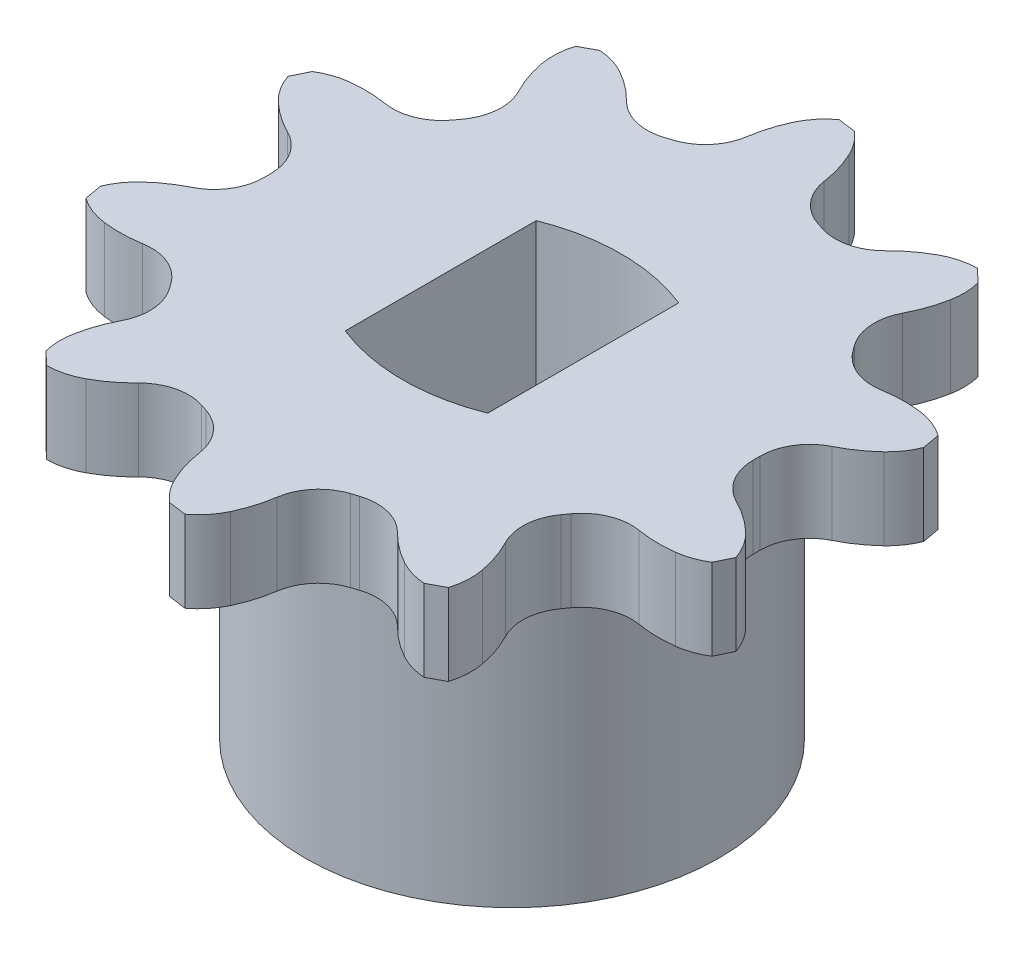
ISO-10303-21;
HEADER;
FILE_DESCRIPTION(('STEP AP214'),'2;1');
FILE_NAME('part.step','',(''),(''),'','','');
FILE_SCHEMA(('AUTOMOTIVE_DESIGN { 1 0 10303 214 1 1 1 1 }'));
ENDSEC;
DATA;
#1=APPLICATION_CONTEXT('core data for automotive mechanical design processes');
#2=APPLICATION_PROTOCOL_DEFINITION('international standard','automotive_design',2000,#1);
#3=PRODUCT_CONTEXT('',#1,'mechanical');
#4=PRODUCT('Part','Part','',(#3));
#5=PRODUCT_RELATED_PRODUCT_CATEGORY('part','',(#4));
#6=PRODUCT_DEFINITION_FORMATION('','',#4);
#7=PRODUCT_DEFINITION_CONTEXT('part definition',#1,'design');
#8=PRODUCT_DEFINITION('design','',#6,#7);
#9=PRODUCT_DEFINITION_SHAPE('','',#8);
#10=(LENGTH_UNIT() NAMED_UNIT(*) SI_UNIT(.MILLI.,.METRE.));
#11=(NAMED_UNIT(*) PLANE_ANGLE_UNIT() SI_UNIT($,.RADIAN.));
#12=(NAMED_UNIT(*) SI_UNIT($,.STERADIAN.) SOLID_ANGLE_UNIT());
#13=UNCERTAINTY_MEASURE_WITH_UNIT(LENGTH_MEASURE(1.E-05),#10,'distance_accuracy_value','');
#14=(GEOMETRIC_REPRESENTATION_CONTEXT(3) GLOBAL_UNCERTAINTY_ASSIGNED_CONTEXT((#13)) GLOBAL_UNIT_ASSIGNED_CONTEXT((#10,
#11,#12)) REPRESENTATION_CONTEXT('',''));
#15=CARTESIAN_POINT('',(0.,0.,0.));
#16=DIRECTION('',(0.,0.,1.));
#17=DIRECTION('',(1.,0.,0.));
#18=AXIS2_PLACEMENT_3D('',#15,#16,#17);
#19=CARTESIAN_POINT('',(-13.46581,19.1516,6.17474));
#20=DIRECTION('',(0.,-1.,0.));
#21=DIRECTION('',(0.,0.,-1.));
#22=AXIS2_PLACEMENT_3D('',#19,#20,#21);
#23=CYLINDRICAL_SURFACE('',#22,3.50611110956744);
#24=CARTESIAN_POINT('',(-13.46581,14.8844,6.17474));
#25=DIRECTION('',(0.,-1.,0.));
#26=DIRECTION('',(0.,0.,-1.));
#27=AXIS2_PLACEMENT_3D('',#24,#25,#26);
#28=CIRCLE('',#27,3.50611110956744);
#29=CARTESIAN_POINT('',(-16.7141329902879,14.8844,4.85518974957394));
#30=VERTEX_POINT('',#29);
#31=CARTESIAN_POINT('',(-15.8685271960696,14.8844,3.62135691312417));
#32=VERTEX_POINT('',#31);
#33=EDGE_CURVE('E592',#30,#32,#28,.T.);
#34=ORIENTED_EDGE('',*,*,#33,.F.);
#35=DIRECTION('',(0.,-1.,0.));
#36=VECTOR('',#35,1.);
#37=CARTESIAN_POINT('',(-16.7141329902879,19.1516,4.85518974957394));
#38=LINE('',#37,#36);
#39=CARTESIAN_POINT('',(-16.7141329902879,19.1516,4.85518974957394));
#40=VERTEX_POINT('',#39);
#41=EDGE_CURVE('E988',#30,#40,#38,.F.);
#42=ORIENTED_EDGE('',*,*,#41,.T.);
#43=CARTESIAN_POINT('',(-13.46581,19.1516,6.17474));
#44=DIRECTION('',(0.,-1.,0.));
#45=DIRECTION('',(0.,0.,-1.));
#46=AXIS2_PLACEMENT_3D('',#43,#44,#45);
#47=CIRCLE('',#46,3.50611110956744);
#48=CARTESIAN_POINT('',(-15.8685271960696,19.1516,3.62135691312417));
#49=VERTEX_POINT('',#48);
#50=EDGE_CURVE('E593',#40,#49,#47,.T.);
#51=ORIENTED_EDGE('',*,*,#50,.T.);
#52=DIRECTION('',(0.,-1.,0.));
#53=VECTOR('',#52,1.);
#54=CARTESIAN_POINT('',(-15.8685271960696,19.1516,3.62135691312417));
#55=LINE('',#54,#53);
#56=EDGE_CURVE('E724',#49,#32,#55,.T.);
#57=ORIENTED_EDGE('',*,*,#56,.T.);
#58=EDGE_LOOP('',(#34,#42,#51,#57));
#59=FACE_BOUND('',#58,.T.);
#60=ADVANCED_FACE('F33',(#59),#23,.T.);
#61=CARTESIAN_POINT('',(-14.5234902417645,19.1516,2.91953493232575));
#62=DIRECTION('',(0.,-1.,0.));
#63=DIRECTION('',(0.,0.,-1.));
#64=AXIS2_PLACEMENT_3D('',#61,#62,#63);
#65=CYLINDRICAL_SURFACE('',#64,3.50611110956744);
#66=CARTESIAN_POINT('',(-14.5234902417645,19.1516,2.91953493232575));
#67=DIRECTION('',(0.,-1.,0.));
#68=DIRECTION('',(0.,0.,-1.));
#69=AXIS2_PLACEMENT_3D('',#66,#67,#68);
#70=CIRCLE('',#69,3.50611110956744);
#71=CARTESIAN_POINT('',(-14.9664883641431,19.1516,6.39754697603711));
#72=VERTEX_POINT('',#71);
#73=CARTESIAN_POINT('',(-16.5471037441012,19.1516,5.78271559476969));
#74=VERTEX_POINT('',#73);
#75=EDGE_CURVE('E721',#72,#74,#70,.T.);
#76=ORIENTED_EDGE('',*,*,#75,.T.);
#77=DIRECTION('',(0.,-1.,0.));
#78=VECTOR('',#77,1.);
#79=CARTESIAN_POINT('',(-16.5471037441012,19.1516,5.78271559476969));
#80=LINE('',#79,#78);
#81=CARTESIAN_POINT('',(-16.5471037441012,14.8844,5.78271559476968));
#82=VERTEX_POINT('',#81);
#83=EDGE_CURVE('E985',#74,#82,#80,.T.);
#84=ORIENTED_EDGE('',*,*,#83,.T.);
#85=CARTESIAN_POINT('',(-14.5234902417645,14.8844,2.91953493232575));
#86=DIRECTION('',(0.,-1.,0.));
#87=DIRECTION('',(0.,0.,-1.));
#88=AXIS2_PLACEMENT_3D('',#85,#86,#87);
#89=CIRCLE('',#88,3.50611110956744);
#90=CARTESIAN_POINT('',(-14.9664883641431,14.8844,6.39754697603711));
#91=VERTEX_POINT('',#90);
#92=EDGE_CURVE('E596',#91,#82,#89,.T.);
#93=ORIENTED_EDGE('',*,*,#92,.F.);
#94=DIRECTION('',(0.,-1.,0.));
#95=VECTOR('',#94,1.);
#96=CARTESIAN_POINT('',(-14.9664883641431,19.1516,6.39754697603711));
#97=LINE('',#96,#95);
#98=EDGE_CURVE('E853',#72,#91,#97,.T.);
#99=ORIENTED_EDGE('',*,*,#98,.F.);
#100=EDGE_LOOP('',(#76,#84,#93,#99));
#101=FACE_BOUND('',#100,.T.);
#102=ADVANCED_FACE('F1328',(#101),#65,.T.);
#103=CARTESIAN_POINT('',(-14.1260910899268,19.1516,-0.200476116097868));
#104=DIRECTION('',(0.,-1.,0.));
#105=DIRECTION('',(0.,0.,-1.));
#106=AXIS2_PLACEMENT_3D('',#103,#104,#105);
#107=CYLINDRICAL_SURFACE('',#106,6.65132891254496);
#108=CARTESIAN_POINT('',(-14.1260910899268,14.8844,-0.200476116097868));
#109=DIRECTION('',(0.,-1.,0.));
#110=DIRECTION('',(0.,0.,-1.));
#111=AXIS2_PLACEMENT_3D('',#108,#109,#110);
#112=CIRCLE('',#111,6.65132891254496);
#113=CARTESIAN_POINT('',(-13.01025521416,14.8844,6.35658775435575));
#114=VERTEX_POINT('',#113);
#115=EDGE_CURVE('E849',#114,#91,#112,.T.);
#116=ORIENTED_EDGE('',*,*,#115,.F.);
#117=DIRECTION('',(0.,-1.,0.));
#118=VECTOR('',#117,1.);
#119=CARTESIAN_POINT('',(-13.01025521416,19.1516,6.35658775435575));
#120=LINE('',#119,#118);
#121=CARTESIAN_POINT('',(-13.01025521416,19.1516,6.35658775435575));
#122=VERTEX_POINT('',#121);
#123=EDGE_CURVE('E1035',#114,#122,#120,.F.);
#124=ORIENTED_EDGE('',*,*,#123,.T.);
#125=CARTESIAN_POINT('',(-14.1260910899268,19.1516,-0.200476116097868));
#126=DIRECTION('',(0.,-1.,0.));
#127=DIRECTION('',(0.,0.,-1.));
#128=AXIS2_PLACEMENT_3D('',#125,#126,#127);
#129=CIRCLE('',#128,6.65132891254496);
#130=EDGE_CURVE('E719',#122,#72,#129,.T.);
#131=ORIENTED_EDGE('',*,*,#130,.T.);
#132=ORIENTED_EDGE('',*,*,#98,.T.);
#133=EDGE_LOOP('',(#116,#124,#131,#132));
#134=FACE_BOUND('',#133,.T.);
#135=ADVANCED_FACE('F1334',(#134),#107,.T.);
#136=CARTESIAN_POINT('',(-9.20378735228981,19.1516,9.14386606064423));
#137=DIRECTION('',(-0.809016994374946,0.,0.587785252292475));
#138=DIRECTION('',(0.587785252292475,0.,0.809016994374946));
#139=AXIS2_PLACEMENT_3D('',#136,#137,#138);
#140=PLANE('',#139);
#141=DIRECTION('',(-0.587785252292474,0.,-0.809016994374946));
#142=VECTOR('',#141,1.);
#143=CARTESIAN_POINT('',(-9.20378735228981,14.8844,9.14386606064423));
#144=LINE('',#143,#142);
#145=CARTESIAN_POINT('',(-10.2646295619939,14.8844,7.6837420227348));
#146=VERTEX_POINT('',#145);
#147=CARTESIAN_POINT('',(-10.4796178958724,14.8844,7.38783596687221));
#148=VERTEX_POINT('',#147);
#149=EDGE_CURVE('E846',#146,#148,#144,.T.);
#150=ORIENTED_EDGE('',*,*,#149,.F.);
#151=DIRECTION('',(0.,1.,0.));
#152=VECTOR('',#151,1.);
#153=CARTESIAN_POINT('',(-10.2646295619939,19.1516,7.6837420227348));
#154=LINE('',#153,#152);
#155=CARTESIAN_POINT('',(-10.2646295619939,19.1516,7.6837420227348));
#156=VERTEX_POINT('',#155);
#157=EDGE_CURVE('E1018',#146,#156,#154,.T.);
#158=ORIENTED_EDGE('',*,*,#157,.T.);
#159=DIRECTION('',(-0.587785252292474,0.,-0.809016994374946));
#160=VECTOR('',#159,1.);
#161=CARTESIAN_POINT('',(-9.20378735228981,19.1516,9.14386606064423));
#162=LINE('',#161,#160);
#163=CARTESIAN_POINT('',(-10.4796178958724,19.1516,7.38783596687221));
#164=VERTEX_POINT('',#163);
#165=EDGE_CURVE('E716',#156,#164,#162,.T.);
#166=ORIENTED_EDGE('',*,*,#165,.T.);
#167=DIRECTION('',(0.,1.,0.));
#168=VECTOR('',#167,1.);
#169=CARTESIAN_POINT('',(-10.4796178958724,14.8844,7.38783596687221));
#170=LINE('',#169,#168);
#171=EDGE_CURVE('E1015',#164,#148,#170,.F.);
#172=ORIENTED_EDGE('',*,*,#171,.T.);
#173=EDGE_LOOP('',(#150,#158,#166,#172));
#174=FACE_BOUND('',#173,.T.);
#175=ADVANCED_FACE('F1343',(#174),#140,.T.);
#176=CARTESIAN_POINT('',(-4.17453809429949,19.1516,13.4966615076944));
#177=DIRECTION('',(0.,-1.,0.));
#178=DIRECTION('',(0.,0.,-1.));
#179=AXIS2_PLACEMENT_3D('',#176,#177,#178);
#180=CYLINDRICAL_SURFACE('',#179,6.65132891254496);
#181=CARTESIAN_POINT('',(-4.17453809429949,19.1516,13.4966615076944));
#182=DIRECTION('',(0.,-1.,0.));
#183=DIRECTION('',(0.,0.,-1.));
#184=AXIS2_PLACEMENT_3D('',#181,#182,#183);
#185=CIRCLE('',#184,6.65132891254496);
#186=CARTESIAN_POINT('',(-10.7093279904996,19.1516,12.2570255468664));
#187=VERTEX_POINT('',#186);
#188=CARTESIAN_POINT('',(-10.0658641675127,19.1516,10.4091943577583));
#189=VERTEX_POINT('',#188);
#190=EDGE_CURVE('E713',#187,#189,#185,.T.);
#191=ORIENTED_EDGE('',*,*,#190,.T.);
#192=DIRECTION('',(0.,-1.,0.));
#193=VECTOR('',#192,1.);
#194=CARTESIAN_POINT('',(-10.0658641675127,19.1516,10.4091943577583));
#195=LINE('',#194,#193);
#196=CARTESIAN_POINT('',(-10.0658641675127,14.8844,10.4091943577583));
#197=VERTEX_POINT('',#196);
#198=EDGE_CURVE('E1012',#189,#197,#195,.T.);
#199=ORIENTED_EDGE('',*,*,#198,.T.);
#200=CARTESIAN_POINT('',(-4.17453809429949,14.8844,13.4966615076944));
#201=DIRECTION('',(0.,-1.,0.));
#202=DIRECTION('',(0.,0.,-1.));
#203=AXIS2_PLACEMENT_3D('',#200,#201,#202);
#204=CIRCLE('',#203,6.65132891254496);
#205=CARTESIAN_POINT('',(-10.7093279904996,14.8844,12.2570255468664));
#206=VERTEX_POINT('',#205);
#207=EDGE_CURVE('E843',#206,#197,#204,.T.);
#208=ORIENTED_EDGE('',*,*,#207,.F.);
#209=DIRECTION('',(0.,-1.,0.));
#210=VECTOR('',#209,1.);
#211=CARTESIAN_POINT('',(-10.7093279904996,19.1516,12.2570255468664));
#212=LINE('',#211,#210);
#213=EDGE_CURVE('E857',#187,#206,#212,.T.);
#214=ORIENTED_EDGE('',*,*,#213,.F.);
#215=EDGE_LOOP('',(#191,#199,#208,#214));
#216=FACE_BOUND('',#215,.T.);
#217=ADVANCED_FACE('F1351',(#216),#180,.T.);
#218=CARTESIAN_POINT('',(-7.26464802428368,19.1516,12.9104741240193));
#219=DIRECTION('',(0.,-1.,0.));
#220=DIRECTION('',(0.,0.,-1.));
#221=AXIS2_PLACEMENT_3D('',#218,#219,#220);
#222=CYLINDRICAL_SURFACE('',#221,3.50611110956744);
#223=CARTESIAN_POINT('',(-7.26464802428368,14.8844,12.9104741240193));
#224=DIRECTION('',(0.,-1.,0.));
#225=DIRECTION('',(0.,0.,-1.));
#226=AXIS2_PLACEMENT_3D('',#223,#224,#225);
#227=CIRCLE('',#226,3.50611110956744);
#228=CARTESIAN_POINT('',(-10.6682087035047,14.8844,13.7522518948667));
#229=VERTEX_POINT('',#228);
#230=EDGE_CURVE('E841',#229,#206,#227,.T.);
#231=ORIENTED_EDGE('',*,*,#230,.F.);
#232=DIRECTION('',(0.,-1.,0.));
#233=VECTOR('',#232,1.);
#234=CARTESIAN_POINT('',(-10.6682087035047,19.1516,13.7522518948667));
#235=LINE('',#234,#233);
#236=CARTESIAN_POINT('',(-10.6682087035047,19.1516,13.7522518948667));
#237=VERTEX_POINT('',#236);
#238=EDGE_CURVE('E978',#229,#237,#235,.F.);
#239=ORIENTED_EDGE('',*,*,#238,.T.);
#240=CARTESIAN_POINT('',(-7.26464802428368,19.1516,12.9104741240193));
#241=DIRECTION('',(0.,-1.,0.));
#242=DIRECTION('',(0.,0.,-1.));
#243=AXIS2_PLACEMENT_3D('',#240,#241,#242);
#244=CIRCLE('',#243,3.50611110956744);
#245=EDGE_CURVE('E711',#237,#187,#244,.T.);
#246=ORIENTED_EDGE('',*,*,#245,.T.);
#247=ORIENTED_EDGE('',*,*,#213,.T.);
#248=EDGE_LOOP('',(#231,#239,#246,#247));
#249=FACE_BOUND('',#248,.T.);
#250=ADVANCED_FACE('F1653',(#249),#222,.T.);
#251=CARTESIAN_POINT('',(-10.0336908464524,19.1516,10.8986467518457));
#252=DIRECTION('',(0.,-1.,0.));
#253=DIRECTION('',(0.,0.,-1.));
#254=AXIS2_PLACEMENT_3D('',#251,#252,#253);
#255=CYLINDRICAL_SURFACE('',#254,3.50611110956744);
#256=CARTESIAN_POINT('',(-10.0336908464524,19.1516,10.8986467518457));
#257=DIRECTION('',(0.,-1.,0.));
#258=DIRECTION('',(0.,0.,-1.));
#259=AXIS2_PLACEMENT_3D('',#256,#257,#258);
#260=CIRCLE('',#259,3.50611110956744);
#261=CARTESIAN_POINT('',(-8.34775966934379,19.1516,13.9728053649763));
#262=VERTEX_POINT('',#261);
#263=CARTESIAN_POINT('',(-9.98789319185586,19.1516,14.404458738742));
#264=VERTEX_POINT('',#263);
#265=EDGE_CURVE('E708',#262,#264,#260,.T.);
#266=ORIENTED_EDGE('',*,*,#265,.T.);
#267=DIRECTION('',(0.,-1.,0.));
#268=VECTOR('',#267,1.);
#269=CARTESIAN_POINT('',(-9.98789319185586,19.1516,14.404458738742));
#270=LINE('',#269,#268);
#271=CARTESIAN_POINT('',(-9.98789319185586,14.8844,14.404458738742));
#272=VERTEX_POINT('',#271);
#273=EDGE_CURVE('E975',#264,#272,#270,.T.);
#274=ORIENTED_EDGE('',*,*,#273,.T.);
#275=CARTESIAN_POINT('',(-10.0336908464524,14.8844,10.8986467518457));
#276=DIRECTION('',(0.,-1.,0.));
#277=DIRECTION('',(0.,0.,-1.));
#278=AXIS2_PLACEMENT_3D('',#275,#276,#277);
#279=CIRCLE('',#278,3.50611110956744);
#280=CARTESIAN_POINT('',(-8.34775966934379,14.8844,13.9728053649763));
#281=VERTEX_POINT('',#280);
#282=EDGE_CURVE('E838',#281,#272,#279,.T.);
#283=ORIENTED_EDGE('',*,*,#282,.F.);
#284=DIRECTION('',(0.,-1.,0.));
#285=VECTOR('',#284,1.);
#286=CARTESIAN_POINT('',(-8.34775966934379,19.1516,13.9728053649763));
#287=LINE('',#286,#285);
#288=EDGE_CURVE('E860',#262,#281,#287,.T.);
#289=ORIENTED_EDGE('',*,*,#288,.F.);
#290=EDGE_LOOP('',(#266,#274,#283,#289));
#291=FACE_BOUND('',#290,.T.);
#292=ADVANCED_FACE('F1364',(#291),#255,.T.);
#293=CARTESIAN_POINT('',(-11.5460846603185,19.1516,8.14091943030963));
#294=DIRECTION('',(0.,-1.,0.));
#295=DIRECTION('',(0.,0.,-1.));
#296=AXIS2_PLACEMENT_3D('',#293,#294,#295);
#297=CYLINDRICAL_SURFACE('',#296,6.65132891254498);
#298=CARTESIAN_POINT('',(-11.5460846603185,14.8844,8.14091943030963));
#299=DIRECTION('',(0.,-1.,0.));
#300=DIRECTION('',(0.,0.,-1.));
#301=AXIS2_PLACEMENT_3D('',#298,#299,#300);
#302=CIRCLE('',#301,6.65132891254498);
#303=CARTESIAN_POINT('',(-6.78920903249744,14.8844,12.789823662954));
#304=VERTEX_POINT('',#303);
#305=EDGE_CURVE('E836',#304,#281,#302,.T.);
#306=ORIENTED_EDGE('',*,*,#305,.F.);
#307=DIRECTION('',(0.,-1.,0.));
#308=VECTOR('',#307,1.);
#309=CARTESIAN_POINT('',(-6.78920903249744,19.1516,12.789823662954));
#310=LINE('',#309,#308);
#311=CARTESIAN_POINT('',(-6.78920903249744,19.1516,12.789823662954));
#312=VERTEX_POINT('',#311);
#313=EDGE_CURVE('E1073',#304,#312,#310,.F.);
#314=ORIENTED_EDGE('',*,*,#313,.T.);
#315=CARTESIAN_POINT('',(-11.5460846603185,19.1516,8.14091943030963));
#316=DIRECTION('',(0.,-1.,0.));
#317=DIRECTION('',(0.,0.,-1.));
#318=AXIS2_PLACEMENT_3D('',#315,#316,#317);
#319=CIRCLE('',#318,6.65132891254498);
#320=EDGE_CURVE('E706',#312,#262,#319,.T.);
#321=ORIENTED_EDGE('',*,*,#320,.T.);
#322=ORIENTED_EDGE('',*,*,#288,.T.);
#323=EDGE_LOOP('',(#306,#314,#321,#322));
#324=FACE_BOUND('',#323,.T.);
#325=ADVANCED_FACE('F1370',(#324),#297,.T.);
#326=CARTESIAN_POINT('',(-2.0713907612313,19.1516,12.8073935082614));
#327=DIRECTION('',(-0.30901699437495,0.,0.951056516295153));
#328=DIRECTION('',(0.951056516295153,0.,0.30901699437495));
#329=AXIS2_PLACEMENT_3D('',#326,#327,#328);
#330=PLANE('',#329);
#331=DIRECTION('',(-0.951056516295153,0.,-0.30901699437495));
#332=VECTOR('',#331,1.);
#333=CARTESIAN_POINT('',(-2.0713907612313,14.8844,12.8073935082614));
#334=LINE('',#333,#332);
#335=CARTESIAN_POINT('',(-3.7878695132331,14.8844,12.2496757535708));
#336=VERTEX_POINT('',#335);
#337=CARTESIAN_POINT('',(-4.13572794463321,14.8844,12.1366496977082));
#338=VERTEX_POINT('',#337);
#339=EDGE_CURVE('E833',#336,#338,#334,.T.);
#340=ORIENTED_EDGE('',*,*,#339,.F.);
#341=DIRECTION('',(0.,1.,0.));
#342=VECTOR('',#341,1.);
#343=CARTESIAN_POINT('',(-3.7878695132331,19.1516,12.2496757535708));
#344=LINE('',#343,#342);
#345=CARTESIAN_POINT('',(-3.7878695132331,19.1516,12.2496757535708));
#346=VERTEX_POINT('',#345);
#347=EDGE_CURVE('E1058',#336,#346,#344,.T.);
#348=ORIENTED_EDGE('',*,*,#347,.T.);
#349=DIRECTION('',(-0.951056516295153,0.,-0.30901699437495));
#350=VECTOR('',#349,1.);
#351=CARTESIAN_POINT('',(-2.0713907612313,19.1516,12.8073935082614));
#352=LINE('',#351,#350);
#353=CARTESIAN_POINT('',(-4.13572794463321,19.1516,12.1366496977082));
#354=VERTEX_POINT('',#353);
#355=EDGE_CURVE('E703',#346,#354,#352,.T.);
#356=ORIENTED_EDGE('',*,*,#355,.T.);
#357=DIRECTION('',(0.,1.,0.));
#358=VECTOR('',#357,1.);
#359=CARTESIAN_POINT('',(-4.13572794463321,14.8844,12.1366496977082));
#360=LINE('',#359,#358);
#361=EDGE_CURVE('E1055',#354,#338,#360,.F.);
#362=ORIENTED_EDGE('',*,*,#361,.T.);
#363=EDGE_LOOP('',(#340,#348,#356,#362));
#364=FACE_BOUND('',#363,.T.);
#365=ADVANCED_FACE('F1379',(#364),#330,.T.);
#366=CARTESIAN_POINT('',(4.55586632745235,19.1516,13.3727604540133));
#367=DIRECTION('',(0.,-1.,0.));
#368=DIRECTION('',(0.,0.,-1.));
#369=AXIS2_PLACEMENT_3D('',#366,#367,#368);
#370=CYLINDRICAL_SURFACE('',#369,6.65132891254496);
#371=CARTESIAN_POINT('',(4.55586632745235,19.1516,13.3727604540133));
#372=DIRECTION('',(0.,-1.,0.));
#373=DIRECTION('',(0.,0.,-1.));
#374=AXIS2_PLACEMENT_3D('',#371,#372,#373);
#375=CIRCLE('',#374,6.65132891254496);
#376=CARTESIAN_POINT('',(-1.45952948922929,19.1516,16.2109270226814));
#377=VERTEX_POINT('',#376);
#378=CARTESIAN_POINT('',(-2.02508424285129,19.1516,14.3377816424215));
#379=VERTEX_POINT('',#378);
#380=EDGE_CURVE('E700',#377,#379,#375,.T.);
#381=ORIENTED_EDGE('',*,*,#380,.T.);
#382=DIRECTION('',(0.,-1.,0.));
#383=VECTOR('',#382,1.);
#384=CARTESIAN_POINT('',(-2.02508424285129,19.1516,14.3377816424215));
#385=LINE('',#384,#383);
#386=CARTESIAN_POINT('',(-2.02508424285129,14.8844,14.3377816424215));
#387=VERTEX_POINT('',#386);
#388=EDGE_CURVE('E1052',#379,#387,#385,.T.);
#389=ORIENTED_EDGE('',*,*,#388,.T.);
#390=CARTESIAN_POINT('',(4.55586632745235,14.8844,13.3727604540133));
#391=DIRECTION('',(0.,-1.,0.));
#392=DIRECTION('',(0.,0.,-1.));
#393=AXIS2_PLACEMENT_3D('',#390,#391,#392);
#394=CIRCLE('',#393,6.65132891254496);
#395=CARTESIAN_POINT('',(-1.45952948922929,14.8844,16.2109270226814));
#396=VERTEX_POINT('',#395);
#397=EDGE_CURVE('E830',#396,#387,#394,.T.);
#398=ORIENTED_EDGE('',*,*,#397,.F.);
#399=DIRECTION('',(0.,-1.,0.));
#400=VECTOR('',#399,1.);
#401=CARTESIAN_POINT('',(-1.45952948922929,19.1516,16.2109270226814));
#402=LINE('',#401,#400);
#403=EDGE_CURVE('E863',#377,#396,#402,.T.);
#404=ORIENTED_EDGE('',*,*,#403,.F.);
#405=EDGE_LOOP('',(#381,#389,#398,#404));
#406=FACE_BOUND('',#405,.T.);
#407=ADVANCED_FACE('F1387',(#406),#370,.T.);
#408=CARTESIAN_POINT('',(1.71136258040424,19.1516,14.7148459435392));
#409=DIRECTION('',(0.,-1.,0.));
#410=DIRECTION('',(0.,0.,-1.));
#411=AXIS2_PLACEMENT_3D('',#408,#409,#410);
#412=CYLINDRICAL_SURFACE('',#411,3.50611110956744);
#413=CARTESIAN_POINT('',(1.71136258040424,14.8844,14.7148459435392));
#414=DIRECTION('',(0.,-1.,0.));
#415=DIRECTION('',(0.,0.,-1.));
#416=AXIS2_PLACEMENT_3D('',#413,#414,#415);
#417=CIRCLE('',#416,3.50611110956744);
#418=CARTESIAN_POINT('',(-0.547391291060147,14.8844,17.3964212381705));
#419=VERTEX_POINT('',#418);
#420=EDGE_CURVE('E828',#419,#396,#417,.T.);
#421=ORIENTED_EDGE('',*,*,#420,.F.);
#422=DIRECTION('',(0.,-1.,0.));
#423=VECTOR('',#422,1.);
#424=CARTESIAN_POINT('',(-0.547391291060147,19.1516,17.3964212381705));
#425=LINE('',#424,#423);
#426=CARTESIAN_POINT('',(-0.547391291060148,19.1516,17.3964212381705));
#427=VERTEX_POINT('',#426);
#428=EDGE_CURVE('E993',#419,#427,#425,.F.);
#429=ORIENTED_EDGE('',*,*,#428,.T.);
#430=CARTESIAN_POINT('',(1.71136258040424,19.1516,14.7148459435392));
#431=DIRECTION('',(0.,-1.,0.));
#432=DIRECTION('',(0.,0.,-1.));
#433=AXIS2_PLACEMENT_3D('',#430,#431,#432);
#434=CIRCLE('',#433,3.50611110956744);
#435=EDGE_CURVE('E698',#427,#377,#434,.T.);
#436=ORIENTED_EDGE('',*,*,#435,.T.);
#437=ORIENTED_EDGE('',*,*,#403,.T.);
#438=EDGE_LOOP('',(#421,#429,#436,#437));
#439=FACE_BOUND('',#438,.T.);
#440=ADVANCED_FACE('F1664',(#439),#412,.T.);
#441=CARTESIAN_POINT('',(-1.71136258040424,19.1516,14.7148459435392));
#442=DIRECTION('',(0.,-1.,0.));
#443=DIRECTION('',(0.,0.,-1.));
#444=AXIS2_PLACEMENT_3D('',#441,#442,#443);
#445=CYLINDRICAL_SURFACE('',#444,3.50611110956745);
#446=CARTESIAN_POINT('',(-1.71136258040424,19.1516,14.7148459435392));
#447=DIRECTION('',(0.,-1.,0.));
#448=DIRECTION('',(0.,0.,-1.));
#449=AXIS2_PLACEMENT_3D('',#446,#447,#448);
#450=CIRCLE('',#449,3.50611110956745);
#451=CARTESIAN_POINT('',(1.45952948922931,19.1516,16.2109270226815));
#452=VERTEX_POINT('',#451);
#453=CARTESIAN_POINT('',(0.386353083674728,19.1516,17.5241882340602));
#454=VERTEX_POINT('',#453);
#455=EDGE_CURVE('E695',#452,#454,#450,.T.);
#456=ORIENTED_EDGE('',*,*,#455,.T.);
#457=DIRECTION('',(0.,-1.,0.));
#458=VECTOR('',#457,1.);
#459=CARTESIAN_POINT('',(0.386353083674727,19.1516,17.5241882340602));
#460=LINE('',#459,#458);
#461=CARTESIAN_POINT('',(0.386353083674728,14.8844,17.5241882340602));
#462=VERTEX_POINT('',#461);
#463=EDGE_CURVE('E990',#454,#462,#460,.T.);
#464=ORIENTED_EDGE('',*,*,#463,.T.);
#465=CARTESIAN_POINT('',(-1.71136258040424,14.8844,14.7148459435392));
#466=DIRECTION('',(0.,-1.,0.));
#467=DIRECTION('',(0.,0.,-1.));
#468=AXIS2_PLACEMENT_3D('',#465,#466,#467);
#469=CIRCLE('',#468,3.50611110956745);
#470=CARTESIAN_POINT('',(1.45952948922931,14.8844,16.2109270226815));
#471=VERTEX_POINT('',#470);
#472=EDGE_CURVE('E825',#471,#462,#469,.T.);
#473=ORIENTED_EDGE('',*,*,#472,.F.);
#474=DIRECTION('',(0.,-1.,0.));
#475=VECTOR('',#474,1.);
#476=CARTESIAN_POINT('',(1.45952948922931,19.1516,16.2109270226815));
#477=LINE('',#476,#475);
#478=EDGE_CURVE('E866',#452,#471,#477,.T.);
#479=ORIENTED_EDGE('',*,*,#478,.F.);
#480=EDGE_LOOP('',(#456,#464,#473,#479));
#481=FACE_BOUND('',#480,.T.);
#482=ADVANCED_FACE('F1400',(#481),#445,.T.);
#483=CARTESIAN_POINT('',(-4.55586632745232,19.1516,13.3727604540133));
#484=DIRECTION('',(0.,-1.,0.));
#485=DIRECTION('',(0.,0.,-1.));
#486=AXIS2_PLACEMENT_3D('',#483,#484,#485);
#487=CYLINDRICAL_SURFACE('',#486,6.65132891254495);
#488=CARTESIAN_POINT('',(-4.55586632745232,14.8844,13.3727604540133));
#489=DIRECTION('',(0.,-1.,0.));
#490=DIRECTION('',(0.,0.,-1.));
#491=AXIS2_PLACEMENT_3D('',#488,#489,#490);
#492=CIRCLE('',#491,6.65132891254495);
#493=CARTESIAN_POINT('',(2.02508424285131,14.8844,14.3377816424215));
#494=VERTEX_POINT('',#493);
#495=EDGE_CURVE('E823',#494,#471,#492,.T.);
#496=ORIENTED_EDGE('',*,*,#495,.F.);
#497=DIRECTION('',(0.,-1.,0.));
#498=VECTOR('',#497,1.);
#499=CARTESIAN_POINT('',(2.02508424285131,19.1516,14.3377816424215));
#500=LINE('',#499,#498);
#501=CARTESIAN_POINT('',(2.02508424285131,19.1516,14.3377816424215));
#502=VERTEX_POINT('',#501);
#503=EDGE_CURVE('E1010',#494,#502,#500,.F.);
#504=ORIENTED_EDGE('',*,*,#503,.T.);
#505=CARTESIAN_POINT('',(-4.55586632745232,19.1516,13.3727604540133));
#506=DIRECTION('',(0.,-1.,0.));
#507=DIRECTION('',(0.,0.,-1.));
#508=AXIS2_PLACEMENT_3D('',#505,#506,#507);
#509=CIRCLE('',#508,6.65132891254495);
#510=EDGE_CURVE('E693',#502,#452,#509,.T.);
#511=ORIENTED_EDGE('',*,*,#510,.T.);
#512=ORIENTED_EDGE('',*,*,#478,.T.);
#513=EDGE_LOOP('',(#496,#504,#511,#512));
#514=FACE_BOUND('',#513,.T.);
#515=ADVANCED_FACE('F1406',(#514),#487,.T.);
#516=CARTESIAN_POINT('',(5.85220669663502,19.1516,11.5789319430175));
#517=DIRECTION('',(0.309016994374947,0.,0.951056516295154));
#518=DIRECTION('',(0.951056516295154,0.,-0.309016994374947));
#519=AXIS2_PLACEMENT_3D('',#516,#517,#518);
#520=PLANE('',#519);
#521=DIRECTION('',(-0.951056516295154,0.,0.309016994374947));
#522=VECTOR('',#521,1.);
#523=CARTESIAN_POINT('',(5.85220669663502,19.1516,11.5789319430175));
#524=LINE('',#523,#522);
#525=CARTESIAN_POINT('',(4.13572794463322,19.1516,12.1366496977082));
#526=VERTEX_POINT('',#525);
#527=CARTESIAN_POINT('',(3.78786951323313,19.1516,12.2496757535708));
#528=VERTEX_POINT('',#527);
#529=EDGE_CURVE('E690',#526,#528,#524,.T.);
#530=ORIENTED_EDGE('',*,*,#529,.T.);
#531=DIRECTION('',(0.,1.,0.));
#532=VECTOR('',#531,1.);
#533=CARTESIAN_POINT('',(3.78786951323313,14.8844,12.2496757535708));
#534=LINE('',#533,#532);
#535=CARTESIAN_POINT('',(3.78786951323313,14.8844,12.2496757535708));
#536=VERTEX_POINT('',#535);
#537=EDGE_CURVE('E1007',#528,#536,#534,.F.);
#538=ORIENTED_EDGE('',*,*,#537,.T.);
#539=DIRECTION('',(-0.951056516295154,0.,0.309016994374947));
#540=VECTOR('',#539,1.);
#541=CARTESIAN_POINT('',(5.85220669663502,14.8844,11.5789319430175));
#542=LINE('',#541,#540);
#543=CARTESIAN_POINT('',(4.13572794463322,14.8844,12.1366496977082));
#544=VERTEX_POINT('',#543);
#545=EDGE_CURVE('E820',#544,#536,#542,.T.);
#546=ORIENTED_EDGE('',*,*,#545,.F.);
#547=DIRECTION('',(0.,1.,0.));
#548=VECTOR('',#547,1.);
#549=CARTESIAN_POINT('',(4.13572794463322,19.1516,12.1366496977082));
#550=LINE('',#549,#548);
#551=EDGE_CURVE('E1005',#544,#526,#550,.T.);
#552=ORIENTED_EDGE('',*,*,#551,.T.);
#553=EDGE_LOOP('',(#530,#538,#546,#552));
#554=FACE_BOUND('',#553,.T.);
#555=ADVANCED_FACE('F1415',(#554),#520,.T.);
#556=CARTESIAN_POINT('',(11.5460846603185,19.1516,8.14091943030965));
#557=DIRECTION('',(0.,-1.,0.));
#558=DIRECTION('',(0.,0.,-1.));
#559=AXIS2_PLACEMENT_3D('',#556,#557,#558);
#560=CYLINDRICAL_SURFACE('',#559,6.65132891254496);
#561=CARTESIAN_POINT('',(11.5460846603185,19.1516,8.14091943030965));
#562=DIRECTION('',(0.,-1.,0.));
#563=DIRECTION('',(0.,0.,-1.));
#564=AXIS2_PLACEMENT_3D('',#561,#562,#563);
#565=CIRCLE('',#564,6.65132891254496);
#566=CARTESIAN_POINT('',(8.34775966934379,19.1516,13.9728053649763));
#567=VERTEX_POINT('',#566);
#568=CARTESIAN_POINT('',(6.78920903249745,19.1516,12.789823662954));
#569=VERTEX_POINT('',#568);
#570=EDGE_CURVE('E687',#567,#569,#565,.T.);
#571=ORIENTED_EDGE('',*,*,#570,.T.);
#572=DIRECTION('',(0.,-1.,0.));
#573=VECTOR('',#572,1.);
#574=CARTESIAN_POINT('',(6.78920903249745,19.1516,12.789823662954));
#575=LINE('',#574,#573);
#576=CARTESIAN_POINT('',(6.78920903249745,14.8844,12.789823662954));
#577=VERTEX_POINT('',#576);
#578=EDGE_CURVE('E1100',#569,#577,#575,.T.);
#579=ORIENTED_EDGE('',*,*,#578,.T.);
#580=CARTESIAN_POINT('',(11.5460846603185,14.8844,8.14091943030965));
#581=DIRECTION('',(0.,-1.,0.));
#582=DIRECTION('',(0.,0.,-1.));
#583=AXIS2_PLACEMENT_3D('',#580,#581,#582);
#584=CIRCLE('',#583,6.65132891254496);
#585=CARTESIAN_POINT('',(8.34775966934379,14.8844,13.9728053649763));
#586=VERTEX_POINT('',#585);
#587=EDGE_CURVE('E817',#586,#577,#584,.T.);
#588=ORIENTED_EDGE('',*,*,#587,.F.);
#589=DIRECTION('',(0.,-1.,0.));
#590=VECTOR('',#589,1.);
#591=CARTESIAN_POINT('',(8.34775966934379,19.1516,13.9728053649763));
#592=LINE('',#591,#590);
#593=EDGE_CURVE('E869',#567,#586,#592,.T.);
#594=ORIENTED_EDGE('',*,*,#593,.F.);
#595=EDGE_LOOP('',(#571,#579,#588,#594));
#596=FACE_BOUND('',#595,.T.);
#597=ADVANCED_FACE('F1423',(#596),#560,.T.);
#598=CARTESIAN_POINT('',(10.0336908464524,19.1516,10.8986467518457));
#599=DIRECTION('',(0.,-1.,0.));
#600=DIRECTION('',(0.,0.,-1.));
#601=AXIS2_PLACEMENT_3D('',#598,#599,#600);
#602=CYLINDRICAL_SURFACE('',#601,3.50611110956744);
#603=CARTESIAN_POINT('',(10.0336908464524,14.8844,10.8986467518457));
#604=DIRECTION('',(0.,-1.,0.));
#605=DIRECTION('',(0.,0.,-1.));
#606=AXIS2_PLACEMENT_3D('',#603,#604,#605);
#607=CIRCLE('',#606,3.50611110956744);
#608=CARTESIAN_POINT('',(9.78251098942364,14.8844,14.3957489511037));
#609=VERTEX_POINT('',#608);
#610=EDGE_CURVE('E815',#609,#586,#607,.T.);
#611=ORIENTED_EDGE('',*,*,#610,.F.);
#612=DIRECTION('',(0.,-1.,0.));
#613=VECTOR('',#612,1.);
#614=CARTESIAN_POINT('',(9.78251098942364,19.1516,14.3957489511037));
#615=LINE('',#614,#613);
#616=CARTESIAN_POINT('',(9.78251098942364,19.1516,14.3957489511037));
#617=VERTEX_POINT('',#616);
#618=EDGE_CURVE('E973',#609,#617,#615,.F.);
#619=ORIENTED_EDGE('',*,*,#618,.T.);
#620=CARTESIAN_POINT('',(10.0336908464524,19.1516,10.8986467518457));
#621=DIRECTION('',(0.,-1.,0.));
#622=DIRECTION('',(0.,0.,-1.));
#623=AXIS2_PLACEMENT_3D('',#620,#621,#622);
#624=CIRCLE('',#623,3.50611110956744);
#625=EDGE_CURVE('E685',#617,#567,#624,.T.);
#626=ORIENTED_EDGE('',*,*,#625,.T.);
#627=ORIENTED_EDGE('',*,*,#593,.T.);
#628=EDGE_LOOP('',(#611,#619,#626,#627));
#629=FACE_BOUND('',#628,.T.);
#630=ADVANCED_FACE('F1675',(#629),#602,.T.);
#631=CARTESIAN_POINT('',(7.26464802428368,19.1516,12.9104741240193));
#632=DIRECTION('',(0.,-1.,0.));
#633=DIRECTION('',(0.,0.,-1.));
#634=AXIS2_PLACEMENT_3D('',#631,#632,#633);
#635=CYLINDRICAL_SURFACE('',#634,3.50611110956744);
#636=CARTESIAN_POINT('',(7.26464802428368,19.1516,12.9104741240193));
#637=DIRECTION('',(0.,-1.,0.));
#638=DIRECTION('',(0.,0.,-1.));
#639=AXIS2_PLACEMENT_3D('',#636,#637,#638);
#640=CIRCLE('',#639,3.50611110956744);
#641=CARTESIAN_POINT('',(10.7093279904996,19.1516,12.2570255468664));
#642=VERTEX_POINT('',#641);
#643=CARTESIAN_POINT('',(10.6130256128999,19.1516,13.9502734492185));
#644=VERTEX_POINT('',#643);
#645=EDGE_CURVE('E682',#642,#644,#640,.T.);
#646=ORIENTED_EDGE('',*,*,#645,.T.);
#647=DIRECTION('',(0.,-1.,0.));
#648=VECTOR('',#647,1.);
#649=CARTESIAN_POINT('',(10.6130256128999,19.1516,13.9502734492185));
#650=LINE('',#649,#648);
#651=CARTESIAN_POINT('',(10.6130256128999,14.8844,13.9502734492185));
#652=VERTEX_POINT('',#651);
#653=EDGE_CURVE('E970',#644,#652,#650,.T.);
#654=ORIENTED_EDGE('',*,*,#653,.T.);
#655=CARTESIAN_POINT('',(7.26464802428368,14.8844,12.9104741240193));
#656=DIRECTION('',(0.,-1.,0.));
#657=DIRECTION('',(0.,0.,-1.));
#658=AXIS2_PLACEMENT_3D('',#655,#656,#657);
#659=CIRCLE('',#658,3.50611110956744);
#660=CARTESIAN_POINT('',(10.7093279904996,14.8844,12.2570255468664));
#661=VERTEX_POINT('',#660);
#662=EDGE_CURVE('E812',#661,#652,#659,.T.);
#663=ORIENTED_EDGE('',*,*,#662,.F.);
#664=DIRECTION('',(0.,-1.,0.));
#665=VECTOR('',#664,1.);
#666=CARTESIAN_POINT('',(10.7093279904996,19.1516,12.2570255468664));
#667=LINE('',#666,#665);
#668=EDGE_CURVE('E872',#642,#661,#667,.T.);
#669=ORIENTED_EDGE('',*,*,#668,.F.);
#670=EDGE_LOOP('',(#646,#654,#663,#669));
#671=FACE_BOUND('',#670,.T.);
#672=ADVANCED_FACE('F1436',(#671),#635,.T.);
#673=CARTESIAN_POINT('',(4.17453809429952,19.1516,13.4966615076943));
#674=DIRECTION('',(0.,-1.,0.));
#675=DIRECTION('',(0.,0.,-1.));
#676=AXIS2_PLACEMENT_3D('',#673,#674,#675);
#677=CYLINDRICAL_SURFACE('',#676,6.65132891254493);
#678=CARTESIAN_POINT('',(4.17453809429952,14.8844,13.4966615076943));
#679=DIRECTION('',(0.,-1.,0.));
#680=DIRECTION('',(0.,0.,-1.));
#681=AXIS2_PLACEMENT_3D('',#678,#679,#680);
#682=CIRCLE('',#681,6.65132891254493);
#683=CARTESIAN_POINT('',(10.0658641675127,14.8844,10.4091943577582));
#684=VERTEX_POINT('',#683);
#685=EDGE_CURVE('E810',#684,#661,#682,.T.);
#686=ORIENTED_EDGE('',*,*,#685,.F.);
#687=DIRECTION('',(0.,-1.,0.));
#688=VECTOR('',#687,1.);
#689=CARTESIAN_POINT('',(10.0658641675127,19.1516,10.4091943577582));
#690=LINE('',#689,#688);
#691=CARTESIAN_POINT('',(10.0658641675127,19.1516,10.4091943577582));
#692=VERTEX_POINT('',#691);
#693=EDGE_CURVE('E1025',#684,#692,#690,.F.);
#694=ORIENTED_EDGE('',*,*,#693,.T.);
#695=CARTESIAN_POINT('',(4.17453809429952,19.1516,13.4966615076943));
#696=DIRECTION('',(0.,-1.,0.));
#697=DIRECTION('',(0.,0.,-1.));
#698=AXIS2_PLACEMENT_3D('',#695,#696,#697);
#699=CIRCLE('',#698,6.65132891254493);
#700=EDGE_CURVE('E680',#692,#642,#699,.T.);
#701=ORIENTED_EDGE('',*,*,#700,.T.);
#702=ORIENTED_EDGE('',*,*,#668,.T.);
#703=EDGE_LOOP('',(#686,#694,#701,#702));
#704=FACE_BOUND('',#703,.T.);
#705=ADVANCED_FACE('F1442',(#704),#677,.T.);
#706=CARTESIAN_POINT('',(11.5404601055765,19.1516,5.9277119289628));
#707=DIRECTION('',(0.809016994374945,0.,0.587785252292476));
#708=DIRECTION('',(0.587785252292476,0.,-0.809016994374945));
#709=AXIS2_PLACEMENT_3D('',#706,#707,#708);
#710=PLANE('',#709);
#711=DIRECTION('',(-0.587785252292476,0.,0.809016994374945));
#712=VECTOR('',#711,1.);
#713=CARTESIAN_POINT('',(11.5404601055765,19.1516,5.9277119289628));
#714=LINE('',#713,#712);
#715=CARTESIAN_POINT('',(10.4796178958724,19.1516,7.38783596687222));
#716=VERTEX_POINT('',#715);
#717=CARTESIAN_POINT('',(10.2646295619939,19.1516,7.68374202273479));
#718=VERTEX_POINT('',#717);
#719=EDGE_CURVE('E677',#716,#718,#714,.T.);
#720=ORIENTED_EDGE('',*,*,#719,.T.);
#721=DIRECTION('',(0.,1.,0.));
#722=VECTOR('',#721,1.);
#723=CARTESIAN_POINT('',(10.2646295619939,14.8844,7.68374202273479));
#724=LINE('',#723,#722);
#725=CARTESIAN_POINT('',(10.2646295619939,14.8844,7.68374202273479));
#726=VERTEX_POINT('',#725);
#727=EDGE_CURVE('E1022',#718,#726,#724,.F.);
#728=ORIENTED_EDGE('',*,*,#727,.T.);
#729=DIRECTION('',(-0.587785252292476,0.,0.809016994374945));
#730=VECTOR('',#729,1.);
#731=CARTESIAN_POINT('',(11.5404601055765,14.8844,5.9277119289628));
#732=LINE('',#731,#730);
#733=CARTESIAN_POINT('',(10.4796178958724,14.8844,7.38783596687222));
#734=VERTEX_POINT('',#733);
#735=EDGE_CURVE('E807',#734,#726,#732,.T.);
#736=ORIENTED_EDGE('',*,*,#735,.F.);
#737=DIRECTION('',(0.,1.,0.));
#738=VECTOR('',#737,1.);
#739=CARTESIAN_POINT('',(10.4796178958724,19.1516,7.38783596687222));
#740=LINE('',#739,#738);
#741=EDGE_CURVE('E1020',#734,#716,#740,.T.);
#742=ORIENTED_EDGE('',*,*,#741,.T.);
#743=EDGE_LOOP('',(#720,#728,#736,#742));
#744=FACE_BOUND('',#743,.T.);
#745=ADVANCED_FACE('F1451',(#744),#710,.T.);
#746=CARTESIAN_POINT('',(14.1260910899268,19.1516,-0.200476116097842));
#747=DIRECTION('',(0.,-1.,0.));
#748=DIRECTION('',(0.,0.,-1.));
#749=AXIS2_PLACEMENT_3D('',#746,#747,#748);
#750=CYLINDRICAL_SURFACE('',#749,6.65132891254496);
#751=CARTESIAN_POINT('',(14.1260910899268,19.1516,-0.200476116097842));
#752=DIRECTION('',(0.,-1.,0.));
#753=DIRECTION('',(0.,0.,-1.));
#754=AXIS2_PLACEMENT_3D('',#751,#752,#753);
#755=CIRCLE('',#754,6.65132891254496);
#756=CARTESIAN_POINT('',(14.9664883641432,19.1516,6.39754697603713));
#757=VERTEX_POINT('',#756);
#758=CARTESIAN_POINT('',(13.01025521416,19.1516,6.35658775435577));
#759=VERTEX_POINT('',#758);
#760=EDGE_CURVE('E674',#757,#759,#755,.T.);
#761=ORIENTED_EDGE('',*,*,#760,.T.);
#762=DIRECTION('',(0.,-1.,0.));
#763=VECTOR('',#762,1.);
#764=CARTESIAN_POINT('',(13.01025521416,19.1516,6.35658775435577));
#765=LINE('',#764,#763);
#766=CARTESIAN_POINT('',(13.01025521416,14.8844,6.35658775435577));
#767=VERTEX_POINT('',#766);
#768=EDGE_CURVE('E1097',#759,#767,#765,.T.);
#769=ORIENTED_EDGE('',*,*,#768,.T.);
#770=CARTESIAN_POINT('',(14.1260910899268,14.8844,-0.200476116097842));
#771=DIRECTION('',(0.,-1.,0.));
#772=DIRECTION('',(0.,0.,-1.));
#773=AXIS2_PLACEMENT_3D('',#770,#771,#772);
#774=CIRCLE('',#773,6.65132891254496);
#775=CARTESIAN_POINT('',(14.9664883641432,14.8844,6.39754697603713));
#776=VERTEX_POINT('',#775);
#777=EDGE_CURVE('E804',#776,#767,#774,.T.);
#778=ORIENTED_EDGE('',*,*,#777,.F.);
#779=DIRECTION('',(0.,-1.,0.));
#780=VECTOR('',#779,1.);
#781=CARTESIAN_POINT('',(14.9664883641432,19.1516,6.39754697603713));
#782=LINE('',#781,#780);
#783=EDGE_CURVE('E875',#757,#776,#782,.T.);
#784=ORIENTED_EDGE('',*,*,#783,.F.);
#785=EDGE_LOOP('',(#761,#769,#778,#784));
#786=FACE_BOUND('',#785,.T.);
#787=ADVANCED_FACE('F1459',(#786),#750,.T.);
#788=CARTESIAN_POINT('',(14.5234902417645,19.1516,2.91953493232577));
#789=DIRECTION('',(0.,-1.,0.));
#790=DIRECTION('',(0.,0.,-1.));
#791=AXIS2_PLACEMENT_3D('',#788,#789,#790);
#792=CYLINDRICAL_SURFACE('',#791,3.50611110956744);
#793=CARTESIAN_POINT('',(14.5234902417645,14.8844,2.91953493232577));
#794=DIRECTION('',(0.,-1.,0.));
#795=DIRECTION('',(0.,0.,-1.));
#796=AXIS2_PLACEMENT_3D('',#793,#794,#795);
#797=CIRCLE('',#796,3.50611110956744);
#798=CARTESIAN_POINT('',(16.375826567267,14.8844,5.89638985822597));
#799=VERTEX_POINT('',#798);
#800=EDGE_CURVE('E802',#799,#776,#797,.T.);
#801=ORIENTED_EDGE('',*,*,#800,.F.);
#802=DIRECTION('',(0.,-1.,0.));
#803=VECTOR('',#802,1.);
#804=CARTESIAN_POINT('',(16.375826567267,19.1516,5.89638985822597));
#805=LINE('',#804,#803);
#806=CARTESIAN_POINT('',(16.375826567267,19.1516,5.89638985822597));
#807=VERTEX_POINT('',#806);
#808=EDGE_CURVE('E968',#799,#807,#805,.F.);
#809=ORIENTED_EDGE('',*,*,#808,.T.);
#810=CARTESIAN_POINT('',(14.5234902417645,19.1516,2.91953493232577));
#811=DIRECTION('',(0.,-1.,0.));
#812=DIRECTION('',(0.,0.,-1.));
#813=AXIS2_PLACEMENT_3D('',#810,#811,#812);
#814=CIRCLE('',#813,3.50611110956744);
#815=EDGE_CURVE('E672',#807,#757,#814,.T.);
#816=ORIENTED_EDGE('',*,*,#815,.T.);
#817=ORIENTED_EDGE('',*,*,#783,.T.);
#818=EDGE_LOOP('',(#801,#809,#816,#817));
#819=FACE_BOUND('',#818,.T.);
#820=ADVANCED_FACE('F1686',(#819),#792,.T.);
#821=CARTESIAN_POINT('',(13.46581,19.1516,6.17474));
#822=DIRECTION('',(0.,-1.,0.));
#823=DIRECTION('',(0.,0.,-1.));
#824=AXIS2_PLACEMENT_3D('',#821,#822,#823);
#825=CYLINDRICAL_SURFACE('',#824,3.50611110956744);
#826=CARTESIAN_POINT('',(13.46581,19.1516,6.17474));
#827=DIRECTION('',(0.,-1.,0.));
#828=DIRECTION('',(0.,0.,-1.));
#829=AXIS2_PLACEMENT_3D('',#826,#827,#828);
#830=CIRCLE('',#829,3.50611110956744);
#831=CARTESIAN_POINT('',(15.8685271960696,19.1516,3.62135691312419));
#832=VERTEX_POINT('',#831);
#833=CARTESIAN_POINT('',(16.7858830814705,19.1516,5.04782835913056));
#834=VERTEX_POINT('',#833);
#835=EDGE_CURVE('E669',#832,#834,#830,.T.);
#836=ORIENTED_EDGE('',*,*,#835,.T.);
#837=DIRECTION('',(0.,-1.,0.));
#838=VECTOR('',#837,1.);
#839=CARTESIAN_POINT('',(16.7858830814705,19.1516,5.04782835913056));
#840=LINE('',#839,#838);
#841=CARTESIAN_POINT('',(16.7858830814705,14.8844,5.04782835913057));
#842=VERTEX_POINT('',#841);
#843=EDGE_CURVE('E965',#834,#842,#840,.T.);
#844=ORIENTED_EDGE('',*,*,#843,.T.);
#845=CARTESIAN_POINT('',(13.46581,14.8844,6.17474));
#846=DIRECTION('',(0.,-1.,0.));
#847=DIRECTION('',(0.,0.,-1.));
#848=AXIS2_PLACEMENT_3D('',#845,#846,#847);
#849=CIRCLE('',#848,3.50611110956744);
#850=CARTESIAN_POINT('',(15.8685271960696,14.8844,3.62135691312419));
#851=VERTEX_POINT('',#850);
#852=EDGE_CURVE('E799',#851,#842,#849,.T.);
#853=ORIENTED_EDGE('',*,*,#852,.F.);
#854=DIRECTION('',(0.,-1.,0.));
#855=VECTOR('',#854,1.);
#856=CARTESIAN_POINT('',(15.8685271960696,19.1516,3.62135691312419));
#857=LINE('',#856,#855);
#858=EDGE_CURVE('E878',#832,#851,#857,.T.);
#859=ORIENTED_EDGE('',*,*,#858,.F.);
#860=EDGE_LOOP('',(#836,#844,#853,#859));
#861=FACE_BOUND('',#860,.T.);
#862=ADVANCED_FACE('F1472',(#861),#825,.T.);
#863=CARTESIAN_POINT('',(11.3104108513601,19.1516,8.46529660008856));
#864=DIRECTION('',(0.,-1.,0.));
#865=DIRECTION('',(0.,0.,-1.));
#866=AXIS2_PLACEMENT_3D('',#863,#864,#865);
#867=CYLINDRICAL_SURFACE('',#866,6.65132891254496);
#868=CARTESIAN_POINT('',(11.3104108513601,14.8844,8.46529660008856));
#869=DIRECTION('',(0.,-1.,0.));
#870=DIRECTION('',(0.,0.,-1.));
#871=AXIS2_PLACEMENT_3D('',#868,#869,#870);
#872=CIRCLE('',#871,6.65132891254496);
#873=CARTESIAN_POINT('',(14.2618261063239,14.8844,2.504648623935));
#874=VERTEX_POINT('',#873);
#875=EDGE_CURVE('E797',#874,#851,#872,.T.);
#876=ORIENTED_EDGE('',*,*,#875,.F.);
#877=DIRECTION('',(0.,-1.,0.));
#878=VECTOR('',#877,1.);
#879=CARTESIAN_POINT('',(14.2618261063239,19.1516,2.504648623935));
#880=LINE('',#879,#878);
#881=CARTESIAN_POINT('',(14.2618261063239,19.1516,2.504648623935));
#882=VERTEX_POINT('',#881);
#883=EDGE_CURVE('E1083',#874,#882,#880,.F.);
#884=ORIENTED_EDGE('',*,*,#883,.T.);
#885=CARTESIAN_POINT('',(11.3104108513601,19.1516,8.46529660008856));
#886=DIRECTION('',(0.,-1.,0.));
#887=DIRECTION('',(0.,0.,-1.));
#888=AXIS2_PLACEMENT_3D('',#885,#886,#887);
#889=CIRCLE('',#888,6.65132891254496);
#890=EDGE_CURVE('E667',#882,#832,#889,.T.);
#891=ORIENTED_EDGE('',*,*,#890,.T.);
#892=ORIENTED_EDGE('',*,*,#858,.T.);
#893=EDGE_LOOP('',(#876,#884,#891,#892));
#894=FACE_BOUND('',#893,.T.);
#895=ADVANCED_FACE('F1478',(#894),#867,.T.);
#896=CARTESIAN_POINT('',(12.82065,19.1516,-1.98769256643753));
#897=DIRECTION('',(1.,0.,0.));
#898=DIRECTION('',(0.,0.,-1.));
#899=AXIS2_PLACEMENT_3D('',#896,#897,#898);
#900=PLANE('',#899);
#901=DIRECTION('',(0.,0.,1.));
#902=VECTOR('',#901,1.);
#903=CARTESIAN_POINT('',(12.82065,14.8844,-1.98769256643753));
#904=LINE('',#903,#902);
#905=CARTESIAN_POINT('',(12.82065,14.8844,-0.182879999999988));
#906=VERTEX_POINT('',#905);
#907=CARTESIAN_POINT('',(12.82065,14.8844,0.182879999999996));
#908=VERTEX_POINT('',#907);
#909=EDGE_CURVE('E794',#906,#908,#904,.T.);
#910=ORIENTED_EDGE('',*,*,#909,.F.);
#911=DIRECTION('',(0.,1.,0.));
#912=VECTOR('',#911,1.);
#913=CARTESIAN_POINT('',(12.82065,19.1516,-0.182879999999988));
#914=LINE('',#913,#912);
#915=CARTESIAN_POINT('',(12.82065,19.1516,-0.182879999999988));
#916=VERTEX_POINT('',#915);
#917=EDGE_CURVE('E1033',#906,#916,#914,.T.);
#918=ORIENTED_EDGE('',*,*,#917,.T.);
#919=DIRECTION('',(0.,0.,1.));
#920=VECTOR('',#919,1.);
#921=CARTESIAN_POINT('',(12.82065,19.1516,-1.98769256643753));
#922=LINE('',#921,#920);
#923=CARTESIAN_POINT('',(12.82065,19.1516,0.182879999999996));
#924=VERTEX_POINT('',#923);
#925=EDGE_CURVE('E664',#916,#924,#922,.T.);
#926=ORIENTED_EDGE('',*,*,#925,.T.);
#927=DIRECTION('',(0.,1.,0.));
#928=VECTOR('',#927,1.);
#929=CARTESIAN_POINT('',(12.82065,14.8844,0.182879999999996));
#930=LINE('',#929,#928);
#931=EDGE_CURVE('E1030',#924,#908,#930,.F.);
#932=ORIENTED_EDGE('',*,*,#931,.T.);
#933=EDGE_LOOP('',(#910,#918,#926,#932));
#934=FACE_BOUND('',#933,.T.);
#935=ADVANCED_FACE('F1487',(#934),#900,.T.);
#936=CARTESIAN_POINT('',(11.3104108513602,19.1516,-8.46529660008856));
#937=DIRECTION('',(0.,-1.,0.));
#938=DIRECTION('',(0.,0.,-1.));
#939=AXIS2_PLACEMENT_3D('',#936,#937,#938);
#940=CYLINDRICAL_SURFACE('',#939,6.65132891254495);
#941=CARTESIAN_POINT('',(11.3104108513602,19.1516,-8.46529660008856));
#942=DIRECTION('',(0.,-1.,0.));
#943=DIRECTION('',(0.,0.,-1.));
#944=AXIS2_PLACEMENT_3D('',#941,#942,#943);
#945=CIRCLE('',#944,6.65132891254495);
#946=CARTESIAN_POINT('',(15.8685271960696,19.1516,-3.62135691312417));
#947=VERTEX_POINT('',#946);
#948=CARTESIAN_POINT('',(14.2618261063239,19.1516,-2.504648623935));
#949=VERTEX_POINT('',#948);
#950=EDGE_CURVE('E661',#947,#949,#945,.T.);
#951=ORIENTED_EDGE('',*,*,#950,.T.);
#952=DIRECTION('',(0.,-1.,0.));
#953=VECTOR('',#952,1.);
#954=CARTESIAN_POINT('',(14.2618261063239,19.1516,-2.504648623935));
#955=LINE('',#954,#953);
#956=CARTESIAN_POINT('',(14.2618261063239,14.8844,-2.504648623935));
#957=VERTEX_POINT('',#956);
#958=EDGE_CURVE('E1027',#949,#957,#955,.T.);
#959=ORIENTED_EDGE('',*,*,#958,.T.);
#960=CARTESIAN_POINT('',(11.3104108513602,14.8844,-8.46529660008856));
#961=DIRECTION('',(0.,-1.,0.));
#962=DIRECTION('',(0.,0.,-1.));
#963=AXIS2_PLACEMENT_3D('',#960,#961,#962);
#964=CIRCLE('',#963,6.65132891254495);
#965=CARTESIAN_POINT('',(15.8685271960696,14.8844,-3.62135691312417));
#966=VERTEX_POINT('',#965);
#967=EDGE_CURVE('E791',#966,#957,#964,.T.);
#968=ORIENTED_EDGE('',*,*,#967,.F.);
#969=DIRECTION('',(0.,-1.,0.));
#970=VECTOR('',#969,1.);
#971=CARTESIAN_POINT('',(15.8685271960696,19.1516,-3.62135691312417));
#972=LINE('',#971,#970);
#973=EDGE_CURVE('E881',#947,#966,#972,.T.);
#974=ORIENTED_EDGE('',*,*,#973,.F.);
#975=EDGE_LOOP('',(#951,#959,#968,#974));
#976=FACE_BOUND('',#975,.T.);
#977=ADVANCED_FACE('F1495',(#976),#940,.T.);
#978=CARTESIAN_POINT('',(13.46581,19.1516,-6.17474));
#979=DIRECTION('',(0.,-1.,0.));
#980=DIRECTION('',(0.,0.,-1.));
#981=AXIS2_PLACEMENT_3D('',#978,#979,#980);
#982=CYLINDRICAL_SURFACE('',#981,3.50611110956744);
#983=CARTESIAN_POINT('',(13.46581,14.8844,-6.17474));
#984=DIRECTION('',(0.,-1.,0.));
#985=DIRECTION('',(0.,0.,-1.));
#986=AXIS2_PLACEMENT_3D('',#983,#984,#985);
#987=CIRCLE('',#986,3.50611110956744);
#988=CARTESIAN_POINT('',(16.7141329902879,14.8844,-4.85518974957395));
#989=VERTEX_POINT('',#988);
#990=EDGE_CURVE('E789',#989,#966,#987,.T.);
#991=ORIENTED_EDGE('',*,*,#990,.F.);
#992=DIRECTION('',(0.,-1.,0.));
#993=VECTOR('',#992,1.);
#994=CARTESIAN_POINT('',(16.7141329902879,19.1516,-4.85518974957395));
#995=LINE('',#994,#993);
#996=CARTESIAN_POINT('',(16.7141329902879,19.1516,-4.85518974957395));
#997=VERTEX_POINT('',#996);
#998=EDGE_CURVE('E1003',#989,#997,#995,.F.);
#999=ORIENTED_EDGE('',*,*,#998,.T.);
#1000=CARTESIAN_POINT('',(13.46581,19.1516,-6.17474));
#1001=DIRECTION('',(0.,-1.,0.));
#1002=DIRECTION('',(0.,0.,-1.));
#1003=AXIS2_PLACEMENT_3D('',#1000,#1001,#1002);
#1004=CIRCLE('',#1003,3.50611110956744);
#1005=EDGE_CURVE('E659',#997,#947,#1004,.T.);
#1006=ORIENTED_EDGE('',*,*,#1005,.T.);
#1007=ORIENTED_EDGE('',*,*,#973,.T.);
#1008=EDGE_LOOP('',(#991,#999,#1006,#1007));
#1009=FACE_BOUND('',#1008,.T.);
#1010=ADVANCED_FACE('F1697',(#1009),#982,.T.);
#1011=CARTESIAN_POINT('',(14.5234902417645,19.1516,-2.91953493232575));
#1012=DIRECTION('',(0.,-1.,0.));
#1013=DIRECTION('',(0.,0.,-1.));
#1014=AXIS2_PLACEMENT_3D('',#1011,#1012,#1013);
#1015=CYLINDRICAL_SURFACE('',#1014,3.50611110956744);
#1016=CARTESIAN_POINT('',(14.5234902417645,19.1516,-2.91953493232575));
#1017=DIRECTION('',(0.,-1.,0.));
#1018=DIRECTION('',(0.,0.,-1.));
#1019=AXIS2_PLACEMENT_3D('',#1016,#1017,#1018);
#1020=CIRCLE('',#1019,3.50611110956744);
#1021=CARTESIAN_POINT('',(14.9664883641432,19.1516,-6.3975469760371));
#1022=VERTEX_POINT('',#1021);
#1023=CARTESIAN_POINT('',(16.5471037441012,19.1516,-5.7827155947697));
#1024=VERTEX_POINT('',#1023);
#1025=EDGE_CURVE('E656',#1022,#1024,#1020,.T.);
#1026=ORIENTED_EDGE('',*,*,#1025,.T.);
#1027=DIRECTION('',(0.,-1.,0.));
#1028=VECTOR('',#1027,1.);
#1029=CARTESIAN_POINT('',(16.5471037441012,19.1516,-5.7827155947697));
#1030=LINE('',#1029,#1028);
#1031=CARTESIAN_POINT('',(16.5471037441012,14.8844,-5.7827155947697));
#1032=VERTEX_POINT('',#1031);
#1033=EDGE_CURVE('E1000',#1024,#1032,#1030,.T.);
#1034=ORIENTED_EDGE('',*,*,#1033,.T.);
#1035=CARTESIAN_POINT('',(14.5234902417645,14.8844,-2.91953493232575));
#1036=DIRECTION('',(0.,-1.,0.));
#1037=DIRECTION('',(0.,0.,-1.));
#1038=AXIS2_PLACEMENT_3D('',#1035,#1036,#1037);
#1039=CIRCLE('',#1038,3.50611110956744);
#1040=CARTESIAN_POINT('',(14.9664883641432,14.8844,-6.3975469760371));
#1041=VERTEX_POINT('',#1040);
#1042=EDGE_CURVE('E786',#1041,#1032,#1039,.T.);
#1043=ORIENTED_EDGE('',*,*,#1042,.F.);
#1044=DIRECTION('',(0.,-1.,0.));
#1045=VECTOR('',#1044,1.);
#1046=CARTESIAN_POINT('',(14.9664883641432,19.1516,-6.3975469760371));
#1047=LINE('',#1046,#1045);
#1048=EDGE_CURVE('E884',#1022,#1041,#1047,.T.);
#1049=ORIENTED_EDGE('',*,*,#1048,.F.);
#1050=EDGE_LOOP('',(#1026,#1034,#1043,#1049));
#1051=FACE_BOUND('',#1050,.T.);
#1052=ADVANCED_FACE('F1508',(#1051),#1015,.T.);
#1053=CARTESIAN_POINT('',(14.1260910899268,19.1516,0.200476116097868));
#1054=DIRECTION('',(0.,-1.,0.));
#1055=DIRECTION('',(0.,0.,-1.));
#1056=AXIS2_PLACEMENT_3D('',#1053,#1054,#1055);
#1057=CYLINDRICAL_SURFACE('',#1056,6.65132891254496);
#1058=CARTESIAN_POINT('',(14.1260910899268,14.8844,0.200476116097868));
#1059=DIRECTION('',(0.,-1.,0.));
#1060=DIRECTION('',(0.,0.,-1.));
#1061=AXIS2_PLACEMENT_3D('',#1058,#1059,#1060);
#1062=CIRCLE('',#1061,6.65132891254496);
#1063=CARTESIAN_POINT('',(13.01025521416,14.8844,-6.35658775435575));
#1064=VERTEX_POINT('',#1063);
#1065=EDGE_CURVE('E784',#1064,#1041,#1062,.T.);
#1066=ORIENTED_EDGE('',*,*,#1065,.F.);
#1067=DIRECTION('',(0.,-1.,0.));
#1068=VECTOR('',#1067,1.);
#1069=CARTESIAN_POINT('',(13.01025521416,19.1516,-6.35658775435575));
#1070=LINE('',#1069,#1068);
#1071=CARTESIAN_POINT('',(13.01025521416,19.1516,-6.35658775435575));
#1072=VERTEX_POINT('',#1071);
#1073=EDGE_CURVE('E1093',#1064,#1072,#1070,.F.);
#1074=ORIENTED_EDGE('',*,*,#1073,.T.);
#1075=CARTESIAN_POINT('',(14.1260910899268,19.1516,0.200476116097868));
#1076=DIRECTION('',(0.,-1.,0.));
#1077=DIRECTION('',(0.,0.,-1.));
#1078=AXIS2_PLACEMENT_3D('',#1075,#1076,#1077);
#1079=CIRCLE('',#1078,6.65132891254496);
#1080=EDGE_CURVE('E654',#1072,#1022,#1079,.T.);
#1081=ORIENTED_EDGE('',*,*,#1080,.T.);
#1082=ORIENTED_EDGE('',*,*,#1048,.T.);
#1083=EDGE_LOOP('',(#1066,#1074,#1081,#1082));
#1084=FACE_BOUND('',#1083,.T.);
#1085=ADVANCED_FACE('F1514',(#1084),#1057,.T.);
#1086=CARTESIAN_POINT('',(9.20378735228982,19.1516,-9.14386606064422));
#1087=DIRECTION('',(0.809016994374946,0.,-0.587785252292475));
#1088=DIRECTION('',(-0.587785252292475,0.,-0.809016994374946));
#1089=AXIS2_PLACEMENT_3D('',#1086,#1087,#1088);
#1090=PLANE('',#1089);
#1091=DIRECTION('',(0.587785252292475,0.,0.809016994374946));
#1092=VECTOR('',#1091,1.);
#1093=CARTESIAN_POINT('',(9.20378735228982,14.8844,-9.14386606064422));
#1094=LINE('',#1093,#1092);
#1095=CARTESIAN_POINT('',(10.2646295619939,14.8844,-7.68374202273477));
#1096=VERTEX_POINT('',#1095);
#1097=CARTESIAN_POINT('',(10.4796178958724,14.8844,-7.38783596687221));
#1098=VERTEX_POINT('',#1097);
#1099=EDGE_CURVE('E781',#1096,#1098,#1094,.T.);
#1100=ORIENTED_EDGE('',*,*,#1099,.F.);
#1101=DIRECTION('',(0.,1.,0.));
#1102=VECTOR('',#1101,1.);
#1103=CARTESIAN_POINT('',(10.2646295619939,19.1516,-7.68374202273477));
#1104=LINE('',#1103,#1102);
#1105=CARTESIAN_POINT('',(10.2646295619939,19.1516,-7.68374202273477));
#1106=VERTEX_POINT('',#1105);
#1107=EDGE_CURVE('E1091',#1096,#1106,#1104,.T.);
#1108=ORIENTED_EDGE('',*,*,#1107,.T.);
#1109=DIRECTION('',(0.587785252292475,0.,0.809016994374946));
#1110=VECTOR('',#1109,1.);
#1111=CARTESIAN_POINT('',(9.20378735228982,19.1516,-9.14386606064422));
#1112=LINE('',#1111,#1110);
#1113=CARTESIAN_POINT('',(10.4796178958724,19.1516,-7.38783596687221));
#1114=VERTEX_POINT('',#1113);
#1115=EDGE_CURVE('E651',#1106,#1114,#1112,.T.);
#1116=ORIENTED_EDGE('',*,*,#1115,.T.);
#1117=DIRECTION('',(0.,1.,0.));
#1118=VECTOR('',#1117,1.);
#1119=CARTESIAN_POINT('',(10.4796178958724,14.8844,-7.38783596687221));
#1120=LINE('',#1119,#1118);
#1121=EDGE_CURVE('E1088',#1114,#1098,#1120,.F.);
#1122=ORIENTED_EDGE('',*,*,#1121,.T.);
#1123=EDGE_LOOP('',(#1100,#1108,#1116,#1122));
#1124=FACE_BOUND('',#1123,.T.);
#1125=ADVANCED_FACE('F1523',(#1124),#1090,.T.);
#1126=CARTESIAN_POINT('',(4.17453809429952,19.1516,-13.4966615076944));
#1127=DIRECTION('',(0.,-1.,0.));
#1128=DIRECTION('',(0.,0.,-1.));
#1129=AXIS2_PLACEMENT_3D('',#1126,#1127,#1128);
#1130=CYLINDRICAL_SURFACE('',#1129,6.65132891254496);
#1131=CARTESIAN_POINT('',(4.17453809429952,19.1516,-13.4966615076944));
#1132=DIRECTION('',(0.,-1.,0.));
#1133=DIRECTION('',(0.,0.,-1.));
#1134=AXIS2_PLACEMENT_3D('',#1131,#1132,#1133);
#1135=CIRCLE('',#1134,6.65132891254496);
#1136=CARTESIAN_POINT('',(10.7093279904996,19.1516,-12.2570255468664));
#1137=VERTEX_POINT('',#1136);
#1138=CARTESIAN_POINT('',(10.0658641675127,19.1516,-10.4091943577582));
#1139=VERTEX_POINT('',#1138);
#1140=EDGE_CURVE('E648',#1137,#1139,#1135,.T.);
#1141=ORIENTED_EDGE('',*,*,#1140,.T.);
#1142=DIRECTION('',(0.,-1.,0.));
#1143=VECTOR('',#1142,1.);
#1144=CARTESIAN_POINT('',(10.0658641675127,19.1516,-10.4091943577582));
#1145=LINE('',#1144,#1143);
#1146=CARTESIAN_POINT('',(10.0658641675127,14.8844,-10.4091943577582));
#1147=VERTEX_POINT('',#1146);
#1148=EDGE_CURVE('E1085',#1139,#1147,#1145,.T.);
#1149=ORIENTED_EDGE('',*,*,#1148,.T.);
#1150=CARTESIAN_POINT('',(4.17453809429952,14.8844,-13.4966615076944));
#1151=DIRECTION('',(0.,-1.,0.));
#1152=DIRECTION('',(0.,0.,-1.));
#1153=AXIS2_PLACEMENT_3D('',#1150,#1151,#1152);
#1154=CIRCLE('',#1153,6.65132891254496);
#1155=CARTESIAN_POINT('',(10.7093279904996,14.8844,-12.2570255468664));
#1156=VERTEX_POINT('',#1155);
#1157=EDGE_CURVE('E778',#1156,#1147,#1154,.T.);
#1158=ORIENTED_EDGE('',*,*,#1157,.F.);
#1159=DIRECTION('',(0.,-1.,0.));
#1160=VECTOR('',#1159,1.);
#1161=CARTESIAN_POINT('',(10.7093279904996,19.1516,-12.2570255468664));
#1162=LINE('',#1161,#1160);
#1163=EDGE_CURVE('E887',#1137,#1156,#1162,.T.);
#1164=ORIENTED_EDGE('',*,*,#1163,.F.);
#1165=EDGE_LOOP('',(#1141,#1149,#1158,#1164));
#1166=FACE_BOUND('',#1165,.T.);
#1167=ADVANCED_FACE('F1531',(#1166),#1130,.T.);
#1168=CARTESIAN_POINT('',(7.26464802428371,19.1516,-12.9104741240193));
#1169=DIRECTION('',(0.,-1.,0.));
#1170=DIRECTION('',(0.,0.,-1.));
#1171=AXIS2_PLACEMENT_3D('',#1168,#1169,#1170);
#1172=CYLINDRICAL_SURFACE('',#1171,3.50611110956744);
#1173=CARTESIAN_POINT('',(7.26464802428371,14.8844,-12.9104741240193));
#1174=DIRECTION('',(0.,-1.,0.));
#1175=DIRECTION('',(0.,0.,-1.));
#1176=AXIS2_PLACEMENT_3D('',#1173,#1174,#1175);
#1177=CIRCLE('',#1176,3.50611110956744);
#1178=CARTESIAN_POINT('',(10.6682087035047,14.8844,-13.7522518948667));
#1179=VERTEX_POINT('',#1178);
#1180=EDGE_CURVE('E776',#1179,#1156,#1177,.T.);
#1181=ORIENTED_EDGE('',*,*,#1180,.F.);
#1182=DIRECTION('',(0.,-1.,0.));
#1183=VECTOR('',#1182,1.);
#1184=CARTESIAN_POINT('',(10.6682087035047,19.1516,-13.7522518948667));
#1185=LINE('',#1184,#1183);
#1186=CARTESIAN_POINT('',(10.6682087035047,19.1516,-13.7522518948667));
#1187=VERTEX_POINT('',#1186);
#1188=EDGE_CURVE('E998',#1179,#1187,#1185,.F.);
#1189=ORIENTED_EDGE('',*,*,#1188,.T.);
#1190=CARTESIAN_POINT('',(7.26464802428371,19.1516,-12.9104741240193));
#1191=DIRECTION('',(0.,-1.,0.));
#1192=DIRECTION('',(0.,0.,-1.));
#1193=AXIS2_PLACEMENT_3D('',#1190,#1191,#1192);
#1194=CIRCLE('',#1193,3.50611110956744);
#1195=EDGE_CURVE('E646',#1187,#1137,#1194,.T.);
#1196=ORIENTED_EDGE('',*,*,#1195,.T.);
#1197=ORIENTED_EDGE('',*,*,#1163,.T.);
#1198=EDGE_LOOP('',(#1181,#1189,#1196,#1197));
#1199=FACE_BOUND('',#1198,.T.);
#1200=ADVANCED_FACE('F1544',(#1199),#1172,.T.);
#1201=CARTESIAN_POINT('',(10.0336908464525,19.1516,-10.8986467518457));
#1202=DIRECTION('',(0.,-1.,0.));
#1203=DIRECTION('',(0.,0.,-1.));
#1204=AXIS2_PLACEMENT_3D('',#1201,#1202,#1203);
#1205=CYLINDRICAL_SURFACE('',#1204,3.50611110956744);
#1206=CARTESIAN_POINT('',(10.0336908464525,19.1516,-10.8986467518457));
#1207=DIRECTION('',(0.,-1.,0.));
#1208=DIRECTION('',(0.,0.,-1.));
#1209=AXIS2_PLACEMENT_3D('',#1206,#1207,#1208);
#1210=CIRCLE('',#1209,3.50611110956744);
#1211=CARTESIAN_POINT('',(8.34775966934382,19.1516,-13.9728053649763));
#1212=VERTEX_POINT('',#1211);
#1213=CARTESIAN_POINT('',(9.98789319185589,19.1516,-14.404458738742));
#1214=VERTEX_POINT('',#1213);
#1215=EDGE_CURVE('E643',#1212,#1214,#1210,.T.);
#1216=ORIENTED_EDGE('',*,*,#1215,.T.);
#1217=DIRECTION('',(0.,-1.,0.));
#1218=VECTOR('',#1217,1.);
#1219=CARTESIAN_POINT('',(9.98789319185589,19.1516,-14.404458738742));
#1220=LINE('',#1219,#1218);
#1221=CARTESIAN_POINT('',(9.98789319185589,14.8844,-14.404458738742));
#1222=VERTEX_POINT('',#1221);
#1223=EDGE_CURVE('E995',#1214,#1222,#1220,.T.);
#1224=ORIENTED_EDGE('',*,*,#1223,.T.);
#1225=CARTESIAN_POINT('',(10.0336908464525,14.8844,-10.8986467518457));
#1226=DIRECTION('',(0.,-1.,0.));
#1227=DIRECTION('',(0.,0.,-1.));
#1228=AXIS2_PLACEMENT_3D('',#1225,#1226,#1227);
#1229=CIRCLE('',#1228,3.50611110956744);
#1230=CARTESIAN_POINT('',(8.34775966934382,14.8844,-13.9728053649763));
#1231=VERTEX_POINT('',#1230);
#1232=EDGE_CURVE('E773',#1231,#1222,#1229,.T.);
#1233=ORIENTED_EDGE('',*,*,#1232,.F.);
#1234=DIRECTION('',(0.,-1.,0.));
#1235=VECTOR('',#1234,1.);
#1236=CARTESIAN_POINT('',(8.34775966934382,19.1516,-13.9728053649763));
#1237=LINE('',#1236,#1235);
#1238=EDGE_CURVE('E890',#1212,#1231,#1237,.T.);
#1239=ORIENTED_EDGE('',*,*,#1238,.F.);
#1240=EDGE_LOOP('',(#1216,#1224,#1233,#1239));
#1241=FACE_BOUND('',#1240,.T.);
#1242=ADVANCED_FACE('F1542',(#1241),#1205,.T.);
#1243=CARTESIAN_POINT('',(11.5460846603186,19.1516,-8.14091943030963));
#1244=DIRECTION('',(0.,-1.,0.));
#1245=DIRECTION('',(0.,0.,-1.));
#1246=AXIS2_PLACEMENT_3D('',#1243,#1244,#1245);
#1247=CYLINDRICAL_SURFACE('',#1246,6.65132891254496);
#1248=CARTESIAN_POINT('',(11.5460846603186,14.8844,-8.14091943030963));
#1249=DIRECTION('',(0.,-1.,0.));
#1250=DIRECTION('',(0.,0.,-1.));
#1251=AXIS2_PLACEMENT_3D('',#1248,#1249,#1250);
#1252=CIRCLE('',#1251,6.65132891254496);
#1253=CARTESIAN_POINT('',(6.78920903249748,14.8844,-12.789823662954));
#1254=VERTEX_POINT('',#1253);
#1255=EDGE_CURVE('E771',#1254,#1231,#1252,.T.);
#1256=ORIENTED_EDGE('',*,*,#1255,.F.);
#1257=DIRECTION('',(0.,-1.,0.));
#1258=VECTOR('',#1257,1.);
#1259=CARTESIAN_POINT('',(6.78920903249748,19.1516,-12.789823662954));
#1260=LINE('',#1259,#1258);
#1261=CARTESIAN_POINT('',(6.78920903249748,19.1516,-12.789823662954));
#1262=VERTEX_POINT('',#1261);
#1263=EDGE_CURVE('E1103',#1254,#1262,#1260,.F.);
#1264=ORIENTED_EDGE('',*,*,#1263,.T.);
#1265=CARTESIAN_POINT('',(11.5460846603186,19.1516,-8.14091943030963));
#1266=DIRECTION('',(0.,-1.,0.));
#1267=DIRECTION('',(0.,0.,-1.));
#1268=AXIS2_PLACEMENT_3D('',#1265,#1266,#1267);
#1269=CIRCLE('',#1268,6.65132891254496);
#1270=EDGE_CURVE('E641',#1262,#1212,#1269,.T.);
#1271=ORIENTED_EDGE('',*,*,#1270,.T.);
#1272=ORIENTED_EDGE('',*,*,#1238,.T.);
#1273=EDGE_LOOP('',(#1256,#1264,#1271,#1272));
#1274=FACE_BOUND('',#1273,.T.);
#1275=ADVANCED_FACE('F1188',(#1274),#1247,.T.);
#1276=CARTESIAN_POINT('',(2.0713907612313,19.1516,-12.8073935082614));
#1277=DIRECTION('',(0.309016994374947,0.,-0.951056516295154));
#1278=DIRECTION('',(-0.951056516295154,0.,-0.309016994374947));
#1279=AXIS2_PLACEMENT_3D('',#1276,#1277,#1278);
#1280=PLANE('',#1279);
#1281=DIRECTION('',(0.951056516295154,0.,0.309016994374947));
#1282=VECTOR('',#1281,1.);
#1283=CARTESIAN_POINT('',(2.0713907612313,14.8844,-12.8073935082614));
#1284=LINE('',#1283,#1282);
#1285=CARTESIAN_POINT('',(3.78786951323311,14.8844,-12.2496757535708));
#1286=VERTEX_POINT('',#1285);
#1287=CARTESIAN_POINT('',(4.13572794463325,14.8844,-12.1366496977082));
#1288=VERTEX_POINT('',#1287);
#1289=EDGE_CURVE('E768',#1286,#1288,#1284,.T.);
#1290=ORIENTED_EDGE('',*,*,#1289,.F.);
#1291=DIRECTION('',(0.,1.,0.));
#1292=VECTOR('',#1291,1.);
#1293=CARTESIAN_POINT('',(3.78786951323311,19.1516,-12.2496757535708));
#1294=LINE('',#1293,#1292);
#1295=CARTESIAN_POINT('',(3.78786951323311,19.1516,-12.2496757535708));
#1296=VERTEX_POINT('',#1295);
#1297=EDGE_CURVE('E1081',#1286,#1296,#1294,.T.);
#1298=ORIENTED_EDGE('',*,*,#1297,.T.);
#1299=DIRECTION('',(0.951056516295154,0.,0.309016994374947));
#1300=VECTOR('',#1299,1.);
#1301=CARTESIAN_POINT('',(2.0713907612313,19.1516,-12.8073935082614));
#1302=LINE('',#1301,#1300);
#1303=CARTESIAN_POINT('',(4.13572794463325,19.1516,-12.1366496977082));
#1304=VERTEX_POINT('',#1303);
#1305=EDGE_CURVE('E638',#1296,#1304,#1302,.T.);
#1306=ORIENTED_EDGE('',*,*,#1305,.T.);
#1307=DIRECTION('',(0.,1.,0.));
#1308=VECTOR('',#1307,1.);
#1309=CARTESIAN_POINT('',(4.13572794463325,14.8844,-12.1366496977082));
#1310=LINE('',#1309,#1308);
#1311=EDGE_CURVE('E1078',#1304,#1288,#1310,.F.);
#1312=ORIENTED_EDGE('',*,*,#1311,.T.);
#1313=EDGE_LOOP('',(#1290,#1298,#1306,#1312));
#1314=FACE_BOUND('',#1313,.T.);
#1315=ADVANCED_FACE('F1200',(#1314),#1280,.T.);
#1316=CARTESIAN_POINT('',(-4.55586632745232,19.1516,-13.3727604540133));
#1317=DIRECTION('',(0.,-1.,0.));
#1318=DIRECTION('',(0.,0.,-1.));
#1319=AXIS2_PLACEMENT_3D('',#1316,#1317,#1318);
#1320=CYLINDRICAL_SURFACE('',#1319,6.65132891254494);
#1321=CARTESIAN_POINT('',(-4.55586632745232,19.1516,-13.3727604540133));
#1322=DIRECTION('',(0.,-1.,0.));
#1323=DIRECTION('',(0.,0.,-1.));
#1324=AXIS2_PLACEMENT_3D('',#1321,#1322,#1323);
#1325=CIRCLE('',#1324,6.65132891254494);
#1326=CARTESIAN_POINT('',(1.45952948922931,19.1516,-16.2109270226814));
#1327=VERTEX_POINT('',#1326);
#1328=CARTESIAN_POINT('',(2.0250842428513,19.1516,-14.3377816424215));
#1329=VERTEX_POINT('',#1328);
#1330=EDGE_CURVE('E635',#1327,#1329,#1325,.T.);
#1331=ORIENTED_EDGE('',*,*,#1330,.T.);
#1332=DIRECTION('',(0.,-1.,0.));
#1333=VECTOR('',#1332,1.);
#1334=CARTESIAN_POINT('',(2.0250842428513,19.1516,-14.3377816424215));
#1335=LINE('',#1334,#1333);
#1336=CARTESIAN_POINT('',(2.0250842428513,14.8844,-14.3377816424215));
#1337=VERTEX_POINT('',#1336);
#1338=EDGE_CURVE('E1075',#1329,#1337,#1335,.T.);
#1339=ORIENTED_EDGE('',*,*,#1338,.T.);
#1340=CARTESIAN_POINT('',(-4.55586632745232,14.8844,-13.3727604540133));
#1341=DIRECTION('',(0.,-1.,0.));
#1342=DIRECTION('',(0.,0.,-1.));
#1343=AXIS2_PLACEMENT_3D('',#1340,#1341,#1342);
#1344=CIRCLE('',#1343,6.65132891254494);
#1345=CARTESIAN_POINT('',(1.45952948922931,14.8844,-16.2109270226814));
#1346=VERTEX_POINT('',#1345);
#1347=EDGE_CURVE('E765',#1346,#1337,#1344,.T.);
#1348=ORIENTED_EDGE('',*,*,#1347,.F.);
#1349=DIRECTION('',(0.,-1.,0.));
#1350=VECTOR('',#1349,1.);
#1351=CARTESIAN_POINT('',(1.45952948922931,19.1516,-16.2109270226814));
#1352=LINE('',#1351,#1350);
#1353=EDGE_CURVE('E893',#1327,#1346,#1352,.T.);
#1354=ORIENTED_EDGE('',*,*,#1353,.F.);
#1355=EDGE_LOOP('',(#1331,#1339,#1348,#1354));
#1356=FACE_BOUND('',#1355,.T.);
#1357=ADVANCED_FACE('F1209',(#1356),#1320,.T.);
#1358=CARTESIAN_POINT('',(-1.71136258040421,19.1516,-14.7148459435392));
#1359=DIRECTION('',(0.,-1.,0.));
#1360=DIRECTION('',(0.,0.,-1.));
#1361=AXIS2_PLACEMENT_3D('',#1358,#1359,#1360);
#1362=CYLINDRICAL_SURFACE('',#1361,3.50611110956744);
#1363=CARTESIAN_POINT('',(-1.71136258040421,14.8844,-14.7148459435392));
#1364=DIRECTION('',(0.,-1.,0.));
#1365=DIRECTION('',(0.,0.,-1.));
#1366=AXIS2_PLACEMENT_3D('',#1363,#1364,#1365);
#1367=CIRCLE('',#1366,3.50611110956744);
#1368=CARTESIAN_POINT('',(0.547391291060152,14.8844,-17.3964212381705));
#1369=VERTEX_POINT('',#1368);
#1370=EDGE_CURVE('E763',#1369,#1346,#1367,.T.);
#1371=ORIENTED_EDGE('',*,*,#1370,.F.);
#1372=DIRECTION('',(0.,-1.,0.));
#1373=VECTOR('',#1372,1.);
#1374=CARTESIAN_POINT('',(0.547391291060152,19.1516,-17.3964212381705));
#1375=LINE('',#1374,#1373);
#1376=CARTESIAN_POINT('',(0.547391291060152,19.1516,-17.3964212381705));
#1377=VERTEX_POINT('',#1376);
#1378=EDGE_CURVE('E983',#1369,#1377,#1375,.F.);
#1379=ORIENTED_EDGE('',*,*,#1378,.T.);
#1380=CARTESIAN_POINT('',(-1.71136258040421,19.1516,-14.7148459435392));
#1381=DIRECTION('',(0.,-1.,0.));
#1382=DIRECTION('',(0.,0.,-1.));
#1383=AXIS2_PLACEMENT_3D('',#1380,#1381,#1382);
#1384=CIRCLE('',#1383,3.50611110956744);
#1385=EDGE_CURVE('E633',#1377,#1327,#1384,.T.);
#1386=ORIENTED_EDGE('',*,*,#1385,.T.);
#1387=ORIENTED_EDGE('',*,*,#1353,.T.);
#1388=EDGE_LOOP('',(#1371,#1379,#1386,#1387));
#1389=FACE_BOUND('',#1388,.T.);
#1390=ADVANCED_FACE('F1213',(#1389),#1362,.T.);
#1391=CARTESIAN_POINT('',(1.71136258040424,19.1516,-14.7148459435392));
#1392=DIRECTION('',(0.,-1.,0.));
#1393=DIRECTION('',(0.,0.,-1.));
#1394=AXIS2_PLACEMENT_3D('',#1391,#1392,#1393);
#1395=CYLINDRICAL_SURFACE('',#1394,3.50611110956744);
#1396=CARTESIAN_POINT('',(1.71136258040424,19.1516,-14.7148459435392));
#1397=DIRECTION('',(0.,-1.,0.));
#1398=DIRECTION('',(0.,0.,-1.));
#1399=AXIS2_PLACEMENT_3D('',#1396,#1397,#1398);
#1400=CIRCLE('',#1399,3.50611110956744);
#1401=CARTESIAN_POINT('',(-1.45952948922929,19.1516,-16.2109270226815));
#1402=VERTEX_POINT('',#1401);
#1403=CARTESIAN_POINT('',(-0.386353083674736,19.1516,-17.5241882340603));
#1404=VERTEX_POINT('',#1403);
#1405=EDGE_CURVE('E630',#1402,#1404,#1400,.T.);
#1406=ORIENTED_EDGE('',*,*,#1405,.T.);
#1407=DIRECTION('',(0.,-1.,0.));
#1408=VECTOR('',#1407,1.);
#1409=CARTESIAN_POINT('',(-0.386353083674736,19.1516,-17.5241882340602));
#1410=LINE('',#1409,#1408);
#1411=CARTESIAN_POINT('',(-0.386353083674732,14.8844,-17.5241882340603));
#1412=VERTEX_POINT('',#1411);
#1413=EDGE_CURVE('E980',#1404,#1412,#1410,.T.);
#1414=ORIENTED_EDGE('',*,*,#1413,.T.);
#1415=CARTESIAN_POINT('',(1.71136258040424,14.8844,-14.7148459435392));
#1416=DIRECTION('',(0.,-1.,0.));
#1417=DIRECTION('',(0.,0.,-1.));
#1418=AXIS2_PLACEMENT_3D('',#1415,#1416,#1417);
#1419=CIRCLE('',#1418,3.50611110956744);
#1420=CARTESIAN_POINT('',(-1.45952948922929,14.8844,-16.2109270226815));
#1421=VERTEX_POINT('',#1420);
#1422=EDGE_CURVE('E760',#1421,#1412,#1419,.T.);
#1423=ORIENTED_EDGE('',*,*,#1422,.F.);
#1424=DIRECTION('',(0.,-1.,0.));
#1425=VECTOR('',#1424,1.);
#1426=CARTESIAN_POINT('',(-1.45952948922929,19.1516,-16.2109270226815));
#1427=LINE('',#1426,#1425);
#1428=EDGE_CURVE('E896',#1402,#1421,#1427,.T.);
#1429=ORIENTED_EDGE('',*,*,#1428,.F.);
#1430=EDGE_LOOP('',(#1406,#1414,#1423,#1429));
#1431=FACE_BOUND('',#1430,.T.);
#1432=ADVANCED_FACE('F1222',(#1431),#1395,.T.);
#1433=CARTESIAN_POINT('',(4.55586632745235,19.1516,-13.3727604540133));
#1434=DIRECTION('',(0.,-1.,0.));
#1435=DIRECTION('',(0.,0.,-1.));
#1436=AXIS2_PLACEMENT_3D('',#1433,#1434,#1435);
#1437=CYLINDRICAL_SURFACE('',#1436,6.65132891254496);
#1438=CARTESIAN_POINT('',(4.55586632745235,14.8844,-13.3727604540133));
#1439=DIRECTION('',(0.,-1.,0.));
#1440=DIRECTION('',(0.,0.,-1.));
#1441=AXIS2_PLACEMENT_3D('',#1438,#1439,#1440);
#1442=CIRCLE('',#1441,6.65132891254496);
#1443=CARTESIAN_POINT('',(-2.02508424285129,14.8844,-14.3377816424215));
#1444=VERTEX_POINT('',#1443);
#1445=EDGE_CURVE('E758',#1444,#1421,#1442,.T.);
#1446=ORIENTED_EDGE('',*,*,#1445,.F.);
#1447=DIRECTION('',(0.,-1.,0.));
#1448=VECTOR('',#1447,1.);
#1449=CARTESIAN_POINT('',(-2.02508424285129,19.1516,-14.3377816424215));
#1450=LINE('',#1449,#1448);
#1451=CARTESIAN_POINT('',(-2.02508424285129,19.1516,-14.3377816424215));
#1452=VERTEX_POINT('',#1451);
#1453=EDGE_CURVE('E1042',#1444,#1452,#1450,.F.);
#1454=ORIENTED_EDGE('',*,*,#1453,.T.);
#1455=CARTESIAN_POINT('',(4.55586632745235,19.1516,-13.3727604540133));
#1456=DIRECTION('',(0.,-1.,0.));
#1457=DIRECTION('',(0.,0.,-1.));
#1458=AXIS2_PLACEMENT_3D('',#1455,#1456,#1457);
#1459=CIRCLE('',#1458,6.65132891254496);
#1460=EDGE_CURVE('E628',#1452,#1402,#1459,.T.);
#1461=ORIENTED_EDGE('',*,*,#1460,.T.);
#1462=ORIENTED_EDGE('',*,*,#1428,.T.);
#1463=EDGE_LOOP('',(#1446,#1454,#1461,#1462));
#1464=FACE_BOUND('',#1463,.T.);
#1465=ADVANCED_FACE('F1227',(#1464),#1437,.T.);
#1466=CARTESIAN_POINT('',(-5.85220669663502,19.1516,-11.5789319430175));
#1467=DIRECTION('',(-0.309016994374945,0.,-0.951056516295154));
#1468=DIRECTION('',(-0.951056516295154,0.,0.309016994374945));
#1469=AXIS2_PLACEMENT_3D('',#1466,#1467,#1468);
#1470=PLANE('',#1469);
#1471=DIRECTION('',(0.951056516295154,0.,-0.309016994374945));
#1472=VECTOR('',#1471,1.);
#1473=CARTESIAN_POINT('',(-5.85220669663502,19.1516,-11.5789319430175));
#1474=LINE('',#1473,#1472);
#1475=CARTESIAN_POINT('',(-4.13572794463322,19.1516,-12.1366496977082));
#1476=VERTEX_POINT('',#1475);
#1477=CARTESIAN_POINT('',(-3.78786951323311,19.1516,-12.2496757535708));
#1478=VERTEX_POINT('',#1477);
#1479=EDGE_CURVE('E625',#1476,#1478,#1474,.T.);
#1480=ORIENTED_EDGE('',*,*,#1479,.T.);
#1481=DIRECTION('',(0.,1.,0.));
#1482=VECTOR('',#1481,1.);
#1483=CARTESIAN_POINT('',(-3.78786951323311,14.8844,-12.2496757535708));
#1484=LINE('',#1483,#1482);
#1485=CARTESIAN_POINT('',(-3.78786951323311,14.8844,-12.2496757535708));
#1486=VERTEX_POINT('',#1485);
#1487=EDGE_CURVE('E1039',#1478,#1486,#1484,.F.);
#1488=ORIENTED_EDGE('',*,*,#1487,.T.);
#1489=DIRECTION('',(0.951056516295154,0.,-0.309016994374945));
#1490=VECTOR('',#1489,1.);
#1491=CARTESIAN_POINT('',(-5.85220669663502,14.8844,-11.5789319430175));
#1492=LINE('',#1491,#1490);
#1493=CARTESIAN_POINT('',(-4.13572794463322,14.8844,-12.1366496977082));
#1494=VERTEX_POINT('',#1493);
#1495=EDGE_CURVE('E755',#1494,#1486,#1492,.T.);
#1496=ORIENTED_EDGE('',*,*,#1495,.F.);
#1497=DIRECTION('',(0.,1.,0.));
#1498=VECTOR('',#1497,1.);
#1499=CARTESIAN_POINT('',(-4.13572794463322,19.1516,-12.1366496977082));
#1500=LINE('',#1499,#1498);
#1501=EDGE_CURVE('E1037',#1494,#1476,#1500,.T.);
#1502=ORIENTED_EDGE('',*,*,#1501,.T.);
#1503=EDGE_LOOP('',(#1480,#1488,#1496,#1502));
#1504=FACE_BOUND('',#1503,.T.);
#1505=ADVANCED_FACE('F1236',(#1504),#1470,.T.);
#1506=CARTESIAN_POINT('',(-11.5460846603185,19.1516,-8.14091943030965));
#1507=DIRECTION('',(0.,-1.,0.));
#1508=DIRECTION('',(0.,0.,-1.));
#1509=AXIS2_PLACEMENT_3D('',#1506,#1507,#1508);
#1510=CYLINDRICAL_SURFACE('',#1509,6.65132891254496);
#1511=CARTESIAN_POINT('',(-11.5460846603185,19.1516,-8.14091943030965));
#1512=DIRECTION('',(0.,-1.,0.));
#1513=DIRECTION('',(0.,0.,-1.));
#1514=AXIS2_PLACEMENT_3D('',#1511,#1512,#1513);
#1515=CIRCLE('',#1514,6.65132891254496);
#1516=CARTESIAN_POINT('',(-8.34775966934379,19.1516,-13.9728053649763));
#1517=VERTEX_POINT('',#1516);
#1518=CARTESIAN_POINT('',(-6.78920903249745,19.1516,-12.789823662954));
#1519=VERTEX_POINT('',#1518);
#1520=EDGE_CURVE('E622',#1517,#1519,#1515,.T.);
#1521=ORIENTED_EDGE('',*,*,#1520,.T.);
#1522=DIRECTION('',(0.,-1.,0.));
#1523=VECTOR('',#1522,1.);
#1524=CARTESIAN_POINT('',(-6.78920903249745,19.1516,-12.789823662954));
#1525=LINE('',#1524,#1523);
#1526=CARTESIAN_POINT('',(-6.78920903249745,14.8844,-12.789823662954));
#1527=VERTEX_POINT('',#1526);
#1528=EDGE_CURVE('E1067',#1519,#1527,#1525,.T.);
#1529=ORIENTED_EDGE('',*,*,#1528,.T.);
#1530=CARTESIAN_POINT('',(-11.5460846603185,14.8844,-8.14091943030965));
#1531=DIRECTION('',(0.,-1.,0.));
#1532=DIRECTION('',(0.,0.,-1.));
#1533=AXIS2_PLACEMENT_3D('',#1530,#1531,#1532);
#1534=CIRCLE('',#1533,6.65132891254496);
#1535=CARTESIAN_POINT('',(-8.34775966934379,14.8844,-13.9728053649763));
#1536=VERTEX_POINT('',#1535);
#1537=EDGE_CURVE('E752',#1536,#1527,#1534,.T.);
#1538=ORIENTED_EDGE('',*,*,#1537,.F.);
#1539=DIRECTION('',(0.,-1.,0.));
#1540=VECTOR('',#1539,1.);
#1541=CARTESIAN_POINT('',(-8.34775966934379,19.1516,-13.9728053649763));
#1542=LINE('',#1541,#1540);
#1543=EDGE_CURVE('E899',#1517,#1536,#1542,.T.);
#1544=ORIENTED_EDGE('',*,*,#1543,.F.);
#1545=EDGE_LOOP('',(#1521,#1529,#1538,#1544));
#1546=FACE_BOUND('',#1545,.T.);
#1547=ADVANCED_FACE('F1244',(#1546),#1510,.T.);
#1548=CARTESIAN_POINT('',(-10.0336908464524,19.1516,-10.8986467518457));
#1549=DIRECTION('',(0.,-1.,0.));
#1550=DIRECTION('',(0.,0.,-1.));
#1551=AXIS2_PLACEMENT_3D('',#1548,#1549,#1550);
#1552=CYLINDRICAL_SURFACE('',#1551,3.50611110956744);
#1553=CARTESIAN_POINT('',(-10.0336908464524,14.8844,-10.8986467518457));
#1554=DIRECTION('',(0.,-1.,0.));
#1555=DIRECTION('',(0.,0.,-1.));
#1556=AXIS2_PLACEMENT_3D('',#1553,#1554,#1555);
#1557=CIRCLE('',#1556,3.50611110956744);
#1558=CARTESIAN_POINT('',(-9.78251098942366,14.8844,-14.3957489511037));
#1559=VERTEX_POINT('',#1558);
#1560=EDGE_CURVE('E750',#1559,#1536,#1557,.T.);
#1561=ORIENTED_EDGE('',*,*,#1560,.F.);
#1562=DIRECTION('',(0.,-1.,0.));
#1563=VECTOR('',#1562,1.);
#1564=CARTESIAN_POINT('',(-9.78251098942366,19.1516,-14.3957489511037));
#1565=LINE('',#1564,#1563);
#1566=CARTESIAN_POINT('',(-9.78251098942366,19.1516,-14.3957489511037));
#1567=VERTEX_POINT('',#1566);
#1568=EDGE_CURVE('E963',#1559,#1567,#1565,.F.);
#1569=ORIENTED_EDGE('',*,*,#1568,.T.);
#1570=CARTESIAN_POINT('',(-10.0336908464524,19.1516,-10.8986467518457));
#1571=DIRECTION('',(0.,-1.,0.));
#1572=DIRECTION('',(0.,0.,-1.));
#1573=AXIS2_PLACEMENT_3D('',#1570,#1571,#1572);
#1574=CIRCLE('',#1573,3.50611110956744);
#1575=EDGE_CURVE('E620',#1567,#1517,#1574,.T.);
#1576=ORIENTED_EDGE('',*,*,#1575,.T.);
#1577=ORIENTED_EDGE('',*,*,#1543,.T.);
#1578=EDGE_LOOP('',(#1561,#1569,#1576,#1577));
#1579=FACE_BOUND('',#1578,.T.);
#1580=ADVANCED_FACE('F1768',(#1579),#1552,.T.);
#1581=CARTESIAN_POINT('',(-7.26464802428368,19.1516,-12.9104741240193));
#1582=DIRECTION('',(0.,-1.,0.));
#1583=DIRECTION('',(0.,0.,-1.));
#1584=AXIS2_PLACEMENT_3D('',#1581,#1582,#1583);
#1585=CYLINDRICAL_SURFACE('',#1584,3.50611110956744);
#1586=CARTESIAN_POINT('',(-7.26464802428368,19.1516,-12.9104741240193));
#1587=DIRECTION('',(0.,-1.,0.));
#1588=DIRECTION('',(0.,0.,-1.));
#1589=AXIS2_PLACEMENT_3D('',#1586,#1587,#1588);
#1590=CIRCLE('',#1589,3.50611110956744);
#1591=CARTESIAN_POINT('',(-10.7093279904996,19.1516,-12.2570255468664));
#1592=VERTEX_POINT('',#1591);
#1593=CARTESIAN_POINT('',(-10.6130256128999,19.1516,-13.9502734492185));
#1594=VERTEX_POINT('',#1593);
#1595=EDGE_CURVE('E617',#1592,#1594,#1590,.T.);
#1596=ORIENTED_EDGE('',*,*,#1595,.T.);
#1597=DIRECTION('',(0.,-1.,0.));
#1598=VECTOR('',#1597,1.);
#1599=CARTESIAN_POINT('',(-10.6130256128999,19.1516,-13.9502734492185));
#1600=LINE('',#1599,#1598);
#1601=CARTESIAN_POINT('',(-10.6130256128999,14.8844,-13.9502734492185));
#1602=VERTEX_POINT('',#1601);
#1603=EDGE_CURVE('E960',#1594,#1602,#1600,.T.);
#1604=ORIENTED_EDGE('',*,*,#1603,.T.);
#1605=CARTESIAN_POINT('',(-7.26464802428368,14.8844,-12.9104741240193));
#1606=DIRECTION('',(0.,-1.,0.));
#1607=DIRECTION('',(0.,0.,-1.));
#1608=AXIS2_PLACEMENT_3D('',#1605,#1606,#1607);
#1609=CIRCLE('',#1608,3.50611110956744);
#1610=CARTESIAN_POINT('',(-10.7093279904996,14.8844,-12.2570255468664));
#1611=VERTEX_POINT('',#1610);
#1612=EDGE_CURVE('E747',#1611,#1602,#1609,.T.);
#1613=ORIENTED_EDGE('',*,*,#1612,.F.);
#1614=DIRECTION('',(0.,-1.,0.));
#1615=VECTOR('',#1614,1.);
#1616=CARTESIAN_POINT('',(-10.7093279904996,19.1516,-12.2570255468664));
#1617=LINE('',#1616,#1615);
#1618=EDGE_CURVE('E902',#1592,#1611,#1617,.T.);
#1619=ORIENTED_EDGE('',*,*,#1618,.F.);
#1620=EDGE_LOOP('',(#1596,#1604,#1613,#1619));
#1621=FACE_BOUND('',#1620,.T.);
#1622=ADVANCED_FACE('F1257',(#1621),#1585,.T.);
#1623=CARTESIAN_POINT('',(-4.17453809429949,19.1516,-13.4966615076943));
#1624=DIRECTION('',(0.,-1.,0.));
#1625=DIRECTION('',(0.,0.,-1.));
#1626=AXIS2_PLACEMENT_3D('',#1623,#1624,#1625);
#1627=CYLINDRICAL_SURFACE('',#1626,6.65132891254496);
#1628=CARTESIAN_POINT('',(-4.17453809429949,14.8844,-13.4966615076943));
#1629=DIRECTION('',(0.,-1.,0.));
#1630=DIRECTION('',(0.,0.,-1.));
#1631=AXIS2_PLACEMENT_3D('',#1628,#1629,#1630);
#1632=CIRCLE('',#1631,6.65132891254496);
#1633=CARTESIAN_POINT('',(-10.0658641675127,14.8844,-10.4091943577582));
#1634=VERTEX_POINT('',#1633);
#1635=EDGE_CURVE('E745',#1634,#1611,#1632,.T.);
#1636=ORIENTED_EDGE('',*,*,#1635,.F.);
#1637=DIRECTION('',(0.,-1.,0.));
#1638=VECTOR('',#1637,1.);
#1639=CARTESIAN_POINT('',(-10.0658641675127,19.1516,-10.4091943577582));
#1640=LINE('',#1639,#1638);
#1641=CARTESIAN_POINT('',(-10.0658641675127,19.1516,-10.4091943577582));
#1642=VERTEX_POINT('',#1641);
#1643=EDGE_CURVE('E1065',#1634,#1642,#1640,.F.);
#1644=ORIENTED_EDGE('',*,*,#1643,.T.);
#1645=CARTESIAN_POINT('',(-4.17453809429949,19.1516,-13.4966615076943));
#1646=DIRECTION('',(0.,-1.,0.));
#1647=DIRECTION('',(0.,0.,-1.));
#1648=AXIS2_PLACEMENT_3D('',#1645,#1646,#1647);
#1649=CIRCLE('',#1648,6.65132891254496);
#1650=EDGE_CURVE('E615',#1642,#1592,#1649,.T.);
#1651=ORIENTED_EDGE('',*,*,#1650,.T.);
#1652=ORIENTED_EDGE('',*,*,#1618,.T.);
#1653=EDGE_LOOP('',(#1636,#1644,#1651,#1652));
#1654=FACE_BOUND('',#1653,.T.);
#1655=ADVANCED_FACE('F1263',(#1654),#1627,.T.);
#1656=CARTESIAN_POINT('',(-11.5404601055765,19.1516,-5.92771192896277));
#1657=DIRECTION('',(-0.809016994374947,0.,-0.587785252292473));
#1658=DIRECTION('',(-0.587785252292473,0.,0.809016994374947));
#1659=AXIS2_PLACEMENT_3D('',#1656,#1657,#1658);
#1660=PLANE('',#1659);
#1661=DIRECTION('',(0.587785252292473,0.,-0.809016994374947));
#1662=VECTOR('',#1661,1.);
#1663=CARTESIAN_POINT('',(-11.5404601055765,19.1516,-5.92771192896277));
#1664=LINE('',#1663,#1662);
#1665=CARTESIAN_POINT('',(-10.4796178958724,19.1516,-7.38783596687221));
#1666=VERTEX_POINT('',#1665);
#1667=CARTESIAN_POINT('',(-10.2646295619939,19.1516,-7.68374202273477));
#1668=VERTEX_POINT('',#1667);
#1669=EDGE_CURVE('E612',#1666,#1668,#1664,.T.);
#1670=ORIENTED_EDGE('',*,*,#1669,.T.);
#1671=DIRECTION('',(0.,1.,0.));
#1672=VECTOR('',#1671,1.);
#1673=CARTESIAN_POINT('',(-10.2646295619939,14.8844,-7.68374202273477));
#1674=LINE('',#1673,#1672);
#1675=CARTESIAN_POINT('',(-10.2646295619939,14.8844,-7.68374202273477));
#1676=VERTEX_POINT('',#1675);
#1677=EDGE_CURVE('E1062',#1668,#1676,#1674,.F.);
#1678=ORIENTED_EDGE('',*,*,#1677,.T.);
#1679=DIRECTION('',(0.587785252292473,0.,-0.809016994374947));
#1680=VECTOR('',#1679,1.);
#1681=CARTESIAN_POINT('',(-11.5404601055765,14.8844,-5.92771192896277));
#1682=LINE('',#1681,#1680);
#1683=CARTESIAN_POINT('',(-10.4796178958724,14.8844,-7.38783596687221));
#1684=VERTEX_POINT('',#1683);
#1685=EDGE_CURVE('E742',#1684,#1676,#1682,.T.);
#1686=ORIENTED_EDGE('',*,*,#1685,.F.);
#1687=DIRECTION('',(0.,1.,0.));
#1688=VECTOR('',#1687,1.);
#1689=CARTESIAN_POINT('',(-10.4796178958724,19.1516,-7.38783596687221));
#1690=LINE('',#1689,#1688);
#1691=EDGE_CURVE('E1060',#1684,#1666,#1690,.T.);
#1692=ORIENTED_EDGE('',*,*,#1691,.T.);
#1693=EDGE_LOOP('',(#1670,#1678,#1686,#1692));
#1694=FACE_BOUND('',#1693,.T.);
#1695=ADVANCED_FACE('F1272',(#1694),#1660,.T.);
#1696=CARTESIAN_POINT('',(-14.1260910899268,19.1516,0.200476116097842));
#1697=DIRECTION('',(0.,-1.,0.));
#1698=DIRECTION('',(0.,0.,-1.));
#1699=AXIS2_PLACEMENT_3D('',#1696,#1697,#1698);
#1700=CYLINDRICAL_SURFACE('',#1699,6.65132891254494);
#1701=CARTESIAN_POINT('',(-14.1260910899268,19.1516,0.200476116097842));
#1702=DIRECTION('',(0.,-1.,0.));
#1703=DIRECTION('',(0.,0.,-1.));
#1704=AXIS2_PLACEMENT_3D('',#1701,#1702,#1703);
#1705=CIRCLE('',#1704,6.65132891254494);
#1706=CARTESIAN_POINT('',(-14.9664883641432,19.1516,-6.3975469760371));
#1707=VERTEX_POINT('',#1706);
#1708=CARTESIAN_POINT('',(-13.01025521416,19.1516,-6.35658775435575));
#1709=VERTEX_POINT('',#1708);
#1710=EDGE_CURVE('E609',#1707,#1709,#1705,.T.);
#1711=ORIENTED_EDGE('',*,*,#1710,.T.);
#1712=DIRECTION('',(0.,-1.,0.));
#1713=VECTOR('',#1712,1.);
#1714=CARTESIAN_POINT('',(-13.01025521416,19.1516,-6.35658775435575));
#1715=LINE('',#1714,#1713);
#1716=CARTESIAN_POINT('',(-13.01025521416,14.8844,-6.35658775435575));
#1717=VERTEX_POINT('',#1716);
#1718=EDGE_CURVE('E1070',#1709,#1717,#1715,.T.);
#1719=ORIENTED_EDGE('',*,*,#1718,.T.);
#1720=CARTESIAN_POINT('',(-14.1260910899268,14.8844,0.200476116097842));
#1721=DIRECTION('',(0.,-1.,0.));
#1722=DIRECTION('',(0.,0.,-1.));
#1723=AXIS2_PLACEMENT_3D('',#1720,#1721,#1722);
#1724=CIRCLE('',#1723,6.65132891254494);
#1725=CARTESIAN_POINT('',(-14.9664883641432,14.8844,-6.3975469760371));
#1726=VERTEX_POINT('',#1725);
#1727=EDGE_CURVE('E739',#1726,#1717,#1724,.T.);
#1728=ORIENTED_EDGE('',*,*,#1727,.F.);
#1729=DIRECTION('',(0.,-1.,0.));
#1730=VECTOR('',#1729,1.);
#1731=CARTESIAN_POINT('',(-14.9664883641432,19.1516,-6.3975469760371));
#1732=LINE('',#1731,#1730);
#1733=EDGE_CURVE('E905',#1707,#1726,#1732,.T.);
#1734=ORIENTED_EDGE('',*,*,#1733,.F.);
#1735=EDGE_LOOP('',(#1711,#1719,#1728,#1734));
#1736=FACE_BOUND('',#1735,.T.);
#1737=ADVANCED_FACE('F1280',(#1736),#1700,.T.);
#1738=CARTESIAN_POINT('',(-14.5234902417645,19.1516,-2.91953493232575));
#1739=DIRECTION('',(0.,-1.,0.));
#1740=DIRECTION('',(0.,0.,-1.));
#1741=AXIS2_PLACEMENT_3D('',#1738,#1739,#1740);
#1742=CYLINDRICAL_SURFACE('',#1741,3.50611110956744);
#1743=CARTESIAN_POINT('',(-14.5234902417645,14.8844,-2.91953493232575));
#1744=DIRECTION('',(0.,-1.,0.));
#1745=DIRECTION('',(0.,0.,-1.));
#1746=AXIS2_PLACEMENT_3D('',#1743,#1744,#1745);
#1747=CIRCLE('',#1746,3.50611110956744);
#1748=CARTESIAN_POINT('',(-16.375826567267,14.8844,-5.89638985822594));
#1749=VERTEX_POINT('',#1748);
#1750=EDGE_CURVE('E737',#1749,#1726,#1747,.T.);
#1751=ORIENTED_EDGE('',*,*,#1750,.F.);
#1752=DIRECTION('',(0.,-1.,0.));
#1753=VECTOR('',#1752,1.);
#1754=CARTESIAN_POINT('',(-16.375826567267,19.1516,-5.89638985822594));
#1755=LINE('',#1754,#1753);
#1756=CARTESIAN_POINT('',(-16.375826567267,19.1516,-5.89638985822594));
#1757=VERTEX_POINT('',#1756);
#1758=EDGE_CURVE('E938',#1749,#1757,#1755,.F.);
#1759=ORIENTED_EDGE('',*,*,#1758,.T.);
#1760=CARTESIAN_POINT('',(-14.5234902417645,19.1516,-2.91953493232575));
#1761=DIRECTION('',(0.,-1.,0.));
#1762=DIRECTION('',(0.,0.,-1.));
#1763=AXIS2_PLACEMENT_3D('',#1760,#1761,#1762);
#1764=CIRCLE('',#1763,3.50611110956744);
#1765=EDGE_CURVE('E607',#1757,#1707,#1764,.T.);
#1766=ORIENTED_EDGE('',*,*,#1765,.T.);
#1767=ORIENTED_EDGE('',*,*,#1733,.T.);
#1768=EDGE_LOOP('',(#1751,#1759,#1766,#1767));
#1769=FACE_BOUND('',#1768,.T.);
#1770=ADVANCED_FACE('F1797',(#1769),#1742,.T.);
#1771=CARTESIAN_POINT('',(-13.46581,19.1516,-6.17474));
#1772=DIRECTION('',(0.,-1.,0.));
#1773=DIRECTION('',(0.,0.,-1.));
#1774=AXIS2_PLACEMENT_3D('',#1771,#1772,#1773);
#1775=CYLINDRICAL_SURFACE('',#1774,3.50611110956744);
#1776=CARTESIAN_POINT('',(-13.46581,19.1516,-6.17474));
#1777=DIRECTION('',(0.,-1.,0.));
#1778=DIRECTION('',(0.,0.,-1.));
#1779=AXIS2_PLACEMENT_3D('',#1776,#1777,#1778);
#1780=CIRCLE('',#1779,3.50611110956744);
#1781=CARTESIAN_POINT('',(-15.8685271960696,19.1516,-3.62135691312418));
#1782=VERTEX_POINT('',#1781);
#1783=CARTESIAN_POINT('',(-16.7858830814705,19.1516,-5.04782835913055));
#1784=VERTEX_POINT('',#1783);
#1785=EDGE_CURVE('E604',#1782,#1784,#1780,.T.);
#1786=ORIENTED_EDGE('',*,*,#1785,.T.);
#1787=DIRECTION('',(0.,-1.,0.));
#1788=VECTOR('',#1787,1.);
#1789=CARTESIAN_POINT('',(-16.7858830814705,19.1516,-5.04782835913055));
#1790=LINE('',#1789,#1788);
#1791=CARTESIAN_POINT('',(-16.7858830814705,14.8844,-5.04782835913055));
#1792=VERTEX_POINT('',#1791);
#1793=EDGE_CURVE('E915',#1784,#1792,#1790,.T.);
#1794=ORIENTED_EDGE('',*,*,#1793,.T.);
#1795=CARTESIAN_POINT('',(-13.46581,14.8844,-6.17474));
#1796=DIRECTION('',(0.,-1.,0.));
#1797=DIRECTION('',(0.,0.,-1.));
#1798=AXIS2_PLACEMENT_3D('',#1795,#1796,#1797);
#1799=CIRCLE('',#1798,3.50611110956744);
#1800=CARTESIAN_POINT('',(-15.8685271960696,14.8844,-3.62135691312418));
#1801=VERTEX_POINT('',#1800);
#1802=EDGE_CURVE('E734',#1801,#1792,#1799,.T.);
#1803=ORIENTED_EDGE('',*,*,#1802,.F.);
#1804=DIRECTION('',(0.,-1.,0.));
#1805=VECTOR('',#1804,1.);
#1806=CARTESIAN_POINT('',(-15.8685271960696,19.1516,-3.62135691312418));
#1807=LINE('',#1806,#1805);
#1808=EDGE_CURVE('E908',#1782,#1801,#1807,.T.);
#1809=ORIENTED_EDGE('',*,*,#1808,.F.);
#1810=EDGE_LOOP('',(#1786,#1794,#1803,#1809));
#1811=FACE_BOUND('',#1810,.T.);
#1812=ADVANCED_FACE('F1292',(#1811),#1775,.T.);
#1813=CARTESIAN_POINT('',(-11.3104108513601,19.1516,-8.46529660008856));
#1814=DIRECTION('',(0.,-1.,0.));
#1815=DIRECTION('',(0.,0.,-1.));
#1816=AXIS2_PLACEMENT_3D('',#1813,#1814,#1815);
#1817=CYLINDRICAL_SURFACE('',#1816,6.65132891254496);
#1818=CARTESIAN_POINT('',(-11.3104108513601,14.8844,-8.46529660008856));
#1819=DIRECTION('',(0.,-1.,0.));
#1820=DIRECTION('',(0.,0.,-1.));
#1821=AXIS2_PLACEMENT_3D('',#1818,#1819,#1820);
#1822=CIRCLE('',#1821,6.65132891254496);
#1823=CARTESIAN_POINT('',(-14.2618261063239,14.8844,-2.504648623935));
#1824=VERTEX_POINT('',#1823);
#1825=EDGE_CURVE('E732',#1824,#1801,#1822,.T.);
#1826=ORIENTED_EDGE('',*,*,#1825,.F.);
#1827=DIRECTION('',(0.,-1.,0.));
#1828=VECTOR('',#1827,1.);
#1829=CARTESIAN_POINT('',(-14.2618261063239,19.1516,-2.504648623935));
#1830=LINE('',#1829,#1828);
#1831=CARTESIAN_POINT('',(-14.2618261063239,19.1516,-2.504648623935));
#1832=VERTEX_POINT('',#1831);
#1833=EDGE_CURVE('E1095',#1824,#1832,#1830,.F.);
#1834=ORIENTED_EDGE('',*,*,#1833,.T.);
#1835=CARTESIAN_POINT('',(-11.3104108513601,19.1516,-8.46529660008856));
#1836=DIRECTION('',(0.,-1.,0.));
#1837=DIRECTION('',(0.,0.,-1.));
#1838=AXIS2_PLACEMENT_3D('',#1835,#1836,#1837);
#1839=CIRCLE('',#1838,6.65132891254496);
#1840=EDGE_CURVE('E602',#1832,#1782,#1839,.T.);
#1841=ORIENTED_EDGE('',*,*,#1840,.T.);
#1842=ORIENTED_EDGE('',*,*,#1808,.T.);
#1843=EDGE_LOOP('',(#1826,#1834,#1841,#1842));
#1844=FACE_BOUND('',#1843,.T.);
#1845=ADVANCED_FACE('F1298',(#1844),#1817,.T.);
#1846=CARTESIAN_POINT('',(-12.82065,19.1516,1.98769256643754));
#1847=DIRECTION('',(-1.,0.,0.));
#1848=DIRECTION('',(0.,0.,1.));
#1849=AXIS2_PLACEMENT_3D('',#1846,#1847,#1848);
#1850=PLANE('',#1849);
#1851=DIRECTION('',(0.,0.,-1.));
#1852=VECTOR('',#1851,1.);
#1853=CARTESIAN_POINT('',(-12.82065,14.8844,1.98769256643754));
#1854=LINE('',#1853,#1852);
#1855=CARTESIAN_POINT('',(-12.82065,14.8844,0.182879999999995));
#1856=VERTEX_POINT('',#1855);
#1857=CARTESIAN_POINT('',(-12.82065,14.8844,-0.182879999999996));
#1858=VERTEX_POINT('',#1857);
#1859=EDGE_CURVE('E729',#1856,#1858,#1854,.T.);
#1860=ORIENTED_EDGE('',*,*,#1859,.F.);
#1861=DIRECTION('',(0.,1.,0.));
#1862=VECTOR('',#1861,1.);
#1863=CARTESIAN_POINT('',(-12.82065,19.1516,0.182879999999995));
#1864=LINE('',#1863,#1862);
#1865=CARTESIAN_POINT('',(-12.82065,19.1516,0.182879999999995));
#1866=VERTEX_POINT('',#1865);
#1867=EDGE_CURVE('E1050',#1856,#1866,#1864,.T.);
#1868=ORIENTED_EDGE('',*,*,#1867,.T.);
#1869=DIRECTION('',(0.,0.,-1.));
#1870=VECTOR('',#1869,1.);
#1871=CARTESIAN_POINT('',(-12.82065,19.1516,1.98769256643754));
#1872=LINE('',#1871,#1870);
#1873=CARTESIAN_POINT('',(-12.82065,19.1516,-0.182879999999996));
#1874=VERTEX_POINT('',#1873);
#1875=EDGE_CURVE('E599',#1866,#1874,#1872,.T.);
#1876=ORIENTED_EDGE('',*,*,#1875,.T.);
#1877=DIRECTION('',(0.,1.,0.));
#1878=VECTOR('',#1877,1.);
#1879=CARTESIAN_POINT('',(-12.82065,14.8844,-0.182879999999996));
#1880=LINE('',#1879,#1878);
#1881=EDGE_CURVE('E1047',#1874,#1858,#1880,.F.);
#1882=ORIENTED_EDGE('',*,*,#1881,.T.);
#1883=EDGE_LOOP('',(#1860,#1868,#1876,#1882));
#1884=FACE_BOUND('',#1883,.T.);
#1885=ADVANCED_FACE('F1307',(#1884),#1850,.T.);
#1886=CARTESIAN_POINT('',(-11.3104108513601,19.1516,8.46529660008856));
#1887=DIRECTION('',(0.,-1.,0.));
#1888=DIRECTION('',(0.,0.,-1.));
#1889=AXIS2_PLACEMENT_3D('',#1886,#1887,#1888);
#1890=CYLINDRICAL_SURFACE('',#1889,6.65132891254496);
#1891=CARTESIAN_POINT('',(-11.3104108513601,19.1516,8.46529660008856));
#1892=DIRECTION('',(0.,-1.,0.));
#1893=DIRECTION('',(0.,0.,-1.));
#1894=AXIS2_PLACEMENT_3D('',#1891,#1892,#1893);
#1895=CIRCLE('',#1894,6.65132891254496);
#1896=CARTESIAN_POINT('',(-14.2618261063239,19.1516,2.504648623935));
#1897=VERTEX_POINT('',#1896);
#1898=EDGE_CURVE('E595',#49,#1897,#1895,.T.);
#1899=ORIENTED_EDGE('',*,*,#1898,.T.);
#1900=DIRECTION('',(0.,-1.,0.));
#1901=VECTOR('',#1900,1.);
#1902=CARTESIAN_POINT('',(-14.2618261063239,19.1516,2.504648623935));
#1903=LINE('',#1902,#1901);
#1904=CARTESIAN_POINT('',(-14.2618261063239,14.8844,2.504648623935));
#1905=VERTEX_POINT('',#1904);
#1906=EDGE_CURVE('E1044',#1897,#1905,#1903,.T.);
#1907=ORIENTED_EDGE('',*,*,#1906,.T.);
#1908=CARTESIAN_POINT('',(-11.3104108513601,14.8844,8.46529660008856));
#1909=DIRECTION('',(0.,-1.,0.));
#1910=DIRECTION('',(0.,0.,-1.));
#1911=AXIS2_PLACEMENT_3D('',#1908,#1909,#1910);
#1912=CIRCLE('',#1911,6.65132891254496);
#1913=EDGE_CURVE('E726',#32,#1905,#1912,.T.);
#1914=ORIENTED_EDGE('',*,*,#1913,.F.);
#1915=ORIENTED_EDGE('',*,*,#56,.F.);
#1916=EDGE_LOOP('',(#1899,#1907,#1914,#1915));
#1917=FACE_BOUND('',#1916,.T.);
#1918=ADVANCED_FACE('F1315',(#1917),#1890,.T.);
#1919=CARTESIAN_POINT('',(-13.46581,19.1516,6.17474));
#1920=DIRECTION('',(0.,-1.,0.));
#1921=DIRECTION('',(0.,0.,-1.));
#1922=AXIS2_PLACEMENT_3D('',#1919,#1920,#1921);
#1923=PLANE('',#1922);
#1924=DIRECTION('',(0.,0.,-1.));
#1925=VECTOR('',#1924,1.);
#1926=CARTESIAN_POINT('',(3.7338,19.1516,-5.0038));
#1927=LINE('',#1926,#1925);
#1928=CARTESIAN_POINT('',(3.7338,19.1516,5.0038));
#1929=VERTEX_POINT('',#1928);
#1930=CARTESIAN_POINT('',(3.7338,19.1516,-5.0038));
#1931=VERTEX_POINT('',#1930);
#1932=EDGE_CURVE('E580',#1929,#1931,#1927,.T.);
#1933=ORIENTED_EDGE('',*,*,#1932,.F.);
#1934=CARTESIAN_POINT('',(0.,19.1516,-4.32222949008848));
#1935=DIRECTION('',(0.,1.,0.));
#1936=DIRECTION('',(0.,0.,1.));
#1937=AXIS2_PLACEMENT_3D('',#1934,#1935,#1936);
#1938=CIRCLE('',#1937,10.0457);
#1939=CARTESIAN_POINT('',(-3.7338,19.1516,5.0038));
#1940=VERTEX_POINT('',#1939);
#1941=EDGE_CURVE('E48',#1940,#1929,#1938,.T.);
#1942=ORIENTED_EDGE('',*,*,#1941,.F.);
#1943=DIRECTION('',(0.,0.,1.));
#1944=VECTOR('',#1943,1.);
#1945=CARTESIAN_POINT('',(-3.7338,19.1516,-5.0038));
#1946=LINE('',#1945,#1944);
#1947=CARTESIAN_POINT('',(-3.7338,19.1516,-5.0038));
#1948=VERTEX_POINT('',#1947);
#1949=EDGE_CURVE('E571',#1948,#1940,#1946,.T.);
#1950=ORIENTED_EDGE('',*,*,#1949,.F.);
#1951=CARTESIAN_POINT('',(0.,19.1516,4.32222949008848));
#1952=DIRECTION('',(0.,1.,0.));
#1953=DIRECTION('',(0.,0.,-1.));
#1954=AXIS2_PLACEMENT_3D('',#1951,#1952,#1953);
#1955=CIRCLE('',#1954,10.0457);
#1956=EDGE_CURVE('E574',#1931,#1948,#1955,.T.);
#1957=ORIENTED_EDGE('',*,*,#1956,.F.);
#1958=EDGE_LOOP('',(#1933,#1942,#1950,#1957));
#1959=FACE_BOUND('',#1958,.T.);
#1960=ORIENTED_EDGE('',*,*,#1765,.F.);
#1961=DIRECTION('',(0.435098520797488,0.,-0.900382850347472));
#1962=VECTOR('',#1961,1.);
#1963=CARTESIAN_POINT('',(-16.7858830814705,19.1516,-5.04782835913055));
#1964=LINE('',#1963,#1962);
#1965=EDGE_CURVE('E958',#1757,#1784,#1964,.F.);
#1966=ORIENTED_EDGE('',*,*,#1965,.T.);
#1967=ORIENTED_EDGE('',*,*,#1785,.F.);
#1968=ORIENTED_EDGE('',*,*,#1840,.F.);
#1969=CARTESIAN_POINT('',(-15.41145,19.1516,-0.182879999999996));
#1970=DIRECTION('',(0.,-1.,0.));
#1971=DIRECTION('',(0.,0.,-1.));
#1972=AXIS2_PLACEMENT_3D('',#1969,#1970,#1971);
#1973=CIRCLE('',#1972,2.5908);
#1974=EDGE_CURVE('E1171',#1832,#1874,#1973,.T.);
#1975=ORIENTED_EDGE('',*,*,#1974,.T.);
#1976=ORIENTED_EDGE('',*,*,#1875,.F.);
#1977=CARTESIAN_POINT('',(-15.41145,19.1516,0.182879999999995));
#1978=DIRECTION('',(0.,-1.,0.));
#1979=DIRECTION('',(0.,0.,-1.));
#1980=AXIS2_PLACEMENT_3D('',#1977,#1978,#1979);
#1981=CIRCLE('',#1980,2.5908);
#1982=EDGE_CURVE('E1131',#1866,#1897,#1981,.T.);
#1983=ORIENTED_EDGE('',*,*,#1982,.T.);
#1984=ORIENTED_EDGE('',*,*,#1898,.F.);
#1985=ORIENTED_EDGE('',*,*,#50,.F.);
#1986=DIRECTION('',(-0.177229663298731,0.,-0.984169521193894));
#1987=VECTOR('',#1986,1.);
#1988=CARTESIAN_POINT('',(-16.5471037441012,19.1516,5.78271559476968));
#1989=LINE('',#1988,#1987);
#1990=EDGE_CURVE('E946',#40,#74,#1989,.F.);
#1991=ORIENTED_EDGE('',*,*,#1990,.T.);
#1992=ORIENTED_EDGE('',*,*,#75,.F.);
#1993=ORIENTED_EDGE('',*,*,#130,.F.);
#1994=CARTESIAN_POINT('',(-12.575619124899,19.1516,8.91066999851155));
#1995=DIRECTION('',(0.,-1.,0.));
#1996=DIRECTION('',(0.,0.,-1.));
#1997=AXIS2_PLACEMENT_3D('',#1994,#1995,#1996);
#1998=CIRCLE('',#1997,2.5908);
#1999=EDGE_CURVE('E1123',#122,#164,#1998,.T.);
#2000=ORIENTED_EDGE('',*,*,#1999,.T.);
#2001=ORIENTED_EDGE('',*,*,#165,.F.);
#2002=CARTESIAN_POINT('',(-12.3606307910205,19.1516,9.20657605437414));
#2003=DIRECTION('',(0.,-1.,0.));
#2004=DIRECTION('',(0.,0.,-1.));
#2005=AXIS2_PLACEMENT_3D('',#2002,#2003,#2004);
#2006=CIRCLE('',#2005,2.5908);
#2007=EDGE_CURVE('E1111',#156,#189,#2006,.T.);
#2008=ORIENTED_EDGE('',*,*,#2007,.T.);
#2009=ORIENTED_EDGE('',*,*,#190,.F.);
#2010=ORIENTED_EDGE('',*,*,#245,.F.);
#2011=DIRECTION('',(-0.721862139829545,0.,-0.692036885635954));
#2012=VECTOR('',#2011,1.);
#2013=CARTESIAN_POINT('',(-9.98789319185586,19.1516,14.404458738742));
#2014=LINE('',#2013,#2012);
#2015=EDGE_CURVE('E950',#237,#264,#2014,.F.);
#2016=ORIENTED_EDGE('',*,*,#2015,.T.);
#2017=ORIENTED_EDGE('',*,*,#265,.F.);
#2018=ORIENTED_EDGE('',*,*,#320,.F.);
#2019=CARTESIAN_POINT('',(-4.93632917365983,19.1516,14.6006469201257));
#2020=DIRECTION('',(0.,-1.,0.));
#2021=DIRECTION('',(0.,0.,-1.));
#2022=AXIS2_PLACEMENT_3D('',#2019,#2020,#2021);
#2023=CIRCLE('',#2022,2.5908);
#2024=EDGE_CURVE('E1151',#312,#354,#2023,.T.);
#2025=ORIENTED_EDGE('',*,*,#2024,.T.);
#2026=ORIENTED_EDGE('',*,*,#355,.F.);
#2027=CARTESIAN_POINT('',(-4.58847074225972,19.1516,14.7136729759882));
#2028=DIRECTION('',(0.,-1.,0.));
#2029=DIRECTION('',(0.,0.,-1.));
#2030=AXIS2_PLACEMENT_3D('',#2027,#2028,#2029);
#2031=CIRCLE('',#2030,2.5908);
#2032=EDGE_CURVE('E1135',#346,#379,#2031,.T.);
#2033=ORIENTED_EDGE('',*,*,#2032,.T.);
#2034=ORIENTED_EDGE('',*,*,#380,.F.);
#2035=ORIENTED_EDGE('',*,*,#435,.F.);
#2036=DIRECTION('',(-0.990767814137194,0.,-0.1355696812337));
#2037=VECTOR('',#2036,1.);
#2038=CARTESIAN_POINT('',(0.386353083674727,19.1516,17.5241882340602));
#2039=LINE('',#2038,#2037);
#2040=EDGE_CURVE('E944',#427,#454,#2039,.F.);
#2041=ORIENTED_EDGE('',*,*,#2040,.T.);
#2042=ORIENTED_EDGE('',*,*,#455,.F.);
#2043=ORIENTED_EDGE('',*,*,#510,.F.);
#2044=CARTESIAN_POINT('',(4.58847074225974,19.1516,14.7136729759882));
#2045=DIRECTION('',(0.,-1.,0.));
#2046=DIRECTION('',(0.,0.,-1.));
#2047=AXIS2_PLACEMENT_3D('',#2044,#2045,#2046);
#2048=CIRCLE('',#2047,2.5908);
#2049=EDGE_CURVE('E1107',#502,#528,#2048,.T.);
#2050=ORIENTED_EDGE('',*,*,#2049,.T.);
#2051=ORIENTED_EDGE('',*,*,#529,.F.);
#2052=CARTESIAN_POINT('',(4.93632917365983,19.1516,14.6006469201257));
#2053=DIRECTION('',(0.,-1.,0.));
#2054=DIRECTION('',(0.,0.,-1.));
#2055=AXIS2_PLACEMENT_3D('',#2052,#2053,#2054);
#2056=CIRCLE('',#2055,2.5908);
#2057=EDGE_CURVE('E1179',#526,#569,#2056,.T.);
#2058=ORIENTED_EDGE('',*,*,#2057,.T.);
#2059=ORIENTED_EDGE('',*,*,#570,.F.);
#2060=ORIENTED_EDGE('',*,*,#625,.F.);
#2061=DIRECTION('',(-0.881233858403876,0.,0.472680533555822));
#2062=VECTOR('',#2061,1.);
#2063=CARTESIAN_POINT('',(10.6130256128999,19.1516,13.9502734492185));
#2064=LINE('',#2063,#2062);
#2065=EDGE_CURVE('E952',#617,#644,#2064,.F.);
#2066=ORIENTED_EDGE('',*,*,#2065,.T.);
#2067=ORIENTED_EDGE('',*,*,#645,.F.);
#2068=ORIENTED_EDGE('',*,*,#700,.F.);
#2069=CARTESIAN_POINT('',(12.3606307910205,19.1516,9.20657605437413));
#2070=DIRECTION('',(0.,-1.,0.));
#2071=DIRECTION('',(0.,0.,-1.));
#2072=AXIS2_PLACEMENT_3D('',#2069,#2070,#2071);
#2073=CIRCLE('',#2072,2.5908);
#2074=EDGE_CURVE('E1115',#692,#718,#2073,.T.);
#2075=ORIENTED_EDGE('',*,*,#2074,.T.);
#2076=ORIENTED_EDGE('',*,*,#719,.F.);
#2077=CARTESIAN_POINT('',(12.575619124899,19.1516,8.91066999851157));
#2078=DIRECTION('',(0.,-1.,0.));
#2079=DIRECTION('',(0.,0.,-1.));
#2080=AXIS2_PLACEMENT_3D('',#2077,#2078,#2079);
#2081=CIRCLE('',#2080,2.5908);
#2082=EDGE_CURVE('E1175',#716,#759,#2081,.T.);
#2083=ORIENTED_EDGE('',*,*,#2082,.T.);
#2084=ORIENTED_EDGE('',*,*,#760,.F.);
#2085=ORIENTED_EDGE('',*,*,#815,.F.);
#2086=DIRECTION('',(-0.435098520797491,0.,0.900382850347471));
#2087=VECTOR('',#2086,1.);
#2088=CARTESIAN_POINT('',(16.7858830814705,19.1516,5.04782835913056));
#2089=LINE('',#2088,#2087);
#2090=EDGE_CURVE('E954',#807,#834,#2089,.F.);
#2091=ORIENTED_EDGE('',*,*,#2090,.T.);
#2092=ORIENTED_EDGE('',*,*,#835,.F.);
#2093=ORIENTED_EDGE('',*,*,#890,.F.);
#2094=CARTESIAN_POINT('',(15.41145,19.1516,0.182879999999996));
#2095=DIRECTION('',(0.,-1.,0.));
#2096=DIRECTION('',(0.,0.,-1.));
#2097=AXIS2_PLACEMENT_3D('',#2094,#2095,#2096);
#2098=CIRCLE('',#2097,2.5908);
#2099=EDGE_CURVE('E1159',#882,#924,#2098,.T.);
#2100=ORIENTED_EDGE('',*,*,#2099,.T.);
#2101=ORIENTED_EDGE('',*,*,#925,.F.);
#2102=CARTESIAN_POINT('',(15.41145,19.1516,-0.182879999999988));
#2103=DIRECTION('',(0.,-1.,0.));
#2104=DIRECTION('',(0.,0.,-1.));
#2105=AXIS2_PLACEMENT_3D('',#2102,#2103,#2104);
#2106=CIRCLE('',#2105,2.5908);
#2107=EDGE_CURVE('E1119',#916,#949,#2106,.T.);
#2108=ORIENTED_EDGE('',*,*,#2107,.T.);
#2109=ORIENTED_EDGE('',*,*,#950,.F.);
#2110=ORIENTED_EDGE('',*,*,#1005,.F.);
#2111=DIRECTION('',(0.177229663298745,0.,0.984169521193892));
#2112=VECTOR('',#2111,1.);
#2113=CARTESIAN_POINT('',(16.5471037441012,19.1516,-5.7827155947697));
#2114=LINE('',#2113,#2112);
#2115=EDGE_CURVE('E940',#997,#1024,#2114,.F.);
#2116=ORIENTED_EDGE('',*,*,#2115,.T.);
#2117=ORIENTED_EDGE('',*,*,#1025,.F.);
#2118=ORIENTED_EDGE('',*,*,#1080,.F.);
#2119=CARTESIAN_POINT('',(12.575619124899,19.1516,-8.91066999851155));
#2120=DIRECTION('',(0.,-1.,0.));
#2121=DIRECTION('',(0.,0.,-1.));
#2122=AXIS2_PLACEMENT_3D('',#2119,#2120,#2121);
#2123=CIRCLE('',#2122,2.5908);
#2124=EDGE_CURVE('E1167',#1072,#1114,#2123,.T.);
#2125=ORIENTED_EDGE('',*,*,#2124,.T.);
#2126=ORIENTED_EDGE('',*,*,#1115,.F.);
#2127=CARTESIAN_POINT('',(12.3606307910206,19.1516,-9.20657605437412));
#2128=DIRECTION('',(0.,-1.,0.));
#2129=DIRECTION('',(0.,0.,-1.));
#2130=AXIS2_PLACEMENT_3D('',#2127,#2128,#2129);
#2131=CIRCLE('',#2130,2.5908);
#2132=EDGE_CURVE('E1163',#1106,#1139,#2131,.T.);
#2133=ORIENTED_EDGE('',*,*,#2132,.T.);
#2134=ORIENTED_EDGE('',*,*,#1140,.F.);
#2135=ORIENTED_EDGE('',*,*,#1195,.F.);
#2136=DIRECTION('',(0.721862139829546,0.,0.692036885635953));
#2137=VECTOR('',#2136,1.);
#2138=CARTESIAN_POINT('',(9.98789319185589,19.1516,-14.404458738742));
#2139=LINE('',#2138,#2137);
#2140=EDGE_CURVE('E942',#1187,#1214,#2139,.F.);
#2141=ORIENTED_EDGE('',*,*,#2140,.T.);
#2142=ORIENTED_EDGE('',*,*,#1215,.F.);
#2143=ORIENTED_EDGE('',*,*,#1270,.F.);
#2144=CARTESIAN_POINT('',(4.93632917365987,19.1516,-14.6006469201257));
#2145=DIRECTION('',(0.,-1.,0.));
#2146=DIRECTION('',(0.,0.,-1.));
#2147=AXIS2_PLACEMENT_3D('',#2144,#2145,#2146);
#2148=CIRCLE('',#2147,2.5908);
#2149=EDGE_CURVE('E11',#1262,#1304,#2148,.T.);
#2150=ORIENTED_EDGE('',*,*,#2149,.T.);
#2151=ORIENTED_EDGE('',*,*,#1305,.F.);
#2152=CARTESIAN_POINT('',(4.58847074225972,19.1516,-14.7136729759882));
#2153=DIRECTION('',(0.,-1.,0.));
#2154=DIRECTION('',(0.,0.,-1.));
#2155=AXIS2_PLACEMENT_3D('',#2152,#2153,#2154);
#2156=CIRCLE('',#2155,2.5908);
#2157=EDGE_CURVE('E1155',#1296,#1329,#2156,.T.);
#2158=ORIENTED_EDGE('',*,*,#2157,.T.);
#2159=ORIENTED_EDGE('',*,*,#1330,.F.);
#2160=ORIENTED_EDGE('',*,*,#1385,.F.);
#2161=DIRECTION('',(0.990767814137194,0.,0.135569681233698));
#2162=VECTOR('',#2161,1.);
#2163=CARTESIAN_POINT('',(-0.386353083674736,19.1516,-17.5241882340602));
#2164=LINE('',#2163,#2162);
#2165=EDGE_CURVE('E948',#1377,#1404,#2164,.F.);
#2166=ORIENTED_EDGE('',*,*,#2165,.T.);
#2167=ORIENTED_EDGE('',*,*,#1405,.F.);
#2168=ORIENTED_EDGE('',*,*,#1460,.F.);
#2169=CARTESIAN_POINT('',(-4.58847074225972,19.1516,-14.7136729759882));
#2170=DIRECTION('',(0.,-1.,0.));
#2171=DIRECTION('',(0.,0.,-1.));
#2172=AXIS2_PLACEMENT_3D('',#2169,#2170,#2171);
#2173=CIRCLE('',#2172,2.5908);
#2174=EDGE_CURVE('E1127',#1452,#1478,#2173,.T.);
#2175=ORIENTED_EDGE('',*,*,#2174,.T.);
#2176=ORIENTED_EDGE('',*,*,#1479,.F.);
#2177=CARTESIAN_POINT('',(-4.93632917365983,19.1516,-14.6006469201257));
#2178=DIRECTION('',(0.,-1.,0.));
#2179=DIRECTION('',(0.,0.,-1.));
#2180=AXIS2_PLACEMENT_3D('',#2177,#2178,#2179);
#2181=CIRCLE('',#2180,2.5908);
#2182=EDGE_CURVE('E1143',#1476,#1519,#2181,.T.);
#2183=ORIENTED_EDGE('',*,*,#2182,.T.);
#2184=ORIENTED_EDGE('',*,*,#1520,.F.);
#2185=ORIENTED_EDGE('',*,*,#1575,.F.);
#2186=DIRECTION('',(0.881233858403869,0.,-0.472680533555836));
#2187=VECTOR('',#2186,1.);
#2188=CARTESIAN_POINT('',(-10.6130256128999,19.1516,-13.9502734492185));
#2189=LINE('',#2188,#2187);
#2190=EDGE_CURVE('E956',#1567,#1594,#2189,.F.);
#2191=ORIENTED_EDGE('',*,*,#2190,.T.);
#2192=ORIENTED_EDGE('',*,*,#1595,.F.);
#2193=ORIENTED_EDGE('',*,*,#1650,.F.);
#2194=CARTESIAN_POINT('',(-12.3606307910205,19.1516,-9.20657605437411));
#2195=DIRECTION('',(0.,-1.,0.));
#2196=DIRECTION('',(0.,0.,-1.));
#2197=AXIS2_PLACEMENT_3D('',#2194,#2195,#2196);
#2198=CIRCLE('',#2197,2.5908);
#2199=EDGE_CURVE('E1139',#1642,#1668,#2198,.T.);
#2200=ORIENTED_EDGE('',*,*,#2199,.T.);
#2201=ORIENTED_EDGE('',*,*,#1669,.F.);
#2202=CARTESIAN_POINT('',(-12.575619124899,19.1516,-8.91066999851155));
#2203=DIRECTION('',(0.,-1.,0.));
#2204=DIRECTION('',(0.,0.,-1.));
#2205=AXIS2_PLACEMENT_3D('',#2202,#2203,#2204);
#2206=CIRCLE('',#2205,2.5908);
#2207=EDGE_CURVE('E1147',#1666,#1709,#2206,.T.);
#2208=ORIENTED_EDGE('',*,*,#2207,.T.);
#2209=ORIENTED_EDGE('',*,*,#1710,.F.);
#2210=EDGE_LOOP('',(#1960,#1966,#1967,#1968,#1975,#1976,#1983,#1984,#1985,#1991,#1992,#1993,
#2000,#2001,#2008,#2009,#2010,#2016,#2017,#2018,#2025,#2026,#2033,#2034,#2035,#2041,#2042,#2043,
#2050,#2051,#2058,#2059,#2060,#2066,#2067,#2068,#2075,#2076,#2083,#2084,#2085,#2091,#2092,#2093,
#2100,#2101,#2108,#2109,#2110,#2116,#2117,#2118,#2125,#2126,#2133,#2134,#2135,#2141,#2142,#2143,
#2150,#2151,#2158,#2159,#2160,#2166,#2167,#2168,#2175,#2176,#2183,#2184,#2185,#2191,#2192,#2193,
#2200,#2201,#2208,#2209));
#2211=FACE_BOUND('',#2210,.T.);
#2212=ADVANCED_FACE('F1196',(#1959,#2211),#1923,.F.);
#2213=CARTESIAN_POINT('',(-13.46581,14.8844,6.17474));
#2214=DIRECTION('',(0.,-1.,0.));
#2215=DIRECTION('',(0.,0.,-1.));
#2216=AXIS2_PLACEMENT_3D('',#2213,#2214,#2215);
#2217=PLANE('',#2216);
#2218=CARTESIAN_POINT('',(0.,14.8844,0.));
#2219=DIRECTION('',(0.,-1.,0.));
#2220=DIRECTION('',(0.,0.,-1.));
#2221=AXIS2_PLACEMENT_3D('',#2218,#2219,#2220);
#2222=CIRCLE('',#2221,10.8378954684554);
#2223=CARTESIAN_POINT('',(0.,14.8844,-10.8378954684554));
#2224=VERTEX_POINT('',#2223);
#2225=EDGE_CURVE('E856',#2224,#2224,#2222,.T.);
#2226=ORIENTED_EDGE('',*,*,#2225,.F.);
#2227=EDGE_LOOP('',(#2226));
#2228=FACE_BOUND('',#2227,.T.);
#2229=ORIENTED_EDGE('',*,*,#1802,.T.);
#2230=DIRECTION('',(-0.435098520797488,0.,0.900382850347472));
#2231=VECTOR('',#2230,1.);
#2232=CARTESIAN_POINT('',(-20.5538576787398,14.8844,2.74953142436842));
#2233=LINE('',#2232,#2231);
#2234=EDGE_CURVE('E936',#1792,#1749,#2233,.F.);
#2235=ORIENTED_EDGE('',*,*,#2234,.T.);
#2236=ORIENTED_EDGE('',*,*,#1750,.T.);
#2237=ORIENTED_EDGE('',*,*,#1727,.T.);
#2238=CARTESIAN_POINT('',(-12.575619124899,14.8844,-8.91066999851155));
#2239=DIRECTION('',(0.,-1.,0.));
#2240=DIRECTION('',(0.,0.,-1.));
#2241=AXIS2_PLACEMENT_3D('',#2238,#2239,#2240);
#2242=CIRCLE('',#2241,2.5908);
#2243=EDGE_CURVE('E1145',#1717,#1684,#2242,.F.);
#2244=ORIENTED_EDGE('',*,*,#2243,.T.);
#2245=ORIENTED_EDGE('',*,*,#1685,.T.);
#2246=CARTESIAN_POINT('',(-12.3606307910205,14.8844,-9.20657605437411));
#2247=DIRECTION('',(0.,-1.,0.));
#2248=DIRECTION('',(0.,0.,-1.));
#2249=AXIS2_PLACEMENT_3D('',#2246,#2247,#2248);
#2250=CIRCLE('',#2249,2.5908);
#2251=EDGE_CURVE('E1137',#1676,#1634,#2250,.F.);
#2252=ORIENTED_EDGE('',*,*,#2251,.T.);
#2253=ORIENTED_EDGE('',*,*,#1635,.T.);
#2254=ORIENTED_EDGE('',*,*,#1612,.T.);
#2255=DIRECTION('',(-0.881233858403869,0.,0.472680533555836));
#2256=VECTOR('',#2255,1.);
#2257=CARTESIAN_POINT('',(-21.2113364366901,14.8844,-8.26549957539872));
#2258=LINE('',#2257,#2256);
#2259=EDGE_CURVE('E934',#1602,#1559,#2258,.F.);
#2260=ORIENTED_EDGE('',*,*,#2259,.T.);
#2261=ORIENTED_EDGE('',*,*,#1560,.T.);
#2262=ORIENTED_EDGE('',*,*,#1537,.T.);
#2263=CARTESIAN_POINT('',(-4.93632917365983,14.8844,-14.6006469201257));
#2264=DIRECTION('',(0.,-1.,0.));
#2265=DIRECTION('',(0.,0.,-1.));
#2266=AXIS2_PLACEMENT_3D('',#2263,#2264,#2265);
#2267=CIRCLE('',#2266,2.5908);
#2268=EDGE_CURVE('E1141',#1527,#1494,#2267,.F.);
#2269=ORIENTED_EDGE('',*,*,#2268,.T.);
#2270=ORIENTED_EDGE('',*,*,#1495,.T.);
#2271=CARTESIAN_POINT('',(-4.58847074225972,14.8844,-14.7136729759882));
#2272=DIRECTION('',(0.,-1.,0.));
#2273=DIRECTION('',(0.,0.,-1.));
#2274=AXIS2_PLACEMENT_3D('',#2271,#2272,#2273);
#2275=CIRCLE('',#2274,2.5908);
#2276=EDGE_CURVE('E1125',#1486,#1444,#2275,.F.);
#2277=ORIENTED_EDGE('',*,*,#2276,.T.);
#2278=ORIENTED_EDGE('',*,*,#1445,.T.);
#2279=ORIENTED_EDGE('',*,*,#1422,.T.);
#2280=DIRECTION('',(-0.990767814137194,0.,-0.135569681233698));
#2281=VECTOR('',#2280,1.);
#2282=CARTESIAN_POINT('',(-10.042226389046,14.8844,-18.8454298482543));
#2283=LINE('',#2282,#2281);
#2284=EDGE_CURVE('E926',#1412,#1369,#2283,.F.);
#2285=ORIENTED_EDGE('',*,*,#2284,.T.);
#2286=ORIENTED_EDGE('',*,*,#1370,.T.);
#2287=ORIENTED_EDGE('',*,*,#1347,.T.);
#2288=CARTESIAN_POINT('',(4.58847074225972,14.8844,-14.7136729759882));
#2289=DIRECTION('',(0.,-1.,0.));
#2290=DIRECTION('',(0.,0.,-1.));
#2291=AXIS2_PLACEMENT_3D('',#2288,#2289,#2290);
#2292=CIRCLE('',#2291,2.5908);
#2293=EDGE_CURVE('E1153',#1337,#1286,#2292,.F.);
#2294=ORIENTED_EDGE('',*,*,#2293,.T.);
#2295=ORIENTED_EDGE('',*,*,#1289,.T.);
#2296=CARTESIAN_POINT('',(4.93632917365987,14.8844,-14.6006469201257));
#2297=DIRECTION('',(0.,-1.,0.));
#2298=DIRECTION('',(0.,0.,-1.));
#2299=AXIS2_PLACEMENT_3D('',#2296,#2297,#2298);
#2300=CIRCLE('',#2299,2.5908);
#2301=EDGE_CURVE('E41',#1288,#1254,#2300,.F.);
#2302=ORIENTED_EDGE('',*,*,#2301,.T.);
#2303=ORIENTED_EDGE('',*,*,#1255,.T.);
#2304=ORIENTED_EDGE('',*,*,#1232,.T.);
#2305=DIRECTION('',(-0.721862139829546,0.,-0.692036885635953));
#2306=VECTOR('',#2305,1.);
#2307=CARTESIAN_POINT('',(8.04696776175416,14.8844,-16.265190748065));
#2308=LINE('',#2307,#2306);
#2309=EDGE_CURVE('E920',#1222,#1179,#2308,.F.);
#2310=ORIENTED_EDGE('',*,*,#2309,.T.);
#2311=ORIENTED_EDGE('',*,*,#1180,.T.);
#2312=ORIENTED_EDGE('',*,*,#1157,.T.);
#2313=CARTESIAN_POINT('',(12.3606307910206,14.8844,-9.20657605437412));
#2314=DIRECTION('',(0.,-1.,0.));
#2315=DIRECTION('',(0.,0.,-1.));
#2316=AXIS2_PLACEMENT_3D('',#2313,#2314,#2315);
#2317=CIRCLE('',#2316,2.5908);
#2318=EDGE_CURVE('E1161',#1147,#1096,#2317,.F.);
#2319=ORIENTED_EDGE('',*,*,#2318,.T.);
#2320=ORIENTED_EDGE('',*,*,#1099,.T.);
#2321=CARTESIAN_POINT('',(12.575619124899,14.8844,-8.91066999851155));
#2322=DIRECTION('',(0.,-1.,0.));
#2323=DIRECTION('',(0.,0.,-1.));
#2324=AXIS2_PLACEMENT_3D('',#2321,#2322,#2323);
#2325=CIRCLE('',#2324,2.5908);
#2326=EDGE_CURVE('E1165',#1098,#1064,#2325,.F.);
#2327=ORIENTED_EDGE('',*,*,#2326,.T.);
#2328=ORIENTED_EDGE('',*,*,#1065,.T.);
#2329=ORIENTED_EDGE('',*,*,#1042,.T.);
#2330=DIRECTION('',(-0.177229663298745,0.,-0.984169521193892));
#2331=VECTOR('',#2330,1.);
#2332=CARTESIAN_POINT('',(17.6900551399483,14.8844,0.564178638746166));
#2333=LINE('',#2332,#2331);
#2334=EDGE_CURVE('E918',#1032,#989,#2333,.F.);
#2335=ORIENTED_EDGE('',*,*,#2334,.T.);
#2336=ORIENTED_EDGE('',*,*,#990,.T.);
#2337=ORIENTED_EDGE('',*,*,#967,.T.);
#2338=CARTESIAN_POINT('',(15.41145,14.8844,-0.182879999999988));
#2339=DIRECTION('',(0.,-1.,0.));
#2340=DIRECTION('',(0.,0.,-1.));
#2341=AXIS2_PLACEMENT_3D('',#2338,#2339,#2340);
#2342=CIRCLE('',#2341,2.5908);
#2343=EDGE_CURVE('E1117',#957,#906,#2342,.F.);
#2344=ORIENTED_EDGE('',*,*,#2343,.T.);
#2345=ORIENTED_EDGE('',*,*,#909,.T.);
#2346=CARTESIAN_POINT('',(15.41145,14.8844,0.182879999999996));
#2347=DIRECTION('',(0.,-1.,0.));
#2348=DIRECTION('',(0.,0.,-1.));
#2349=AXIS2_PLACEMENT_3D('',#2346,#2347,#2348);
#2350=CIRCLE('',#2349,2.5908);
#2351=EDGE_CURVE('E1157',#908,#874,#2350,.F.);
#2352=ORIENTED_EDGE('',*,*,#2351,.T.);
#2353=ORIENTED_EDGE('',*,*,#875,.T.);
#2354=ORIENTED_EDGE('',*,*,#852,.T.);
#2355=DIRECTION('',(0.435098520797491,0.,-0.900382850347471));
#2356=VECTOR('',#2355,1.);
#2357=CARTESIAN_POINT('',(10.6174396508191,14.8844,17.8126630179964));
#2358=LINE('',#2357,#2356);
#2359=EDGE_CURVE('E932',#842,#799,#2358,.F.);
#2360=ORIENTED_EDGE('',*,*,#2359,.T.);
#2361=ORIENTED_EDGE('',*,*,#800,.T.);
#2362=ORIENTED_EDGE('',*,*,#777,.T.);
#2363=CARTESIAN_POINT('',(12.575619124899,14.8844,8.91066999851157));
#2364=DIRECTION('',(0.,-1.,0.));
#2365=DIRECTION('',(0.,0.,-1.));
#2366=AXIS2_PLACEMENT_3D('',#2363,#2364,#2365);
#2367=CIRCLE('',#2366,2.5908);
#2368=EDGE_CURVE('E1173',#767,#734,#2367,.F.);
#2369=ORIENTED_EDGE('',*,*,#2368,.T.);
#2370=ORIENTED_EDGE('',*,*,#735,.T.);
#2371=CARTESIAN_POINT('',(12.3606307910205,14.8844,9.20657605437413));
#2372=DIRECTION('',(0.,-1.,0.));
#2373=DIRECTION('',(0.,0.,-1.));
#2374=AXIS2_PLACEMENT_3D('',#2371,#2372,#2373);
#2375=CIRCLE('',#2374,2.5908);
#2376=EDGE_CURVE('E1113',#726,#684,#2375,.F.);
#2377=ORIENTED_EDGE('',*,*,#2376,.T.);
#2378=ORIENTED_EDGE('',*,*,#685,.T.);
#2379=ORIENTED_EDGE('',*,*,#662,.T.);
#2380=DIRECTION('',(0.881233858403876,0.,-0.472680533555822));
#2381=VECTOR('',#2380,1.);
#2382=CARTESIAN_POINT('',(-4.84711376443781,14.8844,22.2428587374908));
#2383=LINE('',#2382,#2381);
#2384=EDGE_CURVE('E930',#652,#609,#2383,.F.);
#2385=ORIENTED_EDGE('',*,*,#2384,.T.);
#2386=ORIENTED_EDGE('',*,*,#610,.T.);
#2387=ORIENTED_EDGE('',*,*,#587,.T.);
#2388=CARTESIAN_POINT('',(4.93632917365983,14.8844,14.6006469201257));
#2389=DIRECTION('',(0.,-1.,0.));
#2390=DIRECTION('',(0.,0.,-1.));
#2391=AXIS2_PLACEMENT_3D('',#2388,#2389,#2390);
#2392=CIRCLE('',#2391,2.5908);
#2393=EDGE_CURVE('E1177',#577,#544,#2392,.F.);
#2394=ORIENTED_EDGE('',*,*,#2393,.T.);
#2395=ORIENTED_EDGE('',*,*,#545,.T.);
#2396=CARTESIAN_POINT('',(4.58847074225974,14.8844,14.7136729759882));
#2397=DIRECTION('',(0.,-1.,0.));
#2398=DIRECTION('',(0.,0.,-1.));
#2399=AXIS2_PLACEMENT_3D('',#2396,#2397,#2398);
#2400=CIRCLE('',#2399,2.5908);
#2401=EDGE_CURVE('E1105',#536,#494,#2400,.F.);
#2402=ORIENTED_EDGE('',*,*,#2401,.T.);
#2403=ORIENTED_EDGE('',*,*,#495,.T.);
#2404=ORIENTED_EDGE('',*,*,#472,.T.);
#2405=DIRECTION('',(0.990767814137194,0.,0.1355696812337));
#2406=VECTOR('',#2405,1.);
#2407=CARTESIAN_POINT('',(-14.7356552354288,14.8844,15.4549992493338));
#2408=LINE('',#2407,#2406);
#2409=EDGE_CURVE('E922',#462,#419,#2408,.F.);
#2410=ORIENTED_EDGE('',*,*,#2409,.T.);
#2411=ORIENTED_EDGE('',*,*,#420,.T.);
#2412=ORIENTED_EDGE('',*,*,#397,.T.);
#2413=CARTESIAN_POINT('',(-4.58847074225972,14.8844,14.7136729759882));
#2414=DIRECTION('',(0.,-1.,0.));
#2415=DIRECTION('',(0.,0.,-1.));
#2416=AXIS2_PLACEMENT_3D('',#2413,#2414,#2415);
#2417=CIRCLE('',#2416,2.5908);
#2418=EDGE_CURVE('E1133',#387,#336,#2417,.F.);
#2419=ORIENTED_EDGE('',*,*,#2418,.T.);
#2420=ORIENTED_EDGE('',*,*,#339,.T.);
#2421=CARTESIAN_POINT('',(-4.93632917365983,14.8844,14.6006469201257));
#2422=DIRECTION('',(0.,-1.,0.));
#2423=DIRECTION('',(0.,0.,-1.));
#2424=AXIS2_PLACEMENT_3D('',#2421,#2422,#2423);
#2425=CIRCLE('',#2424,2.5908);
#2426=EDGE_CURVE('E1149',#338,#304,#2425,.F.);
#2427=ORIENTED_EDGE('',*,*,#2426,.T.);
#2428=ORIENTED_EDGE('',*,*,#305,.T.);
#2429=ORIENTED_EDGE('',*,*,#282,.T.);
#2430=DIRECTION('',(0.721862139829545,0.,0.692036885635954));
#2431=VECTOR('',#2430,1.);
#2432=CARTESIAN_POINT('',(-15.9113823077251,14.8844,8.72571104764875));
#2433=LINE('',#2432,#2431);
#2434=EDGE_CURVE('E928',#272,#229,#2433,.F.);
#2435=ORIENTED_EDGE('',*,*,#2434,.T.);
#2436=ORIENTED_EDGE('',*,*,#230,.T.);
#2437=ORIENTED_EDGE('',*,*,#207,.T.);
#2438=CARTESIAN_POINT('',(-12.3606307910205,14.8844,9.20657605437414));
#2439=DIRECTION('',(0.,-1.,0.));
#2440=DIRECTION('',(0.,0.,-1.));
#2441=AXIS2_PLACEMENT_3D('',#2438,#2439,#2440);
#2442=CIRCLE('',#2441,2.5908);
#2443=EDGE_CURVE('E1109',#197,#146,#2442,.F.);
#2444=ORIENTED_EDGE('',*,*,#2443,.T.);
#2445=ORIENTED_EDGE('',*,*,#149,.T.);
#2446=CARTESIAN_POINT('',(-12.575619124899,14.8844,8.91066999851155));
#2447=DIRECTION('',(0.,-1.,0.));
#2448=DIRECTION('',(0.,0.,-1.));
#2449=AXIS2_PLACEMENT_3D('',#2446,#2447,#2448);
#2450=CIRCLE('',#2449,2.5908);
#2451=EDGE_CURVE('E1121',#148,#114,#2450,.F.);
#2452=ORIENTED_EDGE('',*,*,#2451,.T.);
#2453=ORIENTED_EDGE('',*,*,#115,.T.);
#2454=ORIENTED_EDGE('',*,*,#92,.T.);
#2455=DIRECTION('',(0.177229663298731,0.,0.984169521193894));
#2456=VECTOR('',#2455,1.);
#2457=CARTESIAN_POINT('',(-16.3819407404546,14.8844,6.69987805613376));
#2458=LINE('',#2457,#2456);
#2459=EDGE_CURVE('E924',#82,#30,#2458,.F.);
#2460=ORIENTED_EDGE('',*,*,#2459,.T.);
#2461=ORIENTED_EDGE('',*,*,#33,.T.);
#2462=ORIENTED_EDGE('',*,*,#1913,.T.);
#2463=CARTESIAN_POINT('',(-15.41145,14.8844,0.182879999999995));
#2464=DIRECTION('',(0.,-1.,0.));
#2465=DIRECTION('',(0.,0.,-1.));
#2466=AXIS2_PLACEMENT_3D('',#2463,#2464,#2465);
#2467=CIRCLE('',#2466,2.5908);
#2468=EDGE_CURVE('E1129',#1905,#1856,#2467,.F.);
#2469=ORIENTED_EDGE('',*,*,#2468,.T.);
#2470=ORIENTED_EDGE('',*,*,#1859,.T.);
#2471=CARTESIAN_POINT('',(-15.41145,14.8844,-0.182879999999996));
#2472=DIRECTION('',(0.,-1.,0.));
#2473=DIRECTION('',(0.,0.,-1.));
#2474=AXIS2_PLACEMENT_3D('',#2471,#2472,#2473);
#2475=CIRCLE('',#2474,2.5908);
#2476=EDGE_CURVE('E1169',#1858,#1824,#2475,.F.);
#2477=ORIENTED_EDGE('',*,*,#2476,.T.);
#2478=ORIENTED_EDGE('',*,*,#1825,.T.);
#2479=EDGE_LOOP('',(#2229,#2235,#2236,#2237,#2244,#2245,#2252,#2253,#2254,#2260,#2261,#2262,
#2269,#2270,#2277,#2278,#2279,#2285,#2286,#2287,#2294,#2295,#2302,#2303,#2304,#2310,#2311,#2312,
#2319,#2320,#2327,#2328,#2329,#2335,#2336,#2337,#2344,#2345,#2352,#2353,#2354,#2360,#2361,#2362,
#2369,#2370,#2377,#2378,#2379,#2385,#2386,#2387,#2394,#2395,#2402,#2403,#2404,#2410,#2411,#2412,
#2419,#2420,#2427,#2428,#2429,#2435,#2436,#2437,#2444,#2445,#2452,#2453,#2454,#2460,#2461,#2462,
#2469,#2470,#2477,#2478));
#2480=FACE_BOUND('',#2479,.T.);
#2481=ADVANCED_FACE('F1182',(#2228,#2480),#2217,.T.);
#2482=CARTESIAN_POINT('',(10.8378954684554,0.,0.));
#2483=DIRECTION('',(0.,-1.,0.));
#2484=DIRECTION('',(1.,0.,0.));
#2485=AXIS2_PLACEMENT_3D('',#2482,#2483,#2484);
#2486=PLANE('',#2485);
#2487=CARTESIAN_POINT('',(0.,0.,-4.32222949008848));
#2488=DIRECTION('',(0.,1.,0.));
#2489=DIRECTION('',(0.,0.,1.));
#2490=AXIS2_PLACEMENT_3D('',#2487,#2488,#2489);
#2491=CIRCLE('',#2490,10.0457);
#2492=CARTESIAN_POINT('',(-3.7338,0.,5.0038));
#2493=VERTEX_POINT('',#2492);
#2494=CARTESIAN_POINT('',(3.7338,0.,5.0038));
#2495=VERTEX_POINT('',#2494);
#2496=EDGE_CURVE('E555',#2493,#2495,#2491,.T.);
#2497=ORIENTED_EDGE('',*,*,#2496,.T.);
#2498=DIRECTION('',(0.,0.,-1.));
#2499=VECTOR('',#2498,1.);
#2500=CARTESIAN_POINT('',(3.7338,0.,-5.0038));
#2501=LINE('',#2500,#2499);
#2502=CARTESIAN_POINT('',(3.7338,0.,-5.0038));
#2503=VERTEX_POINT('',#2502);
#2504=EDGE_CURVE('E564',#2495,#2503,#2501,.T.);
#2505=ORIENTED_EDGE('',*,*,#2504,.T.);
#2506=CARTESIAN_POINT('',(0.,0.,4.32222949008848));
#2507=DIRECTION('',(0.,1.,0.));
#2508=DIRECTION('',(0.,0.,-1.));
#2509=AXIS2_PLACEMENT_3D('',#2506,#2507,#2508);
#2510=CIRCLE('',#2509,10.0457);
#2511=CARTESIAN_POINT('',(-3.7338,0.,-5.0038));
#2512=VERTEX_POINT('',#2511);
#2513=EDGE_CURVE('E56',#2503,#2512,#2510,.T.);
#2514=ORIENTED_EDGE('',*,*,#2513,.T.);
#2515=DIRECTION('',(0.,0.,1.));
#2516=VECTOR('',#2515,1.);
#2517=CARTESIAN_POINT('',(-3.7338,0.,-5.0038));
#2518=LINE('',#2517,#2516);
#2519=EDGE_CURVE('E561',#2512,#2493,#2518,.T.);
#2520=ORIENTED_EDGE('',*,*,#2519,.T.);
#2521=EDGE_LOOP('',(#2497,#2505,#2514,#2520));
#2522=FACE_BOUND('',#2521,.T.);
#2523=CARTESIAN_POINT('',(0.,0.,0.));
#2524=DIRECTION('',(0.,1.,0.));
#2525=DIRECTION('',(-1.,0.,0.));
#2526=AXIS2_PLACEMENT_3D('',#2523,#2524,#2525);
#2527=CIRCLE('',#2526,10.8378954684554);
#2528=CARTESIAN_POINT('',(-10.8378954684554,0.,0.));
#2529=VERTEX_POINT('',#2528);
#2530=EDGE_CURVE('E586',#2529,#2529,#2527,.T.);
#2531=ORIENTED_EDGE('',*,*,#2530,.F.);
#2532=EDGE_LOOP('',(#2531));
#2533=FACE_BOUND('',#2532,.T.);
#2534=ADVANCED_FACE('F568',(#2522,#2533),#2486,.T.);
#2535=CARTESIAN_POINT('',(0.,0.,0.));
#2536=DIRECTION('',(0.,1.,0.));
#2537=DIRECTION('',(-1.,0.,0.));
#2538=AXIS2_PLACEMENT_3D('',#2535,#2536,#2537);
#2539=CYLINDRICAL_SURFACE('',#2538,10.8378954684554);
#2540=ORIENTED_EDGE('',*,*,#2530,.T.);
#2541=EDGE_LOOP('',(#2540));
#2542=FACE_BOUND('',#2541,.T.);
#2543=ORIENTED_EDGE('',*,*,#2225,.T.);
#2544=EDGE_LOOP('',(#2543));
#2545=FACE_BOUND('',#2544,.T.);
#2546=ADVANCED_FACE('F1564',(#2542,#2545),#2539,.T.);
#2547=CARTESIAN_POINT('',(-16.7858830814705,19.1516,-5.04782835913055));
#2548=DIRECTION('',(0.900382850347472,0.,0.435098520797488));
#2549=DIRECTION('',(0.,-1.,0.));
#2550=AXIS2_PLACEMENT_3D('',#2547,#2548,#2549);
#2551=PLANE('',#2550);
#2552=ORIENTED_EDGE('',*,*,#1965,.F.);
#2553=ORIENTED_EDGE('',*,*,#1758,.F.);
#2554=ORIENTED_EDGE('',*,*,#2234,.F.);
#2555=ORIENTED_EDGE('',*,*,#1793,.F.);
#2556=EDGE_LOOP('',(#2552,#2553,#2554,#2555));
#2557=FACE_BOUND('',#2556,.T.);
#2558=ADVANCED_FACE('F1289',(#2557),#2551,.F.);
#2559=CARTESIAN_POINT('',(-10.6130256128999,19.1516,-13.9502734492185));
#2560=DIRECTION('',(0.472680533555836,0.,0.881233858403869));
#2561=DIRECTION('',(0.,-1.,0.));
#2562=AXIS2_PLACEMENT_3D('',#2559,#2560,#2561);
#2563=PLANE('',#2562);
#2564=ORIENTED_EDGE('',*,*,#2190,.F.);
#2565=ORIENTED_EDGE('',*,*,#1568,.F.);
#2566=ORIENTED_EDGE('',*,*,#2259,.F.);
#2567=ORIENTED_EDGE('',*,*,#1603,.F.);
#2568=EDGE_LOOP('',(#2564,#2565,#2566,#2567));
#2569=FACE_BOUND('',#2568,.T.);
#2570=ADVANCED_FACE('F1254',(#2569),#2563,.F.);
#2571=CARTESIAN_POINT('',(16.7858830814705,19.1516,5.04782835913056));
#2572=DIRECTION('',(-0.900382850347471,0.,-0.435098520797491));
#2573=DIRECTION('',(0.,-1.,0.));
#2574=AXIS2_PLACEMENT_3D('',#2571,#2572,#2573);
#2575=PLANE('',#2574);
#2576=ORIENTED_EDGE('',*,*,#2090,.F.);
#2577=ORIENTED_EDGE('',*,*,#808,.F.);
#2578=ORIENTED_EDGE('',*,*,#2359,.F.);
#2579=ORIENTED_EDGE('',*,*,#843,.F.);
#2580=EDGE_LOOP('',(#2576,#2577,#2578,#2579));
#2581=FACE_BOUND('',#2580,.T.);
#2582=ADVANCED_FACE('F1469',(#2581),#2575,.F.);
#2583=CARTESIAN_POINT('',(10.6130256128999,19.1516,13.9502734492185));
#2584=DIRECTION('',(-0.472680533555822,0.,-0.881233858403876));
#2585=DIRECTION('',(0.,-1.,0.));
#2586=AXIS2_PLACEMENT_3D('',#2583,#2584,#2585);
#2587=PLANE('',#2586);
#2588=ORIENTED_EDGE('',*,*,#2065,.F.);
#2589=ORIENTED_EDGE('',*,*,#618,.F.);
#2590=ORIENTED_EDGE('',*,*,#2384,.F.);
#2591=ORIENTED_EDGE('',*,*,#653,.F.);
#2592=EDGE_LOOP('',(#2588,#2589,#2590,#2591));
#2593=FACE_BOUND('',#2592,.T.);
#2594=ADVANCED_FACE('F1433',(#2593),#2587,.F.);
#2595=CARTESIAN_POINT('',(-9.98789319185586,19.1516,14.404458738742));
#2596=DIRECTION('',(0.692036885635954,0.,-0.721862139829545));
#2597=DIRECTION('',(0.,-1.,0.));
#2598=AXIS2_PLACEMENT_3D('',#2595,#2596,#2597);
#2599=PLANE('',#2598);
#2600=ORIENTED_EDGE('',*,*,#2015,.F.);
#2601=ORIENTED_EDGE('',*,*,#238,.F.);
#2602=ORIENTED_EDGE('',*,*,#2434,.F.);
#2603=ORIENTED_EDGE('',*,*,#273,.F.);
#2604=EDGE_LOOP('',(#2600,#2601,#2602,#2603));
#2605=FACE_BOUND('',#2604,.T.);
#2606=ADVANCED_FACE('F1361',(#2605),#2599,.F.);
#2607=CARTESIAN_POINT('',(-0.386353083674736,19.1516,-17.5241882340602));
#2608=DIRECTION('',(-0.135569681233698,0.,0.990767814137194));
#2609=DIRECTION('',(0.,-1.,0.));
#2610=AXIS2_PLACEMENT_3D('',#2607,#2608,#2609);
#2611=PLANE('',#2610);
#2612=ORIENTED_EDGE('',*,*,#2165,.F.);
#2613=ORIENTED_EDGE('',*,*,#1378,.F.);
#2614=ORIENTED_EDGE('',*,*,#2284,.F.);
#2615=ORIENTED_EDGE('',*,*,#1413,.F.);
#2616=EDGE_LOOP('',(#2612,#2613,#2614,#2615));
#2617=FACE_BOUND('',#2616,.T.);
#2618=ADVANCED_FACE('F1219',(#2617),#2611,.F.);
#2619=CARTESIAN_POINT('',(-16.5471037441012,19.1516,5.78271559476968));
#2620=DIRECTION('',(0.984169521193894,0.,-0.177229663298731));
#2621=DIRECTION('',(0.,-1.,0.));
#2622=AXIS2_PLACEMENT_3D('',#2619,#2620,#2621);
#2623=PLANE('',#2622);
#2624=ORIENTED_EDGE('',*,*,#1990,.F.);
#2625=ORIENTED_EDGE('',*,*,#41,.F.);
#2626=ORIENTED_EDGE('',*,*,#2459,.F.);
#2627=ORIENTED_EDGE('',*,*,#83,.F.);
#2628=EDGE_LOOP('',(#2624,#2625,#2626,#2627));
#2629=FACE_BOUND('',#2628,.T.);
#2630=ADVANCED_FACE('F1325',(#2629),#2623,.F.);
#2631=CARTESIAN_POINT('',(0.386353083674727,19.1516,17.5241882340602));
#2632=DIRECTION('',(0.1355696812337,0.,-0.990767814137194));
#2633=DIRECTION('',(0.,-1.,0.));
#2634=AXIS2_PLACEMENT_3D('',#2631,#2632,#2633);
#2635=PLANE('',#2634);
#2636=ORIENTED_EDGE('',*,*,#2040,.F.);
#2637=ORIENTED_EDGE('',*,*,#428,.F.);
#2638=ORIENTED_EDGE('',*,*,#2409,.F.);
#2639=ORIENTED_EDGE('',*,*,#463,.F.);
#2640=EDGE_LOOP('',(#2636,#2637,#2638,#2639));
#2641=FACE_BOUND('',#2640,.T.);
#2642=ADVANCED_FACE('F1397',(#2641),#2635,.F.);
#2643=CARTESIAN_POINT('',(9.98789319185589,19.1516,-14.404458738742));
#2644=DIRECTION('',(-0.692036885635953,0.,0.721862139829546));
#2645=DIRECTION('',(0.,-1.,0.));
#2646=AXIS2_PLACEMENT_3D('',#2643,#2644,#2645);
#2647=PLANE('',#2646);
#2648=ORIENTED_EDGE('',*,*,#2140,.F.);
#2649=ORIENTED_EDGE('',*,*,#1188,.F.);
#2650=ORIENTED_EDGE('',*,*,#2309,.F.);
#2651=ORIENTED_EDGE('',*,*,#1223,.F.);
#2652=EDGE_LOOP('',(#2648,#2649,#2650,#2651));
#2653=FACE_BOUND('',#2652,.T.);
#2654=ADVANCED_FACE('F1540',(#2653),#2647,.F.);
#2655=CARTESIAN_POINT('',(16.5471037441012,19.1516,-5.7827155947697));
#2656=DIRECTION('',(-0.984169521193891,0.,0.177229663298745));
#2657=DIRECTION('',(0.,-1.,0.));
#2658=AXIS2_PLACEMENT_3D('',#2655,#2656,#2657);
#2659=PLANE('',#2658);
#2660=ORIENTED_EDGE('',*,*,#2115,.F.);
#2661=ORIENTED_EDGE('',*,*,#998,.F.);
#2662=ORIENTED_EDGE('',*,*,#2334,.F.);
#2663=ORIENTED_EDGE('',*,*,#1033,.F.);
#2664=EDGE_LOOP('',(#2660,#2661,#2662,#2663));
#2665=FACE_BOUND('',#2664,.T.);
#2666=ADVANCED_FACE('F1505',(#2665),#2659,.F.);
#2667=CARTESIAN_POINT('',(4.58847074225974,19.1516,14.7136729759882));
#2668=DIRECTION('',(0.,-1.,0.));
#2669=DIRECTION('',(0.,0.,-1.));
#2670=AXIS2_PLACEMENT_3D('',#2667,#2668,#2669);
#2671=CYLINDRICAL_SURFACE('',#2670,2.5908);
#2672=ORIENTED_EDGE('',*,*,#2049,.F.);
#2673=ORIENTED_EDGE('',*,*,#503,.F.);
#2674=ORIENTED_EDGE('',*,*,#2401,.F.);
#2675=ORIENTED_EDGE('',*,*,#537,.F.);
#2676=EDGE_LOOP('',(#2672,#2673,#2674,#2675));
#2677=FACE_BOUND('',#2676,.T.);
#2678=ADVANCED_FACE('F1412',(#2677),#2671,.F.);
#2679=CARTESIAN_POINT('',(-12.3606307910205,19.1516,9.20657605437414));
#2680=DIRECTION('',(0.,-1.,0.));
#2681=DIRECTION('',(0.,0.,-1.));
#2682=AXIS2_PLACEMENT_3D('',#2679,#2680,#2681);
#2683=CYLINDRICAL_SURFACE('',#2682,2.5908);
#2684=ORIENTED_EDGE('',*,*,#2007,.F.);
#2685=ORIENTED_EDGE('',*,*,#157,.F.);
#2686=ORIENTED_EDGE('',*,*,#2443,.F.);
#2687=ORIENTED_EDGE('',*,*,#198,.F.);
#2688=EDGE_LOOP('',(#2684,#2685,#2686,#2687));
#2689=FACE_BOUND('',#2688,.T.);
#2690=ADVANCED_FACE('F1349',(#2689),#2683,.F.);
#2691=CARTESIAN_POINT('',(12.3606307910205,19.1516,9.20657605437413));
#2692=DIRECTION('',(0.,-1.,0.));
#2693=DIRECTION('',(0.,0.,-1.));
#2694=AXIS2_PLACEMENT_3D('',#2691,#2692,#2693);
#2695=CYLINDRICAL_SURFACE('',#2694,2.5908);
#2696=ORIENTED_EDGE('',*,*,#2074,.F.);
#2697=ORIENTED_EDGE('',*,*,#693,.F.);
#2698=ORIENTED_EDGE('',*,*,#2376,.F.);
#2699=ORIENTED_EDGE('',*,*,#727,.F.);
#2700=EDGE_LOOP('',(#2696,#2697,#2698,#2699));
#2701=FACE_BOUND('',#2700,.T.);
#2702=ADVANCED_FACE('F1448',(#2701),#2695,.F.);
#2703=CARTESIAN_POINT('',(15.41145,19.1516,-0.182879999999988));
#2704=DIRECTION('',(0.,-1.,0.));
#2705=DIRECTION('',(0.,0.,-1.));
#2706=AXIS2_PLACEMENT_3D('',#2703,#2704,#2705);
#2707=CYLINDRICAL_SURFACE('',#2706,2.5908);
#2708=ORIENTED_EDGE('',*,*,#2107,.F.);
#2709=ORIENTED_EDGE('',*,*,#917,.F.);
#2710=ORIENTED_EDGE('',*,*,#2343,.F.);
#2711=ORIENTED_EDGE('',*,*,#958,.F.);
#2712=EDGE_LOOP('',(#2708,#2709,#2710,#2711));
#2713=FACE_BOUND('',#2712,.T.);
#2714=ADVANCED_FACE('F1493',(#2713),#2707,.F.);
#2715=CARTESIAN_POINT('',(-12.575619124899,19.1516,8.91066999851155));
#2716=DIRECTION('',(0.,-1.,0.));
#2717=DIRECTION('',(0.,0.,-1.));
#2718=AXIS2_PLACEMENT_3D('',#2715,#2716,#2717);
#2719=CYLINDRICAL_SURFACE('',#2718,2.5908);
#2720=ORIENTED_EDGE('',*,*,#1999,.F.);
#2721=ORIENTED_EDGE('',*,*,#123,.F.);
#2722=ORIENTED_EDGE('',*,*,#2451,.F.);
#2723=ORIENTED_EDGE('',*,*,#171,.F.);
#2724=EDGE_LOOP('',(#2720,#2721,#2722,#2723));
#2725=FACE_BOUND('',#2724,.T.);
#2726=ADVANCED_FACE('F1340',(#2725),#2719,.F.);
#2727=CARTESIAN_POINT('',(-4.58847074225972,19.1516,-14.7136729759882));
#2728=DIRECTION('',(0.,-1.,0.));
#2729=DIRECTION('',(0.,0.,-1.));
#2730=AXIS2_PLACEMENT_3D('',#2727,#2728,#2729);
#2731=CYLINDRICAL_SURFACE('',#2730,2.5908);
#2732=ORIENTED_EDGE('',*,*,#2174,.F.);
#2733=ORIENTED_EDGE('',*,*,#1453,.F.);
#2734=ORIENTED_EDGE('',*,*,#2276,.F.);
#2735=ORIENTED_EDGE('',*,*,#1487,.F.);
#2736=EDGE_LOOP('',(#2732,#2733,#2734,#2735));
#2737=FACE_BOUND('',#2736,.T.);
#2738=ADVANCED_FACE('F1233',(#2737),#2731,.F.);
#2739=CARTESIAN_POINT('',(-15.41145,19.1516,0.182879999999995));
#2740=DIRECTION('',(0.,-1.,0.));
#2741=DIRECTION('',(0.,0.,-1.));
#2742=AXIS2_PLACEMENT_3D('',#2739,#2740,#2741);
#2743=CYLINDRICAL_SURFACE('',#2742,2.5908);
#2744=ORIENTED_EDGE('',*,*,#1982,.F.);
#2745=ORIENTED_EDGE('',*,*,#1867,.F.);
#2746=ORIENTED_EDGE('',*,*,#2468,.F.);
#2747=ORIENTED_EDGE('',*,*,#1906,.F.);
#2748=EDGE_LOOP('',(#2744,#2745,#2746,#2747));
#2749=FACE_BOUND('',#2748,.T.);
#2750=ADVANCED_FACE('F1313',(#2749),#2743,.F.);
#2751=CARTESIAN_POINT('',(-4.58847074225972,19.1516,14.7136729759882));
#2752=DIRECTION('',(0.,-1.,0.));
#2753=DIRECTION('',(0.,0.,-1.));
#2754=AXIS2_PLACEMENT_3D('',#2751,#2752,#2753);
#2755=CYLINDRICAL_SURFACE('',#2754,2.5908);
#2756=ORIENTED_EDGE('',*,*,#2032,.F.);
#2757=ORIENTED_EDGE('',*,*,#347,.F.);
#2758=ORIENTED_EDGE('',*,*,#2418,.F.);
#2759=ORIENTED_EDGE('',*,*,#388,.F.);
#2760=EDGE_LOOP('',(#2756,#2757,#2758,#2759));
#2761=FACE_BOUND('',#2760,.T.);
#2762=ADVANCED_FACE('F1385',(#2761),#2755,.F.);
#2763=CARTESIAN_POINT('',(-12.3606307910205,19.1516,-9.20657605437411));
#2764=DIRECTION('',(0.,-1.,0.));
#2765=DIRECTION('',(0.,0.,-1.));
#2766=AXIS2_PLACEMENT_3D('',#2763,#2764,#2765);
#2767=CYLINDRICAL_SURFACE('',#2766,2.5908);
#2768=ORIENTED_EDGE('',*,*,#2199,.F.);
#2769=ORIENTED_EDGE('',*,*,#1643,.F.);
#2770=ORIENTED_EDGE('',*,*,#2251,.F.);
#2771=ORIENTED_EDGE('',*,*,#1677,.F.);
#2772=EDGE_LOOP('',(#2768,#2769,#2770,#2771));
#2773=FACE_BOUND('',#2772,.T.);
#2774=ADVANCED_FACE('F1269',(#2773),#2767,.F.);
#2775=CARTESIAN_POINT('',(-4.93632917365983,19.1516,-14.6006469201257));
#2776=DIRECTION('',(0.,-1.,0.));
#2777=DIRECTION('',(0.,0.,-1.));
#2778=AXIS2_PLACEMENT_3D('',#2775,#2776,#2777);
#2779=CYLINDRICAL_SURFACE('',#2778,2.5908);
#2780=ORIENTED_EDGE('',*,*,#2182,.F.);
#2781=ORIENTED_EDGE('',*,*,#1501,.F.);
#2782=ORIENTED_EDGE('',*,*,#2268,.F.);
#2783=ORIENTED_EDGE('',*,*,#1528,.F.);
#2784=EDGE_LOOP('',(#2780,#2781,#2782,#2783));
#2785=FACE_BOUND('',#2784,.T.);
#2786=ADVANCED_FACE('F1242',(#2785),#2779,.F.);
#2787=CARTESIAN_POINT('',(-12.575619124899,19.1516,-8.91066999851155));
#2788=DIRECTION('',(0.,-1.,0.));
#2789=DIRECTION('',(0.,0.,-1.));
#2790=AXIS2_PLACEMENT_3D('',#2787,#2788,#2789);
#2791=CYLINDRICAL_SURFACE('',#2790,2.5908);
#2792=ORIENTED_EDGE('',*,*,#2207,.F.);
#2793=ORIENTED_EDGE('',*,*,#1691,.F.);
#2794=ORIENTED_EDGE('',*,*,#2243,.F.);
#2795=ORIENTED_EDGE('',*,*,#1718,.F.);
#2796=EDGE_LOOP('',(#2792,#2793,#2794,#2795));
#2797=FACE_BOUND('',#2796,.T.);
#2798=ADVANCED_FACE('F1278',(#2797),#2791,.F.);
#2799=CARTESIAN_POINT('',(-4.93632917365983,19.1516,14.6006469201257));
#2800=DIRECTION('',(0.,-1.,0.));
#2801=DIRECTION('',(0.,0.,-1.));
#2802=AXIS2_PLACEMENT_3D('',#2799,#2800,#2801);
#2803=CYLINDRICAL_SURFACE('',#2802,2.5908);
#2804=ORIENTED_EDGE('',*,*,#2024,.F.);
#2805=ORIENTED_EDGE('',*,*,#313,.F.);
#2806=ORIENTED_EDGE('',*,*,#2426,.F.);
#2807=ORIENTED_EDGE('',*,*,#361,.F.);
#2808=EDGE_LOOP('',(#2804,#2805,#2806,#2807));
#2809=FACE_BOUND('',#2808,.T.);
#2810=ADVANCED_FACE('F1376',(#2809),#2803,.F.);
#2811=CARTESIAN_POINT('',(4.58847074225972,19.1516,-14.7136729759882));
#2812=DIRECTION('',(0.,-1.,0.));
#2813=DIRECTION('',(0.,0.,-1.));
#2814=AXIS2_PLACEMENT_3D('',#2811,#2812,#2813);
#2815=CYLINDRICAL_SURFACE('',#2814,2.5908);
#2816=ORIENTED_EDGE('',*,*,#2157,.F.);
#2817=ORIENTED_EDGE('',*,*,#1297,.F.);
#2818=ORIENTED_EDGE('',*,*,#2293,.F.);
#2819=ORIENTED_EDGE('',*,*,#1338,.F.);
#2820=EDGE_LOOP('',(#2816,#2817,#2818,#2819));
#2821=FACE_BOUND('',#2820,.T.);
#2822=ADVANCED_FACE('F1203',(#2821),#2815,.F.);
#2823=CARTESIAN_POINT('',(15.41145,19.1516,0.182879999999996));
#2824=DIRECTION('',(0.,-1.,0.));
#2825=DIRECTION('',(0.,0.,-1.));
#2826=AXIS2_PLACEMENT_3D('',#2823,#2824,#2825);
#2827=CYLINDRICAL_SURFACE('',#2826,2.5908);
#2828=ORIENTED_EDGE('',*,*,#2099,.F.);
#2829=ORIENTED_EDGE('',*,*,#883,.F.);
#2830=ORIENTED_EDGE('',*,*,#2351,.F.);
#2831=ORIENTED_EDGE('',*,*,#931,.F.);
#2832=EDGE_LOOP('',(#2828,#2829,#2830,#2831));
#2833=FACE_BOUND('',#2832,.T.);
#2834=ADVANCED_FACE('F1484',(#2833),#2827,.F.);
#2835=CARTESIAN_POINT('',(12.3606307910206,19.1516,-9.20657605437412));
#2836=DIRECTION('',(0.,-1.,0.));
#2837=DIRECTION('',(0.,0.,-1.));
#2838=AXIS2_PLACEMENT_3D('',#2835,#2836,#2837);
#2839=CYLINDRICAL_SURFACE('',#2838,2.5908);
#2840=ORIENTED_EDGE('',*,*,#2132,.F.);
#2841=ORIENTED_EDGE('',*,*,#1107,.F.);
#2842=ORIENTED_EDGE('',*,*,#2318,.F.);
#2843=ORIENTED_EDGE('',*,*,#1148,.F.);
#2844=EDGE_LOOP('',(#2840,#2841,#2842,#2843));
#2845=FACE_BOUND('',#2844,.T.);
#2846=ADVANCED_FACE('F1529',(#2845),#2839,.F.);
#2847=CARTESIAN_POINT('',(12.575619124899,19.1516,-8.91066999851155));
#2848=DIRECTION('',(0.,-1.,0.));
#2849=DIRECTION('',(0.,0.,-1.));
#2850=AXIS2_PLACEMENT_3D('',#2847,#2848,#2849);
#2851=CYLINDRICAL_SURFACE('',#2850,2.5908);
#2852=ORIENTED_EDGE('',*,*,#2124,.F.);
#2853=ORIENTED_EDGE('',*,*,#1073,.F.);
#2854=ORIENTED_EDGE('',*,*,#2326,.F.);
#2855=ORIENTED_EDGE('',*,*,#1121,.F.);
#2856=EDGE_LOOP('',(#2852,#2853,#2854,#2855));
#2857=FACE_BOUND('',#2856,.T.);
#2858=ADVANCED_FACE('F1520',(#2857),#2851,.F.);
#2859=CARTESIAN_POINT('',(-15.41145,19.1516,-0.182879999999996));
#2860=DIRECTION('',(0.,-1.,0.));
#2861=DIRECTION('',(0.,0.,-1.));
#2862=AXIS2_PLACEMENT_3D('',#2859,#2860,#2861);
#2863=CYLINDRICAL_SURFACE('',#2862,2.5908);
#2864=ORIENTED_EDGE('',*,*,#1974,.F.);
#2865=ORIENTED_EDGE('',*,*,#1833,.F.);
#2866=ORIENTED_EDGE('',*,*,#2476,.F.);
#2867=ORIENTED_EDGE('',*,*,#1881,.F.);
#2868=EDGE_LOOP('',(#2864,#2865,#2866,#2867));
#2869=FACE_BOUND('',#2868,.T.);
#2870=ADVANCED_FACE('F1304',(#2869),#2863,.F.);
#2871=CARTESIAN_POINT('',(12.575619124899,19.1516,8.91066999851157));
#2872=DIRECTION('',(0.,-1.,0.));
#2873=DIRECTION('',(0.,0.,-1.));
#2874=AXIS2_PLACEMENT_3D('',#2871,#2872,#2873);
#2875=CYLINDRICAL_SURFACE('',#2874,2.5908);
#2876=ORIENTED_EDGE('',*,*,#2082,.F.);
#2877=ORIENTED_EDGE('',*,*,#741,.F.);
#2878=ORIENTED_EDGE('',*,*,#2368,.F.);
#2879=ORIENTED_EDGE('',*,*,#768,.F.);
#2880=EDGE_LOOP('',(#2876,#2877,#2878,#2879));
#2881=FACE_BOUND('',#2880,.T.);
#2882=ADVANCED_FACE('F1457',(#2881),#2875,.F.);
#2883=CARTESIAN_POINT('',(4.93632917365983,19.1516,14.6006469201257));
#2884=DIRECTION('',(0.,-1.,0.));
#2885=DIRECTION('',(0.,0.,-1.));
#2886=AXIS2_PLACEMENT_3D('',#2883,#2884,#2885);
#2887=CYLINDRICAL_SURFACE('',#2886,2.5908);
#2888=ORIENTED_EDGE('',*,*,#2057,.F.);
#2889=ORIENTED_EDGE('',*,*,#551,.F.);
#2890=ORIENTED_EDGE('',*,*,#2393,.F.);
#2891=ORIENTED_EDGE('',*,*,#578,.F.);
#2892=EDGE_LOOP('',(#2888,#2889,#2890,#2891));
#2893=FACE_BOUND('',#2892,.T.);
#2894=ADVANCED_FACE('F1421',(#2893),#2887,.F.);
#2895=CARTESIAN_POINT('',(4.93632917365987,19.1516,-14.6006469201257));
#2896=DIRECTION('',(0.,-1.,0.));
#2897=DIRECTION('',(0.,0.,-1.));
#2898=AXIS2_PLACEMENT_3D('',#2895,#2896,#2897);
#2899=CYLINDRICAL_SURFACE('',#2898,2.5908);
#2900=ORIENTED_EDGE('',*,*,#2149,.F.);
#2901=ORIENTED_EDGE('',*,*,#1263,.F.);
#2902=ORIENTED_EDGE('',*,*,#2301,.F.);
#2903=ORIENTED_EDGE('',*,*,#1311,.F.);
#2904=EDGE_LOOP('',(#2900,#2901,#2902,#2903));
#2905=FACE_BOUND('',#2904,.T.);
#2906=ADVANCED_FACE('F35',(#2905),#2899,.F.);
#2907=CARTESIAN_POINT('',(0.,0.,-4.32222949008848));
#2908=DIRECTION('',(0.,1.,0.));
#2909=DIRECTION('',(0.,0.,1.));
#2910=AXIS2_PLACEMENT_3D('',#2907,#2908,#2909);
#2911=CYLINDRICAL_SURFACE('',#2910,10.0457);
#2912=ORIENTED_EDGE('',*,*,#1941,.T.);
#2913=DIRECTION('',(0.,1.,0.));
#2914=VECTOR('',#2913,1.);
#2915=CARTESIAN_POINT('',(3.7338,0.,5.0038));
#2916=LINE('',#2915,#2914);
#2917=EDGE_CURVE('E551',#2495,#1929,#2916,.T.);
#2918=ORIENTED_EDGE('',*,*,#2917,.F.);
#2919=ORIENTED_EDGE('',*,*,#2496,.F.);
#2920=DIRECTION('',(0.,1.,0.));
#2921=VECTOR('',#2920,1.);
#2922=CARTESIAN_POINT('',(-3.7338,0.,5.0038));
#2923=LINE('',#2922,#2921);
#2924=EDGE_CURVE('E584',#2493,#1940,#2923,.T.);
#2925=ORIENTED_EDGE('',*,*,#2924,.T.);
#2926=EDGE_LOOP('',(#2912,#2918,#2919,#2925));
#2927=FACE_BOUND('',#2926,.T.);
#2928=ADVANCED_FACE('F553',(#2927),#2911,.F.);
#2929=CARTESIAN_POINT('',(-3.7338,0.,-5.0038));
#2930=DIRECTION('',(-1.,0.,0.));
#2931=DIRECTION('',(0.,0.,1.));
#2932=AXIS2_PLACEMENT_3D('',#2929,#2930,#2931);
#2933=PLANE('',#2932);
#2934=ORIENTED_EDGE('',*,*,#1949,.T.);
#2935=ORIENTED_EDGE('',*,*,#2924,.F.);
#2936=ORIENTED_EDGE('',*,*,#2519,.F.);
#2937=DIRECTION('',(0.,1.,0.));
#2938=VECTOR('',#2937,1.);
#2939=CARTESIAN_POINT('',(-3.7338,0.,-5.0038));
#2940=LINE('',#2939,#2938);
#2941=EDGE_CURVE('E587',#2512,#1948,#2940,.T.);
#2942=ORIENTED_EDGE('',*,*,#2941,.T.);
#2943=EDGE_LOOP('',(#2934,#2935,#2936,#2942));
#2944=FACE_BOUND('',#2943,.T.);
#2945=ADVANCED_FACE('F1625',(#2944),#2933,.F.);
#2946=CARTESIAN_POINT('',(0.,0.,4.32222949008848));
#2947=DIRECTION('',(0.,1.,0.));
#2948=DIRECTION('',(0.,0.,1.));
#2949=AXIS2_PLACEMENT_3D('',#2946,#2947,#2948);
#2950=CYLINDRICAL_SURFACE('',#2949,10.0457);
#2951=ORIENTED_EDGE('',*,*,#1956,.T.);
#2952=ORIENTED_EDGE('',*,*,#2941,.F.);
#2953=ORIENTED_EDGE('',*,*,#2513,.F.);
#2954=DIRECTION('',(0.,1.,0.));
#2955=VECTOR('',#2954,1.);
#2956=CARTESIAN_POINT('',(3.7338,0.,-5.0038));
#2957=LINE('',#2956,#2955);
#2958=EDGE_CURVE('E560',#2503,#1931,#2957,.T.);
#2959=ORIENTED_EDGE('',*,*,#2958,.T.);
#2960=EDGE_LOOP('',(#2951,#2952,#2953,#2959));
#2961=FACE_BOUND('',#2960,.T.);
#2962=ADVANCED_FACE('F1630',(#2961),#2950,.F.);
#2963=CARTESIAN_POINT('',(3.7338,0.,-5.0038));
#2964=DIRECTION('',(1.,0.,0.));
#2965=DIRECTION('',(0.,0.,-1.));
#2966=AXIS2_PLACEMENT_3D('',#2963,#2964,#2965);
#2967=PLANE('',#2966);
#2968=ORIENTED_EDGE('',*,*,#1932,.T.);
#2969=ORIENTED_EDGE('',*,*,#2958,.F.);
#2970=ORIENTED_EDGE('',*,*,#2504,.F.);
#2971=ORIENTED_EDGE('',*,*,#2917,.T.);
#2972=EDGE_LOOP('',(#2968,#2969,#2970,#2971));
#2973=FACE_BOUND('',#2972,.T.);
#2974=ADVANCED_FACE('F565',(#2973),#2967,.F.);
#2975=CLOSED_SHELL('',(#60,#102,#135,#175,#217,#250,#292,#325,#365,#407,#440,#482,#515,#555,
#597,#630,#672,#705,#745,#787,#820,#862,#895,#935,#977,#1010,#1052,#1085,#1125,#1167,#1200,
#1242,#1275,#1315,#1357,#1390,#1432,#1465,#1505,#1547,#1580,#1622,#1655,#1695,#1737,#1770,#1812,
#1845,#1885,#1918,#2212,#2481,#2534,#2546,#2558,#2570,#2582,#2594,#2606,#2618,#2630,#2642,#2654,
#2666,#2678,#2690,#2702,#2714,#2726,#2738,#2750,#2762,#2774,#2786,#2798,#2810,#2822,#2834,#2846,
#2858,#2870,#2882,#2894,#2906,#2928,#2945,#2962,#2974));
#2976=MANIFOLD_SOLID_BREP('B2',#2975);
#2977=ADVANCED_BREP_SHAPE_REPRESENTATION('',(#18,#2976),#14);
#2978=SHAPE_DEFINITION_REPRESENTATION(#9,#2977);
ENDSEC;
END-ISO-10303-21;
